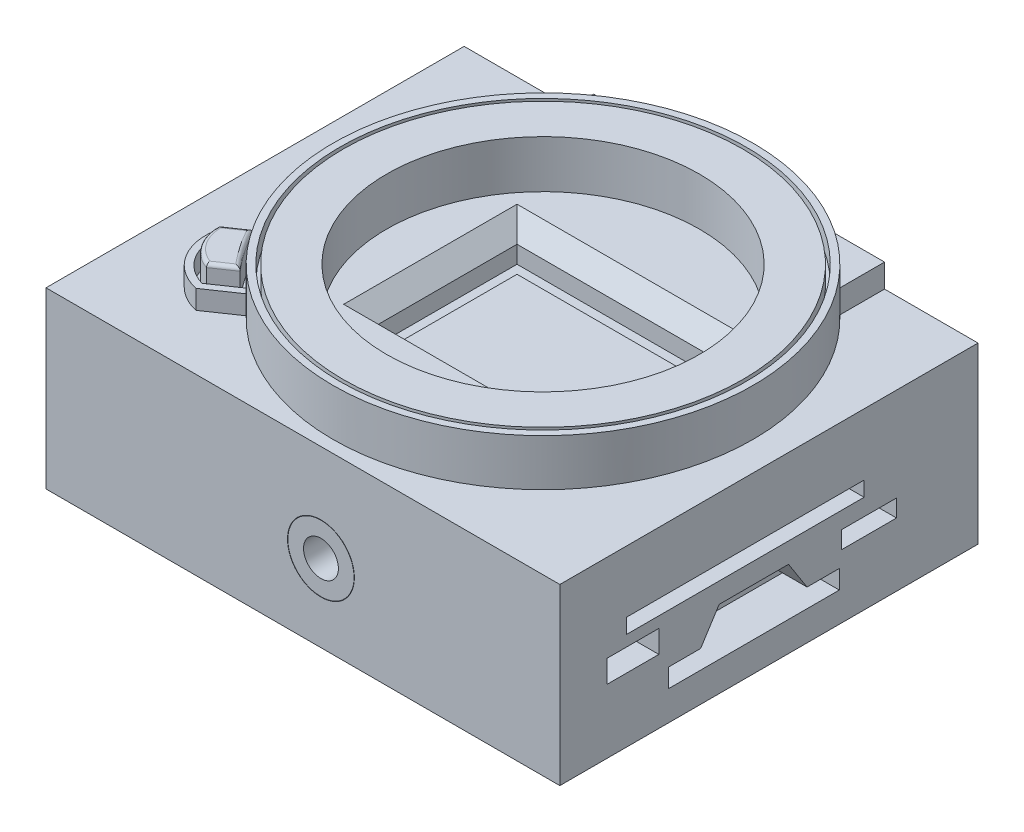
ISO-10303-21;
HEADER;
FILE_DESCRIPTION(('STEP AP214'),'2;1');
FILE_NAME('part.step','',(''),(''),'','','');
FILE_SCHEMA(('AUTOMOTIVE_DESIGN { 1 0 10303 214 1 1 1 1 }'));
ENDSEC;
DATA;
#1=APPLICATION_CONTEXT('core data for automotive mechanical design processes');
#2=APPLICATION_PROTOCOL_DEFINITION('international standard','automotive_design',2000,#1);
#3=PRODUCT_CONTEXT('',#1,'mechanical');
#4=PRODUCT('Part','Part','',(#3));
#5=PRODUCT_RELATED_PRODUCT_CATEGORY('part','',(#4));
#6=PRODUCT_DEFINITION_FORMATION('','',#4);
#7=PRODUCT_DEFINITION_CONTEXT('part definition',#1,'design');
#8=PRODUCT_DEFINITION('design','',#6,#7);
#9=PRODUCT_DEFINITION_SHAPE('','',#8);
#10=(LENGTH_UNIT() NAMED_UNIT(*) SI_UNIT(.MILLI.,.METRE.));
#11=(NAMED_UNIT(*) PLANE_ANGLE_UNIT() SI_UNIT($,.RADIAN.));
#12=(NAMED_UNIT(*) SI_UNIT($,.STERADIAN.) SOLID_ANGLE_UNIT());
#13=UNCERTAINTY_MEASURE_WITH_UNIT(LENGTH_MEASURE(1.E-05),#10,'distance_accuracy_value','');
#14=(GEOMETRIC_REPRESENTATION_CONTEXT(3) GLOBAL_UNCERTAINTY_ASSIGNED_CONTEXT((#13)) GLOBAL_UNIT_ASSIGNED_CONTEXT((#10,
#11,#12)) REPRESENTATION_CONTEXT('',''));
#15=CARTESIAN_POINT('',(0.,0.,0.));
#16=DIRECTION('',(0.,0.,1.));
#17=DIRECTION('',(1.,0.,0.));
#18=AXIS2_PLACEMENT_3D('',#15,#16,#17);
#19=CARTESIAN_POINT('',(0.,25.527,0.));
#20=DIRECTION('',(0.,0.,-1.));
#21=DIRECTION('',(-1.,0.,0.));
#22=AXIS2_PLACEMENT_3D('',#19,#20,#21);
#23=PLANE('',#22);
#24=CARTESIAN_POINT('',(40.2844,11.3284,0.));
#25=DIRECTION('',(0.,0.,1.));
#26=DIRECTION('',(1.,0.,0.));
#27=AXIS2_PLACEMENT_3D('',#24,#25,#26);
#28=CIRCLE('',#27,4.8514);
#29=CARTESIAN_POINT('',(45.1358,11.3284,0.));
#30=VERTEX_POINT('',#29);
#31=EDGE_CURVE('E642',#30,#30,#28,.T.);
#32=ORIENTED_EDGE('',*,*,#31,.T.);
#33=EDGE_LOOP('',(#32));
#34=FACE_BOUND('',#33,.T.);
#35=CARTESIAN_POINT('',(40.2844,11.3284,0.));
#36=DIRECTION('',(0.,0.,1.));
#37=DIRECTION('',(1.,0.,0.));
#38=AXIS2_PLACEMENT_3D('',#35,#36,#37);
#39=CIRCLE('',#38,2.55269999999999);
#40=CARTESIAN_POINT('',(42.8371,11.3284,0.));
#41=VERTEX_POINT('',#40);
#42=EDGE_CURVE('E628',#41,#41,#39,.T.);
#43=ORIENTED_EDGE('',*,*,#42,.F.);
#44=EDGE_LOOP('',(#43));
#45=FACE_BOUND('',#44,.T.);
#46=ADVANCED_FACE('F45',(#34,#45),#23,.F.);
#47=CARTESIAN_POINT('',(40.2844,32.385,-32.5374));
#48=DIRECTION('',(0.,-1.,0.));
#49=DIRECTION('',(0.,0.,-1.));
#50=AXIS2_PLACEMENT_3D('',#47,#48,#49);
#51=CYLINDRICAL_SURFACE('',#50,30.7594);
#52=DIRECTION('',(0.,-1.,0.));
#53=VECTOR('',#52,1.);
#54=CARTESIAN_POINT('',(13.0566518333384,30.3784,-18.2268997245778));
#55=LINE('',#54,#53);
#56=CARTESIAN_POINT('',(13.0566518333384,26.3144,-18.2268997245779));
#57=VERTEX_POINT('',#56);
#58=CARTESIAN_POINT('',(13.0566518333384,25.527,-18.2268997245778));
#59=VERTEX_POINT('',#58);
#60=EDGE_CURVE('E966',#57,#59,#55,.T.);
#61=ORIENTED_EDGE('',*,*,#60,.F.);
#62=CARTESIAN_POINT('',(40.2844,26.3144,-32.5374));
#63=DIRECTION('',(0.,-1.,0.));
#64=DIRECTION('',(0.,0.,1.));
#65=AXIS2_PLACEMENT_3D('',#62,#63,#64);
#66=CIRCLE('',#65,30.7594);
#67=CARTESIAN_POINT('',(17.0566551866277,26.3144,-12.372763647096));
#68=VERTEX_POINT('',#67);
#69=EDGE_CURVE('E921',#68,#57,#66,.T.);
#70=ORIENTED_EDGE('',*,*,#69,.F.);
#71=DIRECTION('',(0.,-1.,0.));
#72=VECTOR('',#71,1.);
#73=CARTESIAN_POINT('',(17.0566551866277,30.3784,-12.372763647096));
#74=LINE('',#73,#72);
#75=CARTESIAN_POINT('',(17.0566551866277,25.527,-12.372763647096));
#76=VERTEX_POINT('',#75);
#77=EDGE_CURVE('E957',#68,#76,#74,.T.);
#78=ORIENTED_EDGE('',*,*,#77,.T.);
#79=CARTESIAN_POINT('',(40.2844,25.527,-32.5374));
#80=DIRECTION('',(0.,-1.,0.));
#81=DIRECTION('',(0.,0.,-1.));
#82=AXIS2_PLACEMENT_3D('',#79,#80,#81);
#83=CIRCLE('',#82,30.7594);
#84=CARTESIAN_POINT('',(17.5253542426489,25.527,-11.8452148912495));
#85=VERTEX_POINT('',#84);
#86=EDGE_CURVE('E985',#85,#76,#83,.T.);
#87=ORIENTED_EDGE('',*,*,#86,.F.);
#88=DIRECTION('',(0.,1.,0.));
#89=VECTOR('',#88,1.);
#90=CARTESIAN_POINT('',(17.5253542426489,12.5428905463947,-11.8452148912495));
#91=LINE('',#90,#89);
#92=CARTESIAN_POINT('',(17.5253542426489,28.321,-11.8452148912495));
#93=VERTEX_POINT('',#92);
#94=EDGE_CURVE('E995',#85,#93,#91,.T.);
#95=ORIENTED_EDGE('',*,*,#94,.T.);
#96=CARTESIAN_POINT('',(40.2844,28.321,-32.5374));
#97=DIRECTION('',(0.,-1.,0.));
#98=DIRECTION('',(0.,0.,1.));
#99=AXIS2_PLACEMENT_3D('',#96,#97,#98);
#100=CIRCLE('',#99,30.7594);
#101=CARTESIAN_POINT('',(18.2184461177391,28.321,-11.1076457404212));
#102=VERTEX_POINT('',#101);
#103=EDGE_CURVE('E1011',#102,#93,#100,.T.);
#104=ORIENTED_EDGE('',*,*,#103,.F.);
#105=DIRECTION('',(0.,-1.,0.));
#106=VECTOR('',#105,1.);
#107=CARTESIAN_POINT('',(18.2184461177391,28.321,-11.1076457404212));
#108=LINE('',#107,#106);
#109=CARTESIAN_POINT('',(18.2184461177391,25.527,-11.1076457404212));
#110=VERTEX_POINT('',#109);
#111=EDGE_CURVE('E1026',#102,#110,#108,.T.);
#112=ORIENTED_EDGE('',*,*,#111,.T.);
#113=CARTESIAN_POINT('',(40.2844,25.527,-32.5374));
#114=DIRECTION('',(0.,1.,0.));
#115=DIRECTION('',(0.,0.,1.));
#116=AXIS2_PLACEMENT_3D('',#113,#114,#115);
#117=CIRCLE('',#116,30.7594);
#118=CARTESIAN_POINT('',(61.595,25.527,-54.7184508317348));
#119=VERTEX_POINT('',#118);
#120=EDGE_CURVE('E1344',#110,#119,#117,.T.);
#121=ORIENTED_EDGE('',*,*,#120,.T.);
#122=DIRECTION('',(0.,-1.,0.));
#123=VECTOR('',#122,1.);
#124=CARTESIAN_POINT('',(61.595,28.956,-54.7184508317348));
#125=LINE('',#124,#123);
#126=CARTESIAN_POINT('',(61.595,28.956,-54.7184508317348));
#127=VERTEX_POINT('',#126);
#128=EDGE_CURVE('E1153',#127,#119,#125,.T.);
#129=ORIENTED_EDGE('',*,*,#128,.F.);
#130=CARTESIAN_POINT('',(40.2844,28.956,-32.5374));
#131=DIRECTION('',(0.,1.,0.));
#132=DIRECTION('',(0.,0.,1.));
#133=AXIS2_PLACEMENT_3D('',#130,#131,#132);
#134=CIRCLE('',#133,30.7594);
#135=CARTESIAN_POINT('',(51.2788157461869,28.956,-61.2648));
#136=VERTEX_POINT('',#135);
#137=EDGE_CURVE('E1176',#127,#136,#134,.T.);
#138=ORIENTED_EDGE('',*,*,#137,.T.);
#139=DIRECTION('',(0.,1.,0.));
#140=VECTOR('',#139,1.);
#141=CARTESIAN_POINT('',(51.2788157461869,17.907,-61.2648));
#142=LINE('',#141,#140);
#143=CARTESIAN_POINT('',(51.2788157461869,22.7209832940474,-61.2648));
#144=VERTEX_POINT('',#143);
#145=EDGE_CURVE('E1564',#144,#136,#142,.T.);
#146=ORIENTED_EDGE('',*,*,#145,.F.);
#147=CARTESIAN_POINT('',(40.2844,22.7209832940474,-32.5374));
#148=DIRECTION('',(0.,-1.,0.));
#149=DIRECTION('',(0.,0.,-1.));
#150=AXIS2_PLACEMENT_3D('',#147,#148,#149);
#151=CIRCLE('',#150,30.7594);
#152=CARTESIAN_POINT('',(51.2054966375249,22.7209832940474,-61.2927531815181));
#153=VERTEX_POINT('',#152);
#154=EDGE_CURVE('E1120',#153,#144,#151,.T.);
#155=ORIENTED_EDGE('',*,*,#154,.F.);
#156=CARTESIAN_POINT('',(49.4436273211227,17.907,-61.9014808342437));
#157=CARTESIAN_POINT('',(49.6101061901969,18.157684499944,-61.8495429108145));
#158=CARTESIAN_POINT('',(49.766428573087,18.4154921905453,-61.7992380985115));
#159=CARTESIAN_POINT('',(50.0578053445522,18.9439201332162,-61.7032181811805));
#160=CARTESIAN_POINT('',(50.1928442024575,19.2145495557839,-61.6575064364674));
#161=CARTESIAN_POINT('',(50.4379434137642,19.7612187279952,-61.5729417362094));
#162=CARTESIAN_POINT('',(50.5484547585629,20.0370374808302,-61.533968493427));
#163=CARTESIAN_POINT('',(50.7469520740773,20.5973575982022,-61.4629388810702));
#164=CARTESIAN_POINT('',(50.8349518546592,20.881853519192,-61.4308782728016));
#165=CARTESIAN_POINT('',(50.978420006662,21.4227429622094,-61.3780623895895));
#166=CARTESIAN_POINT('',(51.036542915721,21.6783472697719,-61.3564064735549));
#167=CARTESIAN_POINT('',(51.1348993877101,22.1958375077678,-61.3195097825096));
#168=CARTESIAN_POINT('',(51.174966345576,22.4577593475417,-61.3043288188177));
#169=CARTESIAN_POINT('',(51.2054966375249,22.7209832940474,-61.2927531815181));
#170=B_SPLINE_CURVE_WITH_KNOTS('',3,(#156,#157,#158,#159,#160,#161,#162,#163,#164,#165,#166,
#167,#168,#169),.UNSPECIFIED.,.F.,.F.,(4,2,2,2,2,2,4),(0.,0.915931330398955,1.83252795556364,
2.7305376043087,3.62799503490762,4.41632709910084,5.21179132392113),.UNSPECIFIED.);
#171=CARTESIAN_POINT('',(49.4436273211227,17.907,-61.9014808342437));
#172=VERTEX_POINT('',#171);
#173=EDGE_CURVE('E1113',#172,#153,#170,.T.);
#174=ORIENTED_EDGE('',*,*,#173,.F.);
#175=CARTESIAN_POINT('',(31.1251726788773,17.907,-61.9014808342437));
#176=CARTESIAN_POINT('',(31.1074823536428,18.1566784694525,-61.8959375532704));
#177=CARTESIAN_POINT('',(31.1000634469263,18.4071485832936,-61.8936303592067));
#178=CARTESIAN_POINT('',(31.1056868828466,18.9077958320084,-61.8954026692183));
#179=CARTESIAN_POINT('',(31.1187258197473,19.1579730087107,-61.8994811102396));
#180=CARTESIAN_POINT('',(31.1651206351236,19.6556322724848,-61.9139197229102));
#181=CARTESIAN_POINT('',(31.1984266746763,19.903119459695,-61.9242644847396));
#182=CARTESIAN_POINT('',(31.2850010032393,20.3942500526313,-61.9508931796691));
#183=CARTESIAN_POINT('',(31.3382694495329,20.6378934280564,-61.9671771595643));
#184=CARTESIAN_POINT('',(31.4642873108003,21.1195645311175,-62.005189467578));
#185=CARTESIAN_POINT('',(31.5370304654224,21.3575940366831,-62.0269160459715));
#186=CARTESIAN_POINT('',(31.7014348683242,21.8266180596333,-62.0751848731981));
#187=CARTESIAN_POINT('',(31.7931031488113,22.0576099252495,-62.1017289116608));
#188=CARTESIAN_POINT('',(31.9946441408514,22.5110200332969,-62.1588719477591));
#189=CARTESIAN_POINT('',(32.1045192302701,22.7334371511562,-62.1894714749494));
#190=CARTESIAN_POINT('',(32.341674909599,23.1683130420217,-62.2538751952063));
#191=CARTESIAN_POINT('',(32.4689564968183,23.3807712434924,-62.2876795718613));
#192=CARTESIAN_POINT('',(32.7434387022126,23.7996123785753,-62.3584524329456));
#193=CARTESIAN_POINT('',(32.8910564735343,24.0057122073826,-62.395478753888));
#194=CARTESIAN_POINT('',(33.2026791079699,24.4048537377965,-62.4709198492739));
#195=CARTESIAN_POINT('',(33.3666841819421,24.5978952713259,-62.509334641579));
#196=CARTESIAN_POINT('',(33.710079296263,24.9697867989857,-62.586525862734));
#197=CARTESIAN_POINT('',(33.8894732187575,25.1486331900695,-62.6253023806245));
#198=CARTESIAN_POINT('',(34.2624955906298,25.49096063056,-62.7021743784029));
#199=CARTESIAN_POINT('',(34.4561238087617,25.6544419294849,-62.7402698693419));
#200=CARTESIAN_POINT('',(34.8625411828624,25.9697217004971,-62.8159095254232));
#201=CARTESIAN_POINT('',(35.0757344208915,26.121012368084,-62.8534015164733));
#202=CARTESIAN_POINT('',(35.5145055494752,26.4050079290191,-62.9255259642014));
#203=CARTESIAN_POINT('',(35.740078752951,26.5377197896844,-62.9601594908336));
#204=CARTESIAN_POINT('',(36.2021829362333,26.7836103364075,-63.0256049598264));
#205=CARTESIAN_POINT('',(36.4387144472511,26.8967880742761,-63.0564167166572));
#206=CARTESIAN_POINT('',(36.9210738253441,27.1026679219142,-63.1133331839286));
#207=CARTESIAN_POINT('',(37.1669014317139,27.1953706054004,-63.1394380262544));
#208=CARTESIAN_POINT('',(37.6612898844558,27.3579188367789,-63.1857349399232));
#209=CARTESIAN_POINT('',(37.909708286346,27.4281680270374,-63.2060306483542));
#210=CARTESIAN_POINT('',(38.4119701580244,27.5475634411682,-63.2407883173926));
#211=CARTESIAN_POINT('',(38.665813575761,27.5967098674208,-63.2552503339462));
#212=CARTESIAN_POINT('',(39.1769676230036,27.6734352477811,-63.2779223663));
#213=CARTESIAN_POINT('',(39.4342775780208,27.7010183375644,-63.2861335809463));
#214=CARTESIAN_POINT('',(39.9504297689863,27.7343677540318,-63.2960698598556));
#215=CARTESIAN_POINT('',(40.209271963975,27.7401346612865,-63.297795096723));
#216=CARTESIAN_POINT('',(40.7170310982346,27.7299875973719,-63.294766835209));
#217=CARTESIAN_POINT('',(40.9659654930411,27.7148572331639,-63.2902474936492));
#218=CARTESIAN_POINT('',(41.461596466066,27.664431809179,-63.275265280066));
#219=CARTESIAN_POINT('',(41.7082931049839,27.6291372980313,-63.2648025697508));
#220=CARTESIAN_POINT('',(42.1976967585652,27.5386957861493,-63.238215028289));
#221=CARTESIAN_POINT('',(42.4404039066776,27.4835494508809,-63.2220903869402));
#222=CARTESIAN_POINT('',(42.9201678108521,27.353872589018,-63.1846073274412));
#223=CARTESIAN_POINT('',(43.1572244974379,27.2793418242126,-63.1632488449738));
#224=CARTESIAN_POINT('',(43.6242298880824,27.1114576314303,-63.1158457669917));
#225=CARTESIAN_POINT('',(43.8541747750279,27.0180942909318,-63.0897987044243));
#226=CARTESIAN_POINT('',(44.3054345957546,26.8132510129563,-63.0336897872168));
#227=CARTESIAN_POINT('',(44.526746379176,26.7017645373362,-63.0036264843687));
#228=CARTESIAN_POINT('',(44.9592928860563,26.4615037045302,-62.9402592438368));
#229=CARTESIAN_POINT('',(45.1705274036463,26.332728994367,-62.9069552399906));
#230=CARTESIAN_POINT('',(45.5816639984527,26.0587644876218,-62.8379468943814));
#231=CARTESIAN_POINT('',(45.7815654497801,25.9135737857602,-62.8022424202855));
#232=CARTESIAN_POINT('',(46.1759526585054,25.6021103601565,-62.7279949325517));
#233=CARTESIAN_POINT('',(46.3699723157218,25.4352604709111,-62.6893958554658));
#234=CARTESIAN_POINT('',(46.7433595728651,25.0860208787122,-62.6116232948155));
#235=CARTESIAN_POINT('',(46.9227268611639,24.9036308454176,-62.5724497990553));
#236=CARTESIAN_POINT('',(47.2656939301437,24.5244448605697,-62.4945887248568));
#237=CARTESIAN_POINT('',(47.4292918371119,24.3276472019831,-62.4559012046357));
#238=CARTESIAN_POINT('',(47.7396198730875,23.9208990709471,-62.3800859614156));
#239=CARTESIAN_POINT('',(47.8863504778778,23.7109489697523,-62.3429581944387));
#240=CARTESIAN_POINT('',(48.1647998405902,23.2747204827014,-62.2705652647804));
#241=CARTESIAN_POINT('',(48.2961441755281,23.0481937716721,-62.2353546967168));
#242=CARTESIAN_POINT('',(48.5391569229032,22.5843971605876,-62.168727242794));
#243=CARTESIAN_POINT('',(48.6508330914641,22.3471315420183,-62.1373088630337));
#244=CARTESIAN_POINT('',(48.8536304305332,21.8634755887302,-62.0792365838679));
#245=CARTESIAN_POINT('',(48.9447567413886,21.6170875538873,-62.052581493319));
#246=CARTESIAN_POINT('',(49.1056776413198,21.1169280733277,-62.0048872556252));
#247=CARTESIAN_POINT('',(49.1754749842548,20.8631575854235,-61.9838473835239));
#248=CARTESIAN_POINT('',(49.2847846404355,20.3863983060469,-61.9506035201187));
#249=CARTESIAN_POINT('',(49.3271819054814,20.1641237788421,-61.9375713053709));
#250=CARTESIAN_POINT('',(49.3954688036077,19.7168364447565,-61.916480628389));
#251=CARTESIAN_POINT('',(49.4213604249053,19.4918239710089,-61.9084215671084));
#252=CARTESIAN_POINT('',(49.4564590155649,19.0401261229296,-61.8974822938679));
#253=CARTESIAN_POINT('',(49.4656474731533,18.8134391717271,-61.8946078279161));
#254=CARTESIAN_POINT('',(49.4672410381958,18.3599517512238,-61.8941002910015));
#255=CARTESIAN_POINT('',(49.4596424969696,18.1331512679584,-61.8964683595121));
#256=CARTESIAN_POINT('',(49.4436273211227,17.907,-61.9014808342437));
#257=B_SPLINE_CURVE_WITH_KNOTS('',3,(#175,#176,#177,#178,#179,#180,#181,#182,#183,#184,#185,
#186,#187,#188,#189,#190,#191,#192,#193,#194,#195,#196,#197,#198,#199,#200,#201,#202,#203,#204,
#205,#206,#207,#208,#209,#210,#211,#212,#213,#214,#215,#216,#217,#218,#219,#220,#221,#222,#223,
#224,#225,#226,#227,#228,#229,#230,#231,#232,#233,#234,#235,#236,#237,#238,#239,#240,#241,#242,
#243,#244,#245,#246,#247,#248,#249,#250,#251,#252,#253,#254,#255,#256),.UNSPECIFIED.,.F.,.F.,(4,
2,2,2,2,2,2,2,2,2,2,2,2,2,2,2,2,2,2,2,2,2,2,2,2,2,2,2,2,2,2,2,2,2,2,2,2,2,2,2,4),(0.,
0.750856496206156,1.50158800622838,2.25048080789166,2.99937951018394,3.7480377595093,
4.49697469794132,5.24600952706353,5.99508729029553,6.76282178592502,7.53056616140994,
8.29850478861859,9.06643094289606,9.85775755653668,10.6487866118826,11.4398540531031,
12.2308993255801,13.0067991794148,13.7826915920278,14.558435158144,15.3341580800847,
16.0815693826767,16.8289603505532,17.5763262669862,18.3237013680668,19.0714708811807,
19.8195107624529,20.5675659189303,21.3156623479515,22.0911430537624,22.8666402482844,
23.642229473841,24.4177968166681,25.2094480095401,26.0007863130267,26.7919264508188,
27.5829643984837,28.2622863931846,28.9415265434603,29.6215190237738,30.3016593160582),.UNSPECIFIED.);
#258=CARTESIAN_POINT('',(31.1251726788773,17.907,-61.9014808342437));
#259=VERTEX_POINT('',#258);
#260=EDGE_CURVE('E1202',#259,#172,#257,.T.);
#261=ORIENTED_EDGE('',*,*,#260,.F.);
#262=CARTESIAN_POINT('',(29.3633033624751,22.7209832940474,-61.2927531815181));
#263=CARTESIAN_POINT('',(29.3984420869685,22.4178772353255,-61.3060642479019));
#264=CARTESIAN_POINT('',(29.4462524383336,22.1164906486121,-61.3241825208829));
#265=CARTESIAN_POINT('',(29.566542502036,21.5193344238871,-61.3692030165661));
#266=CARTESIAN_POINT('',(29.6390228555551,21.2235649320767,-61.3961054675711));
#267=CARTESIAN_POINT('',(29.8063153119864,20.6455783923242,-61.4572556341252));
#268=CARTESIAN_POINT('',(29.9006600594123,20.3632092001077,-61.4913484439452));
#269=CARTESIAN_POINT('',(30.1115327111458,19.8079077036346,-61.5661097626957));
#270=CARTESIAN_POINT('',(30.2280518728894,19.5349717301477,-61.606775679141));
#271=CARTESIAN_POINT('',(30.4669291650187,19.0325678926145,-61.6882470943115));
#272=CARTESIAN_POINT('',(30.5868652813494,18.8018427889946,-61.7284375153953));
#273=CARTESIAN_POINT('',(30.843609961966,18.347906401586,-61.8124832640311));
#274=CARTESIAN_POINT('',(30.9805582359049,18.1247795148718,-61.8563678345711));
#275=CARTESIAN_POINT('',(31.1251726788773,17.907,-61.9014808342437));
#276=B_SPLINE_CURVE_WITH_KNOTS('',3,(#262,#263,#264,#265,#266,#267,#268,#269,#270,#271,#272,
#273,#274,#275),.UNSPECIFIED.,.F.,.F.,(4,2,2,2,2,2,4),(0.,0.9159229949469,1.83186979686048,
2.72979822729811,3.62737336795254,4.41609053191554,5.21177619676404),.UNSPECIFIED.);
#277=CARTESIAN_POINT('',(29.3633033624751,22.7209832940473,-61.2927531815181));
#278=VERTEX_POINT('',#277);
#279=EDGE_CURVE('E1074',#278,#259,#276,.T.);
#280=ORIENTED_EDGE('',*,*,#279,.F.);
#281=CARTESIAN_POINT('',(40.2844,22.7209832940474,-32.5374));
#282=DIRECTION('',(0.,-1.,0.));
#283=DIRECTION('',(0.,0.,-1.));
#284=AXIS2_PLACEMENT_3D('',#281,#282,#283);
#285=CIRCLE('',#284,30.7594);
#286=CARTESIAN_POINT('',(29.2899842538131,22.7209832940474,-61.2648));
#287=VERTEX_POINT('',#286);
#288=EDGE_CURVE('E1082',#287,#278,#285,.T.);
#289=ORIENTED_EDGE('',*,*,#288,.F.);
#290=DIRECTION('',(0.,1.,0.));
#291=VECTOR('',#290,1.);
#292=CARTESIAN_POINT('',(29.2899842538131,17.907,-61.2648));
#293=LINE('',#292,#291);
#294=CARTESIAN_POINT('',(29.2899842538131,28.956,-61.2648));
#295=VERTEX_POINT('',#294);
#296=EDGE_CURVE('E1210',#287,#295,#293,.T.);
#297=ORIENTED_EDGE('',*,*,#296,.T.);
#298=CARTESIAN_POINT('',(18.9738,28.956,-54.7184508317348));
#299=VERTEX_POINT('',#298);
#300=EDGE_CURVE('E1173',#295,#299,#134,.T.);
#301=ORIENTED_EDGE('',*,*,#300,.T.);
#302=DIRECTION('',(0.,-1.,0.));
#303=VECTOR('',#302,1.);
#304=CARTESIAN_POINT('',(18.9738,28.956,-54.7184508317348));
#305=LINE('',#304,#303);
#306=CARTESIAN_POINT('',(18.9738,25.527,-54.7184508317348));
#307=VERTEX_POINT('',#306);
#308=EDGE_CURVE('E1157',#299,#307,#305,.T.);
#309=ORIENTED_EDGE('',*,*,#308,.T.);
#310=CARTESIAN_POINT('',(12.3003006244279,25.527,-19.7690457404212));
#311=VERTEX_POINT('',#310);
#312=EDGE_CURVE('E1350',#307,#311,#117,.T.);
#313=ORIENTED_EDGE('',*,*,#312,.T.);
#314=DIRECTION('',(0.,-1.,0.));
#315=VECTOR('',#314,1.);
#316=CARTESIAN_POINT('',(12.3003006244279,28.321,-19.7690457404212));
#317=LINE('',#316,#315);
#318=CARTESIAN_POINT('',(12.3003006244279,28.321,-19.7690457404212));
#319=VERTEX_POINT('',#318);
#320=EDGE_CURVE('E1049',#319,#311,#317,.T.);
#321=ORIENTED_EDGE('',*,*,#320,.F.);
#322=CARTESIAN_POINT('',(12.7355276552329,28.321,-18.8552831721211));
#323=VERTEX_POINT('',#322);
#324=EDGE_CURVE('E1016',#323,#319,#100,.T.);
#325=ORIENTED_EDGE('',*,*,#324,.F.);
#326=DIRECTION('',(0.,1.,0.));
#327=VECTOR('',#326,1.);
#328=CARTESIAN_POINT('',(12.7355276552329,12.5428905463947,-18.8552831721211));
#329=LINE('',#328,#327);
#330=CARTESIAN_POINT('',(12.7355276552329,25.527,-18.8552831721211));
#331=VERTEX_POINT('',#330);
#332=EDGE_CURVE('E989',#331,#323,#329,.T.);
#333=ORIENTED_EDGE('',*,*,#332,.F.);
#334=EDGE_CURVE('E990',#59,#331,#83,.T.);
#335=ORIENTED_EDGE('',*,*,#334,.F.);
#336=EDGE_LOOP('',(#61,#70,#78,#87,#95,#104,#112,#121,#129,#138,#146,#155,#174,#261,#280,#289,
#297,#301,#309,#313,#321,#325,#333,#335));
#337=FACE_BOUND('',#336,.T.);
#338=CARTESIAN_POINT('',(40.2844,32.385,-32.5374));
#339=DIRECTION('',(0.,1.,0.));
#340=DIRECTION('',(0.,0.,1.));
#341=AXIS2_PLACEMENT_3D('',#338,#339,#340);
#342=CIRCLE('',#341,30.7594);
#343=CARTESIAN_POINT('',(40.2844,32.385,-1.77799999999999));
#344=VERTEX_POINT('',#343);
#345=EDGE_CURVE('E1523',#344,#344,#342,.T.);
#346=ORIENTED_EDGE('',*,*,#345,.F.);
#347=EDGE_LOOP('',(#346));
#348=FACE_BOUND('',#347,.T.);
#349=ADVANCED_FACE('F1084',(#337,#348),#51,.T.);
#350=CARTESIAN_POINT('',(0.,25.527,0.));
#351=DIRECTION('',(0.,-1.,0.));
#352=DIRECTION('',(0.,0.,-1.));
#353=AXIS2_PLACEMENT_3D('',#350,#351,#352);
#354=PLANE('',#353);
#355=DIRECTION('',(-0.825665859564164,0.,0.564159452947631));
#356=VECTOR('',#355,1.);
#357=CARTESIAN_POINT('',(13.0566518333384,25.527,-18.2268997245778));
#358=LINE('',#357,#356);
#359=CARTESIAN_POINT('',(9.54480534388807,25.527,-15.8273317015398));
#360=VERTEX_POINT('',#359);
#361=EDGE_CURVE('E942',#59,#360,#358,.T.);
#362=ORIENTED_EDGE('',*,*,#361,.F.);
#363=ORIENTED_EDGE('',*,*,#334,.T.);
#364=DIRECTION('',(-0.825665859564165,0.,0.56415945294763));
#365=VECTOR('',#364,1.);
#366=CARTESIAN_POINT('',(11.9021392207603,25.527,-18.2858470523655));
#367=LINE('',#366,#365);
#368=CARTESIAN_POINT('',(8.87162959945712,25.527,-16.2151660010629));
#369=VERTEX_POINT('',#368);
#370=EDGE_CURVE('E973',#331,#369,#367,.T.);
#371=ORIENTED_EDGE('',*,*,#370,.T.);
#372=CARTESIAN_POINT('',(15.4305958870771,25.527,-15.5553383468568));
#373=DIRECTION('',(0.,-1.,0.));
#374=DIRECTION('',(0.,0.,-1.));
#375=AXIS2_PLACEMENT_3D('',#372,#373,#374);
#376=CIRCLE('',#375,6.59207185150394);
#377=CARTESIAN_POINT('',(13.6614561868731,25.527,-9.20509772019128));
#378=VERTEX_POINT('',#377);
#379=EDGE_CURVE('E997',#369,#378,#376,.F.);
#380=ORIENTED_EDGE('',*,*,#379,.T.);
#381=DIRECTION('',(0.825665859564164,0.,-0.564159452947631));
#382=VECTOR('',#381,1.);
#383=CARTESIAN_POINT('',(16.6919658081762,25.527,-11.2757787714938));
#384=LINE('',#383,#382);
#385=EDGE_CURVE('E991',#378,#85,#384,.T.);
#386=ORIENTED_EDGE('',*,*,#385,.T.);
#387=ORIENTED_EDGE('',*,*,#86,.T.);
#388=DIRECTION('',(0.825665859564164,0.,-0.564159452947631));
#389=VECTOR('',#388,1.);
#390=CARTESIAN_POINT('',(13.5448086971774,25.527,-9.97319562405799));
#391=LINE('',#390,#389);
#392=CARTESIAN_POINT('',(13.5448086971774,25.527,-9.97319562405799));
#393=VERTEX_POINT('',#392);
#394=EDGE_CURVE('E953',#393,#76,#391,.T.);
#395=ORIENTED_EDGE('',*,*,#394,.F.);
#396=CARTESIAN_POINT('',(15.4305958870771,25.527,-15.5553383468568));
#397=DIRECTION('',(0.,1.,0.));
#398=DIRECTION('',(0.,0.,1.));
#399=AXIS2_PLACEMENT_3D('',#396,#397,#398);
#400=CIRCLE('',#399,5.89207185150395);
#401=EDGE_CURVE('E949',#360,#393,#400,.T.);
#402=ORIENTED_EDGE('',*,*,#401,.F.);
#403=EDGE_LOOP('',(#362,#363,#371,#380,#386,#387,#395,#402));
#404=FACE_BOUND('',#403,.T.);
#405=ADVANCED_FACE('F1286',(#404),#354,.F.);
#406=CARTESIAN_POINT('',(0.,25.527,0.));
#407=DIRECTION('',(0.,-1.,0.));
#408=DIRECTION('',(0.,0.,-1.));
#409=AXIS2_PLACEMENT_3D('',#406,#407,#408);
#410=PLANE('',#409);
#411=DIRECTION('',(-0.825665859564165,0.,0.56415945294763));
#412=VECTOR('',#411,1.);
#413=CARTESIAN_POINT('',(7.93949137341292,25.527,-16.7894));
#414=LINE('',#413,#412);
#415=CARTESIAN_POINT('',(7.93949137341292,25.527,-16.7894));
#416=VERTEX_POINT('',#415);
#417=EDGE_CURVE('E1010',#311,#416,#414,.T.);
#418=ORIENTED_EDGE('',*,*,#417,.F.);
#419=ORIENTED_EDGE('',*,*,#312,.F.);
#420=DIRECTION('',(0.,0.,1.));
#421=VECTOR('',#420,1.);
#422=CARTESIAN_POINT('',(18.9738,25.527,-61.2648));
#423=LINE('',#422,#421);
#424=CARTESIAN_POINT('',(18.9738,25.527,-61.2648));
#425=VERTEX_POINT('',#424);
#426=EDGE_CURVE('E1119',#425,#307,#423,.T.);
#427=ORIENTED_EDGE('',*,*,#426,.F.);
#428=DIRECTION('',(-1.,0.,0.));
#429=VECTOR('',#428,1.);
#430=CARTESIAN_POINT('',(0.,25.527,-61.2648));
#431=LINE('',#430,#429);
#432=CARTESIAN_POINT('',(0.,25.527,-61.2648));
#433=VERTEX_POINT('',#432);
#434=EDGE_CURVE('E1541',#425,#433,#431,.T.);
#435=ORIENTED_EDGE('',*,*,#434,.T.);
#436=DIRECTION('',(0.,0.,1.));
#437=VECTOR('',#436,1.);
#438=CARTESIAN_POINT('',(0.,25.527,0.));
#439=LINE('',#438,#437);
#440=CARTESIAN_POINT('',(0.,25.527,0.));
#441=VERTEX_POINT('',#440);
#442=EDGE_CURVE('E1331',#433,#441,#439,.T.);
#443=ORIENTED_EDGE('',*,*,#442,.T.);
#444=DIRECTION('',(1.,0.,0.));
#445=VECTOR('',#444,1.);
#446=CARTESIAN_POINT('',(0.,25.527,0.));
#447=LINE('',#446,#445);
#448=CARTESIAN_POINT('',(75.2856,25.527,0.));
#449=VERTEX_POINT('',#448);
#450=EDGE_CURVE('E1536',#441,#449,#447,.T.);
#451=ORIENTED_EDGE('',*,*,#450,.T.);
#452=DIRECTION('',(0.,0.,-1.));
#453=VECTOR('',#452,1.);
#454=CARTESIAN_POINT('',(75.2856,25.527,0.));
#455=LINE('',#454,#453);
#456=CARTESIAN_POINT('',(75.2856,25.527,-61.2648));
#457=VERTEX_POINT('',#456);
#458=EDGE_CURVE('E1321',#449,#457,#455,.T.);
#459=ORIENTED_EDGE('',*,*,#458,.T.);
#460=CARTESIAN_POINT('',(61.595,25.527,-61.2648));
#461=VERTEX_POINT('',#460);
#462=EDGE_CURVE('E1339',#457,#461,#431,.T.);
#463=ORIENTED_EDGE('',*,*,#462,.T.);
#464=DIRECTION('',(0.,0.,-1.));
#465=VECTOR('',#464,1.);
#466=CARTESIAN_POINT('',(61.595,25.527,-61.2648));
#467=LINE('',#466,#465);
#468=EDGE_CURVE('E1138',#119,#461,#467,.T.);
#469=ORIENTED_EDGE('',*,*,#468,.F.);
#470=ORIENTED_EDGE('',*,*,#120,.F.);
#471=DIRECTION('',(0.825665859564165,0.,-0.56415945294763));
#472=VECTOR('',#471,1.);
#473=CARTESIAN_POINT('',(18.2184461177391,25.527,-11.1076457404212));
#474=LINE('',#473,#472);
#475=CARTESIAN_POINT('',(13.8576368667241,25.527,-8.128));
#476=VERTEX_POINT('',#475);
#477=EDGE_CURVE('E1034',#476,#110,#474,.T.);
#478=ORIENTED_EDGE('',*,*,#477,.F.);
#479=CARTESIAN_POINT('',(15.4305958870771,25.527,-15.5553383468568));
#480=DIRECTION('',(0.,1.,0.));
#481=DIRECTION('',(0.,0.,1.));
#482=AXIS2_PLACEMENT_3D('',#479,#480,#481);
#483=CIRCLE('',#482,7.59207185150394);
#484=EDGE_CURVE('E1030',#416,#476,#483,.T.);
#485=ORIENTED_EDGE('',*,*,#484,.F.);
#486=EDGE_LOOP('',(#418,#419,#427,#435,#443,#451,#459,#463,#469,#470,#478,#485));
#487=FACE_BOUND('',#486,.T.);
#488=ADVANCED_FACE('F1218',(#487),#410,.F.);
#489=CARTESIAN_POINT('',(40.2844,18.5547,-63.2968));
#490=DIRECTION('',(0.,0.,1.));
#491=DIRECTION('',(1.,0.,0.));
#492=AXIS2_PLACEMENT_3D('',#489,#490,#491);
#493=CYLINDRICAL_SURFACE('',#492,9.1821);
#494=ORIENTED_EDGE('',*,*,#260,.T.);
#495=DIRECTION('',(0.,0.,1.));
#496=VECTOR('',#495,1.);
#497=CARTESIAN_POINT('',(49.4436273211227,17.907,-63.2968));
#498=LINE('',#497,#496);
#499=CARTESIAN_POINT('',(49.4436273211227,17.907,-61.2648));
#500=VERTEX_POINT('',#499);
#501=EDGE_CURVE('E1349',#500,#172,#498,.F.);
#502=ORIENTED_EDGE('',*,*,#501,.F.);
#503=CARTESIAN_POINT('',(40.2844,18.5547,-61.2648));
#504=DIRECTION('',(0.,0.,1.));
#505=DIRECTION('',(1.,0.,0.));
#506=AXIS2_PLACEMENT_3D('',#503,#504,#505);
#507=CIRCLE('',#506,9.1821);
#508=CARTESIAN_POINT('',(31.1251726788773,17.907,-61.2648));
#509=VERTEX_POINT('',#508);
#510=EDGE_CURVE('E1201',#500,#509,#507,.F.);
#511=ORIENTED_EDGE('',*,*,#510,.T.);
#512=DIRECTION('',(0.,0.,1.));
#513=VECTOR('',#512,1.);
#514=CARTESIAN_POINT('',(31.1251726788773,17.907,-63.2968));
#515=LINE('',#514,#513);
#516=EDGE_CURVE('E1345',#259,#509,#515,.T.);
#517=ORIENTED_EDGE('',*,*,#516,.F.);
#518=EDGE_LOOP('',(#494,#502,#511,#517));
#519=FACE_BOUND('',#518,.T.);
#520=CARTESIAN_POINT('',(40.2844,18.5547,-61.2648));
#521=DIRECTION('',(0.,0.,1.));
#522=DIRECTION('',(1.,0.,0.));
#523=AXIS2_PLACEMENT_3D('',#520,#521,#522);
#524=CIRCLE('',#523,9.1821);
#525=CARTESIAN_POINT('',(46.2591797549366,25.527,-61.2648));
#526=VERTEX_POINT('',#525);
#527=CARTESIAN_POINT('',(34.3096202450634,25.527,-61.2648));
#528=VERTEX_POINT('',#527);
#529=EDGE_CURVE('E1170',#526,#528,#524,.T.);
#530=ORIENTED_EDGE('',*,*,#529,.T.);
#531=DIRECTION('',(0.,0.,1.));
#532=VECTOR('',#531,1.);
#533=CARTESIAN_POINT('',(34.3096202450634,25.527,-63.2968));
#534=LINE('',#533,#532);
#535=CARTESIAN_POINT('',(34.3096202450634,25.527,-60.6298));
#536=VERTEX_POINT('',#535);
#537=EDGE_CURVE('E1167',#528,#536,#534,.T.);
#538=ORIENTED_EDGE('',*,*,#537,.T.);
#539=CARTESIAN_POINT('',(40.2844,18.5547,-60.6298));
#540=DIRECTION('',(0.,0.,-1.));
#541=DIRECTION('',(-1.,0.,0.));
#542=AXIS2_PLACEMENT_3D('',#539,#540,#541);
#543=CIRCLE('',#542,9.1821);
#544=CARTESIAN_POINT('',(46.2591797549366,25.527,-60.6298));
#545=VERTEX_POINT('',#544);
#546=EDGE_CURVE('E1197',#545,#536,#543,.T.);
#547=ORIENTED_EDGE('',*,*,#546,.F.);
#548=DIRECTION('',(0.,0.,1.));
#549=VECTOR('',#548,1.);
#550=CARTESIAN_POINT('',(46.2591797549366,25.527,-63.2968));
#551=LINE('',#550,#549);
#552=EDGE_CURVE('E1163',#545,#526,#551,.F.);
#553=ORIENTED_EDGE('',*,*,#552,.T.);
#554=EDGE_LOOP('',(#530,#538,#547,#553));
#555=FACE_BOUND('',#554,.T.);
#556=ADVANCED_FACE('F1212',(#519,#555),#493,.F.);
#557=CARTESIAN_POINT('',(40.2844,18.5547,-60.6298));
#558=DIRECTION('',(0.,0.,-1.));
#559=DIRECTION('',(-1.,0.,0.));
#560=AXIS2_PLACEMENT_3D('',#557,#558,#559);
#561=PLANE('',#560);
#562=ORIENTED_EDGE('',*,*,#546,.T.);
#563=DIRECTION('',(1.,0.,0.));
#564=VECTOR('',#563,1.);
#565=CARTESIAN_POINT('',(40.2844,25.527,-60.6298));
#566=LINE('',#565,#564);
#567=CARTESIAN_POINT('',(35.6091437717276,25.527,-60.6298));
#568=VERTEX_POINT('',#567);
#569=EDGE_CURVE('E1164',#536,#568,#566,.T.);
#570=ORIENTED_EDGE('',*,*,#569,.T.);
#571=CARTESIAN_POINT('',(40.2844,18.5547,-60.6298));
#572=DIRECTION('',(0.,0.,-1.));
#573=DIRECTION('',(-1.,0.,0.));
#574=AXIS2_PLACEMENT_3D('',#571,#572,#573);
#575=CIRCLE('',#574,8.3947);
#576=CARTESIAN_POINT('',(44.9596562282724,25.527,-60.6298));
#577=VERTEX_POINT('',#576);
#578=EDGE_CURVE('E1190',#577,#568,#575,.T.);
#579=ORIENTED_EDGE('',*,*,#578,.F.);
#580=EDGE_CURVE('E1160',#577,#545,#566,.T.);
#581=ORIENTED_EDGE('',*,*,#580,.T.);
#582=EDGE_LOOP('',(#562,#570,#579,#581));
#583=FACE_BOUND('',#582,.T.);
#584=ADVANCED_FACE('F1217',(#583),#561,.T.);
#585=CARTESIAN_POINT('',(40.2844,18.5547,-62.0776));
#586=DIRECTION('',(0.,0.,1.));
#587=DIRECTION('',(1.,0.,0.));
#588=AXIS2_PLACEMENT_3D('',#585,#586,#587);
#589=CYLINDRICAL_SURFACE('',#588,8.3947);
#590=CARTESIAN_POINT('',(40.2844,18.5547,-61.5696));
#591=DIRECTION('',(0.,0.,-1.));
#592=DIRECTION('',(-1.,0.,0.));
#593=AXIS2_PLACEMENT_3D('',#590,#591,#592);
#594=CIRCLE('',#593,8.3947);
#595=CARTESIAN_POINT('',(31.8897,18.5547,-61.5696));
#596=VERTEX_POINT('',#595);
#597=EDGE_CURVE('E1357',#596,#596,#594,.F.);
#598=ORIENTED_EDGE('',*,*,#597,.T.);
#599=EDGE_LOOP('',(#598));
#600=FACE_BOUND('',#599,.T.);
#601=DIRECTION('',(0.,0.,1.));
#602=VECTOR('',#601,1.);
#603=CARTESIAN_POINT('',(35.6091437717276,25.527,-62.0776));
#604=LINE('',#603,#602);
#605=CARTESIAN_POINT('',(35.6091437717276,25.527,-61.2648));
#606=VERTEX_POINT('',#605);
#607=EDGE_CURVE('E1369',#606,#568,#604,.T.);
#608=ORIENTED_EDGE('',*,*,#607,.F.);
#609=CARTESIAN_POINT('',(40.2844,18.5547,-61.2648));
#610=DIRECTION('',(0.,0.,1.));
#611=DIRECTION('',(1.,0.,0.));
#612=AXIS2_PLACEMENT_3D('',#609,#610,#611);
#613=CIRCLE('',#612,8.3947);
#614=CARTESIAN_POINT('',(44.9596562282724,25.527,-61.2648));
#615=VERTEX_POINT('',#614);
#616=EDGE_CURVE('E1365',#615,#606,#613,.T.);
#617=ORIENTED_EDGE('',*,*,#616,.F.);
#618=DIRECTION('',(0.,0.,1.));
#619=VECTOR('',#618,1.);
#620=CARTESIAN_POINT('',(44.9596562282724,25.527,-62.0776));
#621=LINE('',#620,#619);
#622=EDGE_CURVE('E1361',#577,#615,#621,.F.);
#623=ORIENTED_EDGE('',*,*,#622,.F.);
#624=ORIENTED_EDGE('',*,*,#578,.T.);
#625=EDGE_LOOP('',(#608,#617,#623,#624));
#626=FACE_BOUND('',#625,.T.);
#627=ADVANCED_FACE('F1654',(#600,#626),#589,.T.);
#628=CARTESIAN_POINT('',(0.,25.527,-61.2648));
#629=DIRECTION('',(0.,0.,1.));
#630=DIRECTION('',(1.,0.,0.));
#631=AXIS2_PLACEMENT_3D('',#628,#629,#630);
#632=PLANE('',#631);
#633=CARTESIAN_POINT('',(24.6634,22.733,-61.2648));
#634=DIRECTION('',(0.,0.,-1.));
#635=DIRECTION('',(-1.,0.,0.));
#636=AXIS2_PLACEMENT_3D('',#633,#634,#635);
#637=CIRCLE('',#636,3.175);
#638=CARTESIAN_POINT('',(21.4884,22.733,-61.2648));
#639=VERTEX_POINT('',#638);
#640=EDGE_CURVE('E877',#639,#639,#637,.T.);
#641=ORIENTED_EDGE('',*,*,#640,.F.);
#642=EDGE_LOOP('',(#641));
#643=FACE_BOUND('',#642,.T.);
#644=CARTESIAN_POINT('',(24.6634,10.668,-61.2648));
#645=DIRECTION('',(0.,0.,-1.));
#646=DIRECTION('',(-1.,0.,0.));
#647=AXIS2_PLACEMENT_3D('',#644,#645,#646);
#648=CIRCLE('',#647,3.175);
#649=CARTESIAN_POINT('',(21.4884,10.668,-61.2648));
#650=VERTEX_POINT('',#649);
#651=EDGE_CURVE('E895',#650,#650,#648,.T.);
#652=ORIENTED_EDGE('',*,*,#651,.F.);
#653=EDGE_LOOP('',(#652));
#654=FACE_BOUND('',#653,.T.);
#655=CARTESIAN_POINT('',(55.8546,10.668,-61.2648));
#656=DIRECTION('',(0.,0.,-1.));
#657=DIRECTION('',(-1.,0.,0.));
#658=AXIS2_PLACEMENT_3D('',#655,#656,#657);
#659=CIRCLE('',#658,3.175);
#660=CARTESIAN_POINT('',(52.6796,10.668,-61.2648));
#661=VERTEX_POINT('',#660);
#662=EDGE_CURVE('E911',#661,#661,#659,.T.);
#663=ORIENTED_EDGE('',*,*,#662,.F.);
#664=EDGE_LOOP('',(#663));
#665=FACE_BOUND('',#664,.T.);
#666=DIRECTION('',(1.,0.,0.));
#667=VECTOR('',#666,1.);
#668=CARTESIAN_POINT('',(56.130815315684,22.7209832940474,-61.2648));
#669=LINE('',#668,#667);
#670=CARTESIAN_POINT('',(51.2054966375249,22.7209832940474,-61.2648));
#671=VERTEX_POINT('',#670);
#672=EDGE_CURVE('E1057',#671,#144,#669,.T.);
#673=ORIENTED_EDGE('',*,*,#672,.T.);
#674=ORIENTED_EDGE('',*,*,#145,.T.);
#675=DIRECTION('',(-1.,0.,0.));
#676=VECTOR('',#675,1.);
#677=CARTESIAN_POINT('',(18.9738,28.956,-61.2648));
#678=LINE('',#677,#676);
#679=CARTESIAN_POINT('',(61.595,28.956,-61.2648));
#680=VERTEX_POINT('',#679);
#681=EDGE_CURVE('E1130',#680,#136,#678,.T.);
#682=ORIENTED_EDGE('',*,*,#681,.F.);
#683=DIRECTION('',(0.,-1.,0.));
#684=VECTOR('',#683,1.);
#685=CARTESIAN_POINT('',(61.595,28.956,-61.2648));
#686=LINE('',#685,#684);
#687=EDGE_CURVE('E1149',#680,#461,#686,.T.);
#688=ORIENTED_EDGE('',*,*,#687,.T.);
#689=ORIENTED_EDGE('',*,*,#462,.F.);
#690=DIRECTION('',(0.,-1.,0.));
#691=VECTOR('',#690,1.);
#692=CARTESIAN_POINT('',(75.2856,25.527,-61.2648));
#693=LINE('',#692,#691);
#694=CARTESIAN_POINT('',(75.2856,0.,-61.2648));
#695=VERTEX_POINT('',#694);
#696=EDGE_CURVE('E1323',#457,#695,#693,.T.);
#697=ORIENTED_EDGE('',*,*,#696,.T.);
#698=DIRECTION('',(-1.,0.,0.));
#699=VECTOR('',#698,1.);
#700=CARTESIAN_POINT('',(0.,0.,-61.2648));
#701=LINE('',#700,#699);
#702=CARTESIAN_POINT('',(0.,0.,-61.2648));
#703=VERTEX_POINT('',#702);
#704=EDGE_CURVE('E1326',#695,#703,#701,.T.);
#705=ORIENTED_EDGE('',*,*,#704,.T.);
#706=DIRECTION('',(0.,-1.,0.));
#707=VECTOR('',#706,1.);
#708=CARTESIAN_POINT('',(0.,25.527,-61.2648));
#709=LINE('',#708,#707);
#710=EDGE_CURVE('E1335',#433,#703,#709,.T.);
#711=ORIENTED_EDGE('',*,*,#710,.F.);
#712=ORIENTED_EDGE('',*,*,#434,.F.);
#713=DIRECTION('',(0.,-1.,0.));
#714=VECTOR('',#713,1.);
#715=CARTESIAN_POINT('',(18.9738,28.956,-61.2648));
#716=LINE('',#715,#714);
#717=CARTESIAN_POINT('',(18.9738,28.956,-61.2648));
#718=VERTEX_POINT('',#717);
#719=EDGE_CURVE('E1134',#718,#425,#716,.T.);
#720=ORIENTED_EDGE('',*,*,#719,.F.);
#721=EDGE_CURVE('E1129',#295,#718,#678,.T.);
#722=ORIENTED_EDGE('',*,*,#721,.F.);
#723=ORIENTED_EDGE('',*,*,#296,.F.);
#724=DIRECTION('',(1.,0.,0.));
#725=VECTOR('',#724,1.);
#726=CARTESIAN_POINT('',(29.3633033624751,22.7209832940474,-61.2648));
#727=LINE('',#726,#725);
#728=CARTESIAN_POINT('',(29.3633033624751,22.7209832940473,-61.2648));
#729=VERTEX_POINT('',#728);
#730=EDGE_CURVE('E1061',#287,#729,#727,.T.);
#731=ORIENTED_EDGE('',*,*,#730,.T.);
#732=CARTESIAN_POINT('',(40.2844,23.9885896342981,-61.2648));
#733=DIRECTION('',(0.,0.,1.));
#734=DIRECTION('',(-1.,0.,0.));
#735=AXIS2_PLACEMENT_3D('',#732,#733,#734);
#736=CIRCLE('',#735,10.9944157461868);
#737=EDGE_CURVE('E1064',#729,#509,#736,.T.);
#738=ORIENTED_EDGE('',*,*,#737,.T.);
#739=ORIENTED_EDGE('',*,*,#510,.F.);
#740=CARTESIAN_POINT('',(40.2844,23.9885896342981,-61.2648));
#741=DIRECTION('',(0.,0.,1.));
#742=DIRECTION('',(-1.,0.,0.));
#743=AXIS2_PLACEMENT_3D('',#740,#741,#742);
#744=CIRCLE('',#743,10.9944157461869);
#745=EDGE_CURVE('E1053',#500,#671,#744,.T.);
#746=ORIENTED_EDGE('',*,*,#745,.T.);
#747=EDGE_LOOP('',(#673,#674,#682,#688,#689,#697,#705,#711,#712,#720,#722,#723,#731,#738,#739,#746));
#748=FACE_BOUND('',#747,.T.);
#749=ADVANCED_FACE('F1299',(#643,#654,#665,#748),#632,.F.);
#750=CARTESIAN_POINT('',(0.,25.527,0.));
#751=DIRECTION('',(1.,0.,0.));
#752=DIRECTION('',(0.,0.,-1.));
#753=AXIS2_PLACEMENT_3D('',#750,#751,#752);
#754=PLANE('',#753);
#755=DIRECTION('',(0.,0.,1.));
#756=VECTOR('',#755,1.);
#757=CARTESIAN_POINT('',(0.,0.,0.));
#758=LINE('',#757,#756);
#759=CARTESIAN_POINT('',(0.,0.,0.));
#760=VERTEX_POINT('',#759);
#761=EDGE_CURVE('E1316',#703,#760,#758,.T.);
#762=ORIENTED_EDGE('',*,*,#761,.T.);
#763=DIRECTION('',(0.,-1.,0.));
#764=VECTOR('',#763,1.);
#765=CARTESIAN_POINT('',(0.,25.527,0.));
#766=LINE('',#765,#764);
#767=EDGE_CURVE('E1310',#441,#760,#766,.T.);
#768=ORIENTED_EDGE('',*,*,#767,.F.);
#769=ORIENTED_EDGE('',*,*,#442,.F.);
#770=ORIENTED_EDGE('',*,*,#710,.T.);
#771=EDGE_LOOP('',(#762,#768,#769,#770));
#772=FACE_BOUND('',#771,.T.);
#773=ADVANCED_FACE('F1292',(#772),#754,.F.);
#774=CARTESIAN_POINT('',(40.2844,11.3284,0.));
#775=DIRECTION('',(0.,0.,1.));
#776=DIRECTION('',(1.,0.,0.));
#777=AXIS2_PLACEMENT_3D('',#774,#775,#776);
#778=CIRCLE('',#777,4.90220000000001);
#779=CARTESIAN_POINT('',(45.1866,11.3284,0.));
#780=VERTEX_POINT('',#779);
#781=EDGE_CURVE('E636',#780,#780,#778,.T.);
#782=ORIENTED_EDGE('',*,*,#781,.F.);
#783=EDGE_LOOP('',(#782));
#784=FACE_BOUND('',#783,.T.);
#785=DIRECTION('',(1.,0.,0.));
#786=VECTOR('',#785,1.);
#787=CARTESIAN_POINT('',(0.,0.,0.));
#788=LINE('',#787,#786);
#789=CARTESIAN_POINT('',(75.2856,0.,0.));
#790=VERTEX_POINT('',#789);
#791=EDGE_CURVE('E1305',#760,#790,#788,.T.);
#792=ORIENTED_EDGE('',*,*,#791,.T.);
#793=DIRECTION('',(0.,-1.,0.));
#794=VECTOR('',#793,1.);
#795=CARTESIAN_POINT('',(75.2856,25.527,0.));
#796=LINE('',#795,#794);
#797=EDGE_CURVE('E1307',#449,#790,#796,.T.);
#798=ORIENTED_EDGE('',*,*,#797,.F.);
#799=ORIENTED_EDGE('',*,*,#450,.F.);
#800=ORIENTED_EDGE('',*,*,#767,.T.);
#801=EDGE_LOOP('',(#792,#798,#799,#800));
#802=FACE_BOUND('',#801,.T.);
#803=ADVANCED_FACE('F1282',(#784,#802),#23,.F.);
#804=CARTESIAN_POINT('',(75.2856,25.527,0.));
#805=DIRECTION('',(-1.,0.,0.));
#806=DIRECTION('',(0.,0.,1.));
#807=AXIS2_PLACEMENT_3D('',#804,#805,#806);
#808=PLANE('',#807);
#809=DIRECTION('',(0.,0.,-1.));
#810=VECTOR('',#809,1.);
#811=CARTESIAN_POINT('',(75.2856,9.398,-6.8834));
#812=LINE('',#811,#810);
#813=CARTESIAN_POINT('',(75.2856,9.398,-6.8834));
#814=VERTEX_POINT('',#813);
#815=CARTESIAN_POINT('',(75.2856,9.398,-14.5034));
#816=VERTEX_POINT('',#815);
#817=EDGE_CURVE('E673',#814,#816,#812,.T.);
#818=ORIENTED_EDGE('',*,*,#817,.F.);
#819=DIRECTION('',(0.,-1.,0.));
#820=VECTOR('',#819,1.);
#821=CARTESIAN_POINT('',(75.2856,12.7,-6.8834));
#822=LINE('',#821,#820);
#823=CARTESIAN_POINT('',(75.2856,12.7,-6.8834));
#824=VERTEX_POINT('',#823);
#825=EDGE_CURVE('E646',#824,#814,#822,.T.);
#826=ORIENTED_EDGE('',*,*,#825,.F.);
#827=DIRECTION('',(0.,0.,1.));
#828=VECTOR('',#827,1.);
#829=CARTESIAN_POINT('',(75.2856,12.7,-6.8834));
#830=LINE('',#829,#828);
#831=CARTESIAN_POINT('',(75.2856,12.7,-14.5034));
#832=VERTEX_POINT('',#831);
#833=EDGE_CURVE('E658',#832,#824,#830,.T.);
#834=ORIENTED_EDGE('',*,*,#833,.F.);
#835=DIRECTION('',(0.,1.,0.));
#836=VECTOR('',#835,1.);
#837=CARTESIAN_POINT('',(75.2856,12.7,-14.5034));
#838=LINE('',#837,#836);
#839=EDGE_CURVE('E677',#816,#832,#838,.T.);
#840=ORIENTED_EDGE('',*,*,#839,.F.);
#841=EDGE_LOOP('',(#818,#826,#834,#840));
#842=FACE_BOUND('',#841,.T.);
#843=DIRECTION('',(0.,0.,-1.));
#844=VECTOR('',#843,1.);
#845=CARTESIAN_POINT('',(75.2856,9.2964,-41.275));
#846=LINE('',#845,#844);
#847=CARTESIAN_POINT('',(75.2856,9.2964,-41.275));
#848=VERTEX_POINT('',#847);
#849=CARTESIAN_POINT('',(75.2856,9.2964,-49.3268));
#850=VERTEX_POINT('',#849);
#851=EDGE_CURVE('E717',#848,#850,#846,.T.);
#852=ORIENTED_EDGE('',*,*,#851,.F.);
#853=DIRECTION('',(0.,-1.,0.));
#854=VECTOR('',#853,1.);
#855=CARTESIAN_POINT('',(75.2856,11.8364,-41.275));
#856=LINE('',#855,#854);
#857=CARTESIAN_POINT('',(75.2856,11.8364,-41.275));
#858=VERTEX_POINT('',#857);
#859=EDGE_CURVE('E687',#858,#848,#856,.T.);
#860=ORIENTED_EDGE('',*,*,#859,.F.);
#861=DIRECTION('',(0.,0.,1.));
#862=VECTOR('',#861,1.);
#863=CARTESIAN_POINT('',(75.2856,11.8364,-41.275));
#864=LINE('',#863,#862);
#865=CARTESIAN_POINT('',(75.2856,11.8364,-49.3268));
#866=VERTEX_POINT('',#865);
#867=EDGE_CURVE('E702',#866,#858,#864,.T.);
#868=ORIENTED_EDGE('',*,*,#867,.F.);
#869=DIRECTION('',(0.,1.,0.));
#870=VECTOR('',#869,1.);
#871=CARTESIAN_POINT('',(75.2856,11.8364,-49.3268));
#872=LINE('',#871,#870);
#873=EDGE_CURVE('E721',#850,#866,#872,.T.);
#874=ORIENTED_EDGE('',*,*,#873,.F.);
#875=EDGE_LOOP('',(#852,#860,#868,#874));
#876=FACE_BOUND('',#875,.T.);
#877=DIRECTION('',(0.,0.,-1.));
#878=VECTOR('',#877,1.);
#879=CARTESIAN_POINT('',(75.2856,14.3002,-9.77899999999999));
#880=LINE('',#879,#878);
#881=CARTESIAN_POINT('',(75.2856,14.3002,-9.77899999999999));
#882=VERTEX_POINT('',#881);
#883=CARTESIAN_POINT('',(75.2856,14.3002,-44.577));
#884=VERTEX_POINT('',#883);
#885=EDGE_CURVE('E761',#882,#884,#880,.T.);
#886=ORIENTED_EDGE('',*,*,#885,.F.);
#887=DIRECTION('',(0.,-1.,0.));
#888=VECTOR('',#887,1.);
#889=CARTESIAN_POINT('',(75.2856,16.4846,-9.77899999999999));
#890=LINE('',#889,#888);
#891=CARTESIAN_POINT('',(75.2856,16.4846,-9.77899999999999));
#892=VERTEX_POINT('',#891);
#893=EDGE_CURVE('E731',#892,#882,#890,.T.);
#894=ORIENTED_EDGE('',*,*,#893,.F.);
#895=DIRECTION('',(0.,0.,1.));
#896=VECTOR('',#895,1.);
#897=CARTESIAN_POINT('',(75.2856,16.4846,-9.77899999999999));
#898=LINE('',#897,#896);
#899=CARTESIAN_POINT('',(75.2856,16.4846,-44.577));
#900=VERTEX_POINT('',#899);
#901=EDGE_CURVE('E746',#900,#892,#898,.T.);
#902=ORIENTED_EDGE('',*,*,#901,.F.);
#903=DIRECTION('',(0.,1.,0.));
#904=VECTOR('',#903,1.);
#905=CARTESIAN_POINT('',(75.2856,16.4846,-44.577));
#906=LINE('',#905,#904);
#907=EDGE_CURVE('E765',#884,#900,#906,.T.);
#908=ORIENTED_EDGE('',*,*,#907,.F.);
#909=EDGE_LOOP('',(#886,#894,#902,#908));
#910=FACE_BOUND('',#909,.T.);
#911=DIRECTION('',(0.,0.,-1.));
#912=VECTOR('',#911,1.);
#913=CARTESIAN_POINT('',(75.2856,4.3434,-15.9004));
#914=LINE('',#913,#912);
#915=CARTESIAN_POINT('',(75.2856,4.3434,-15.9004));
#916=VERTEX_POINT('',#915);
#917=CARTESIAN_POINT('',(75.2856,4.3434,-40.9448));
#918=VERTEX_POINT('',#917);
#919=EDGE_CURVE('E821',#916,#918,#914,.T.);
#920=ORIENTED_EDGE('',*,*,#919,.F.);
#921=DIRECTION('',(0.,-1.,0.));
#922=VECTOR('',#921,1.);
#923=CARTESIAN_POINT('',(75.2856,7.0866,-15.9004));
#924=LINE('',#923,#922);
#925=CARTESIAN_POINT('',(75.2856,7.0866,-15.9004));
#926=VERTEX_POINT('',#925);
#927=EDGE_CURVE('E775',#926,#916,#924,.T.);
#928=ORIENTED_EDGE('',*,*,#927,.F.);
#929=DIRECTION('',(0.,0.,1.));
#930=VECTOR('',#929,1.);
#931=CARTESIAN_POINT('',(75.2856,7.0866,-20.6248));
#932=LINE('',#931,#930);
#933=CARTESIAN_POINT('',(75.2856,7.0866,-20.6248));
#934=VERTEX_POINT('',#933);
#935=EDGE_CURVE('E790',#934,#926,#932,.T.);
#936=ORIENTED_EDGE('',*,*,#935,.F.);
#937=DIRECTION('',(0.,-0.841996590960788,0.539482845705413));
#938=VECTOR('',#937,1.);
#939=CARTESIAN_POINT('',(75.2856,11.3284,-23.3426));
#940=LINE('',#939,#938);
#941=CARTESIAN_POINT('',(75.2856,11.3284,-23.3426));
#942=VERTEX_POINT('',#941);
#943=EDGE_CURVE('E841',#942,#934,#940,.T.);
#944=ORIENTED_EDGE('',*,*,#943,.F.);
#945=DIRECTION('',(0.,0.,1.));
#946=VECTOR('',#945,1.);
#947=CARTESIAN_POINT('',(75.2856,11.3284,-33.5026));
#948=LINE('',#947,#946);
#949=CARTESIAN_POINT('',(75.2856,11.3284,-33.5026));
#950=VERTEX_POINT('',#949);
#951=EDGE_CURVE('E837',#950,#942,#948,.T.);
#952=ORIENTED_EDGE('',*,*,#951,.F.);
#953=DIRECTION('',(0.,0.841996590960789,0.539482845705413));
#954=VECTOR('',#953,1.);
#955=CARTESIAN_POINT('',(75.2856,7.0866,-36.2204));
#956=LINE('',#955,#954);
#957=CARTESIAN_POINT('',(75.2856,7.0866,-36.2204));
#958=VERTEX_POINT('',#957);
#959=EDGE_CURVE('E833',#958,#950,#956,.T.);
#960=ORIENTED_EDGE('',*,*,#959,.F.);
#961=DIRECTION('',(0.,0.,1.));
#962=VECTOR('',#961,1.);
#963=CARTESIAN_POINT('',(75.2856,7.0866,-40.9448));
#964=LINE('',#963,#962);
#965=CARTESIAN_POINT('',(75.2856,7.0866,-40.9448));
#966=VERTEX_POINT('',#965);
#967=EDGE_CURVE('E829',#966,#958,#964,.T.);
#968=ORIENTED_EDGE('',*,*,#967,.F.);
#969=DIRECTION('',(0.,1.,0.));
#970=VECTOR('',#969,1.);
#971=CARTESIAN_POINT('',(75.2856,4.3434,-40.9448));
#972=LINE('',#971,#970);
#973=EDGE_CURVE('E825',#918,#966,#972,.T.);
#974=ORIENTED_EDGE('',*,*,#973,.F.);
#975=EDGE_LOOP('',(#920,#928,#936,#944,#952,#960,#968,#974));
#976=FACE_BOUND('',#975,.T.);
#977=DIRECTION('',(0.,0.,-1.));
#978=VECTOR('',#977,1.);
#979=CARTESIAN_POINT('',(75.2856,0.,0.));
#980=LINE('',#979,#978);
#981=EDGE_CURVE('E1315',#790,#695,#980,.T.);
#982=ORIENTED_EDGE('',*,*,#981,.T.);
#983=ORIENTED_EDGE('',*,*,#696,.F.);
#984=ORIENTED_EDGE('',*,*,#458,.F.);
#985=ORIENTED_EDGE('',*,*,#797,.T.);
#986=EDGE_LOOP('',(#982,#983,#984,#985));
#987=FACE_BOUND('',#986,.T.);
#988=ADVANCED_FACE('F1274',(#842,#876,#910,#976,#987),#808,.F.);
#989=CARTESIAN_POINT('',(0.,0.,0.));
#990=DIRECTION('',(0.,-1.,0.));
#991=DIRECTION('',(0.,0.,-1.));
#992=AXIS2_PLACEMENT_3D('',#989,#990,#991);
#993=PLANE('',#992);
#994=ORIENTED_EDGE('',*,*,#761,.F.);
#995=ORIENTED_EDGE('',*,*,#704,.F.);
#996=ORIENTED_EDGE('',*,*,#981,.F.);
#997=ORIENTED_EDGE('',*,*,#791,.F.);
#998=EDGE_LOOP('',(#994,#995,#996,#997));
#999=FACE_BOUND('',#998,.T.);
#1000=ADVANCED_FACE('F1269',(#999),#993,.T.);
#1001=CARTESIAN_POINT('',(40.2844,32.385,-32.5374));
#1002=DIRECTION('',(0.,1.,0.));
#1003=DIRECTION('',(0.,0.,1.));
#1004=AXIS2_PLACEMENT_3D('',#1001,#1002,#1003);
#1005=PLANE('',#1004);
#1006=CARTESIAN_POINT('',(40.2844,32.385,-32.5374));
#1007=DIRECTION('',(0.,1.,0.));
#1008=DIRECTION('',(0.,0.,1.));
#1009=AXIS2_PLACEMENT_3D('',#1006,#1007,#1008);
#1010=CIRCLE('',#1009,29.7594);
#1011=CARTESIAN_POINT('',(40.2844,32.385,-2.77799999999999));
#1012=VERTEX_POINT('',#1011);
#1013=EDGE_CURVE('E1524',#1012,#1012,#1010,.T.);
#1014=ORIENTED_EDGE('',*,*,#1013,.F.);
#1015=EDGE_LOOP('',(#1014));
#1016=FACE_BOUND('',#1015,.T.);
#1017=ORIENTED_EDGE('',*,*,#345,.T.);
#1018=EDGE_LOOP('',(#1017));
#1019=FACE_BOUND('',#1018,.T.);
#1020=ADVANCED_FACE('F1266',(#1016,#1019),#1005,.T.);
#1021=CARTESIAN_POINT('',(40.2844,29.845,-32.5374));
#1022=DIRECTION('',(0.,1.,0.));
#1023=DIRECTION('',(0.,0.,1.));
#1024=AXIS2_PLACEMENT_3D('',#1021,#1022,#1023);
#1025=CYLINDRICAL_SURFACE('',#1024,29.7594);
#1026=CARTESIAN_POINT('',(40.2844,29.845,-32.5374));
#1027=DIRECTION('',(0.,1.,0.));
#1028=DIRECTION('',(0.,0.,1.));
#1029=AXIS2_PLACEMENT_3D('',#1026,#1027,#1028);
#1030=CIRCLE('',#1029,29.7594);
#1031=CARTESIAN_POINT('',(40.2844,29.845,-2.77799999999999));
#1032=VERTEX_POINT('',#1031);
#1033=EDGE_CURVE('E1519',#1032,#1032,#1030,.T.);
#1034=ORIENTED_EDGE('',*,*,#1033,.F.);
#1035=EDGE_LOOP('',(#1034));
#1036=FACE_BOUND('',#1035,.T.);
#1037=ORIENTED_EDGE('',*,*,#1013,.T.);
#1038=EDGE_LOOP('',(#1037));
#1039=FACE_BOUND('',#1038,.T.);
#1040=ADVANCED_FACE('F1263',(#1036,#1039),#1025,.F.);
#1041=CARTESIAN_POINT('',(40.2844,29.845,-32.5374));
#1042=DIRECTION('',(0.,1.,0.));
#1043=DIRECTION('',(0.,0.,1.));
#1044=AXIS2_PLACEMENT_3D('',#1041,#1042,#1043);
#1045=PLANE('',#1044);
#1046=CARTESIAN_POINT('',(40.2844,29.845,-32.5374));
#1047=DIRECTION('',(0.,1.,0.));
#1048=DIRECTION('',(0.,0.,1.));
#1049=AXIS2_PLACEMENT_3D('',#1046,#1047,#1048);
#1050=CIRCLE('',#1049,29.2594);
#1051=CARTESIAN_POINT('',(40.2844,29.845,-3.27799999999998));
#1052=VERTEX_POINT('',#1051);
#1053=EDGE_CURVE('E1505',#1052,#1052,#1050,.T.);
#1054=ORIENTED_EDGE('',*,*,#1053,.F.);
#1055=EDGE_LOOP('',(#1054));
#1056=FACE_BOUND('',#1055,.T.);
#1057=ORIENTED_EDGE('',*,*,#1033,.T.);
#1058=EDGE_LOOP('',(#1057));
#1059=FACE_BOUND('',#1058,.T.);
#1060=ADVANCED_FACE('F1259',(#1056,#1059),#1045,.T.);
#1061=CARTESIAN_POINT('',(40.2844,115.143080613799,-32.5374));
#1062=DIRECTION('',(0.,-1.,0.));
#1063=DIRECTION('',(0.,0.,-1.));
#1064=AXIS2_PLACEMENT_3D('',#1061,#1062,#1063);
#1065=CYLINDRICAL_SURFACE('',#1064,29.2594);
#1066=ORIENTED_EDGE('',*,*,#1053,.T.);
#1067=EDGE_LOOP('',(#1066));
#1068=FACE_BOUND('',#1067,.T.);
#1069=CARTESIAN_POINT('',(40.2844,32.385,-32.5374));
#1070=DIRECTION('',(0.,1.,0.));
#1071=DIRECTION('',(0.,0.,1.));
#1072=AXIS2_PLACEMENT_3D('',#1069,#1070,#1071);
#1073=CIRCLE('',#1072,29.2594);
#1074=CARTESIAN_POINT('',(40.2844,32.385,-3.27799999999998));
#1075=VERTEX_POINT('',#1074);
#1076=EDGE_CURVE('E1511',#1075,#1075,#1073,.T.);
#1077=ORIENTED_EDGE('',*,*,#1076,.F.);
#1078=EDGE_LOOP('',(#1077));
#1079=FACE_BOUND('',#1078,.T.);
#1080=ADVANCED_FACE('F1255',(#1068,#1079),#1065,.T.);
#1081=CARTESIAN_POINT('',(40.2844,115.143080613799,-32.5374));
#1082=DIRECTION('',(0.,-1.,0.));
#1083=DIRECTION('',(0.,0.,-1.));
#1084=AXIS2_PLACEMENT_3D('',#1081,#1082,#1083);
#1085=CYLINDRICAL_SURFACE('',#1084,22.9094);
#1086=CARTESIAN_POINT('',(40.2844,25.4,-32.5374));
#1087=DIRECTION('',(0.,1.,0.));
#1088=DIRECTION('',(0.,0.,1.));
#1089=AXIS2_PLACEMENT_3D('',#1086,#1087,#1088);
#1090=CIRCLE('',#1089,22.9094);
#1091=CARTESIAN_POINT('',(40.2844,25.4,-9.62799999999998));
#1092=VERTEX_POINT('',#1091);
#1093=EDGE_CURVE('E1399',#1092,#1092,#1090,.T.);
#1094=ORIENTED_EDGE('',*,*,#1093,.F.);
#1095=EDGE_LOOP('',(#1094));
#1096=FACE_BOUND('',#1095,.T.);
#1097=CARTESIAN_POINT('',(40.2844,32.385,-32.5374));
#1098=DIRECTION('',(0.,1.,0.));
#1099=DIRECTION('',(0.,0.,1.));
#1100=AXIS2_PLACEMENT_3D('',#1097,#1098,#1099);
#1101=CIRCLE('',#1100,22.9094);
#1102=CARTESIAN_POINT('',(40.2844,32.385,-9.62799999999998));
#1103=VERTEX_POINT('',#1102);
#1104=EDGE_CURVE('E1504',#1103,#1103,#1101,.T.);
#1105=ORIENTED_EDGE('',*,*,#1104,.T.);
#1106=EDGE_LOOP('',(#1105));
#1107=FACE_BOUND('',#1106,.T.);
#1108=ADVANCED_FACE('F1251',(#1096,#1107),#1085,.F.);
#1109=CARTESIAN_POINT('',(40.2844,32.385,-32.5374));
#1110=DIRECTION('',(0.,1.,0.));
#1111=DIRECTION('',(0.,0.,1.));
#1112=AXIS2_PLACEMENT_3D('',#1109,#1110,#1111);
#1113=PLANE('',#1112);
#1114=ORIENTED_EDGE('',*,*,#1104,.F.);
#1115=EDGE_LOOP('',(#1114));
#1116=FACE_BOUND('',#1115,.T.);
#1117=ORIENTED_EDGE('',*,*,#1076,.T.);
#1118=EDGE_LOOP('',(#1117));
#1119=FACE_BOUND('',#1118,.T.);
#1120=ADVANCED_FACE('F1247',(#1116,#1119),#1113,.T.);
#1121=CARTESIAN_POINT('',(40.2844,18.5547,-62.0776));
#1122=DIRECTION('',(0.,0.,-1.));
#1123=DIRECTION('',(-1.,0.,0.));
#1124=AXIS2_PLACEMENT_3D('',#1121,#1122,#1123);
#1125=PLANE('',#1124);
#1126=CARTESIAN_POINT('',(40.2844,18.5547,-62.0776));
#1127=DIRECTION('',(0.,0.,-1.));
#1128=DIRECTION('',(-1.,0.,0.));
#1129=AXIS2_PLACEMENT_3D('',#1126,#1127,#1128);
#1130=CIRCLE('',#1129,3.93699999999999);
#1131=CARTESIAN_POINT('',(36.3474,18.5547,-62.0776));
#1132=VERTEX_POINT('',#1131);
#1133=EDGE_CURVE('E1181',#1132,#1132,#1130,.T.);
#1134=ORIENTED_EDGE('',*,*,#1133,.F.);
#1135=EDGE_LOOP('',(#1134));
#1136=FACE_BOUND('',#1135,.T.);
#1137=CARTESIAN_POINT('',(40.2844,18.5547,-62.0776));
#1138=DIRECTION('',(0.,0.,-1.));
#1139=DIRECTION('',(-1.,0.,0.));
#1140=AXIS2_PLACEMENT_3D('',#1137,#1138,#1139);
#1141=CIRCLE('',#1140,7.8867);
#1142=CARTESIAN_POINT('',(32.3977,18.5547,-62.0776));
#1143=VERTEX_POINT('',#1142);
#1144=EDGE_CURVE('E1353',#1143,#1143,#1141,.T.);
#1145=ORIENTED_EDGE('',*,*,#1144,.T.);
#1146=EDGE_LOOP('',(#1145));
#1147=FACE_BOUND('',#1146,.T.);
#1148=ADVANCED_FACE('F1250',(#1136,#1147),#1125,.T.);
#1149=CARTESIAN_POINT('',(40.2844,18.5547,-61.5696));
#1150=DIRECTION('',(0.,0.,-1.));
#1151=DIRECTION('',(-1.,0.,0.));
#1152=AXIS2_PLACEMENT_3D('',#1149,#1150,#1151);
#1153=TOROIDAL_SURFACE('',#1152,7.8867,0.508);
#1154=ORIENTED_EDGE('',*,*,#597,.F.);
#1155=EDGE_LOOP('',(#1154));
#1156=FACE_BOUND('',#1155,.T.);
#1157=ORIENTED_EDGE('',*,*,#1144,.F.);
#1158=EDGE_LOOP('',(#1157));
#1159=FACE_BOUND('',#1158,.T.);
#1160=ADVANCED_FACE('F1650',(#1156,#1159),#1153,.T.);
#1161=CARTESIAN_POINT('',(40.2844,18.5547,-60.8076));
#1162=DIRECTION('',(0.,0.,-1.));
#1163=DIRECTION('',(-1.,0.,0.));
#1164=AXIS2_PLACEMENT_3D('',#1161,#1162,#1163);
#1165=CYLINDRICAL_SURFACE('',#1164,3.93699999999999);
#1166=CARTESIAN_POINT('',(40.2844,18.5547,-60.8076));
#1167=DIRECTION('',(0.,0.,-1.));
#1168=DIRECTION('',(-1.,0.,0.));
#1169=AXIS2_PLACEMENT_3D('',#1166,#1167,#1168);
#1170=CIRCLE('',#1169,3.93699999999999);
#1171=CARTESIAN_POINT('',(36.3474,18.5547,-60.8076));
#1172=VERTEX_POINT('',#1171);
#1173=EDGE_CURVE('E1186',#1172,#1172,#1170,.T.);
#1174=ORIENTED_EDGE('',*,*,#1173,.F.);
#1175=EDGE_LOOP('',(#1174));
#1176=FACE_BOUND('',#1175,.T.);
#1177=ORIENTED_EDGE('',*,*,#1133,.T.);
#1178=EDGE_LOOP('',(#1177));
#1179=FACE_BOUND('',#1178,.T.);
#1180=ADVANCED_FACE('F1646',(#1176,#1179),#1165,.F.);
#1181=CARTESIAN_POINT('',(40.2844,18.5547,-60.8076));
#1182=DIRECTION('',(0.,0.,-1.));
#1183=DIRECTION('',(-1.,0.,0.));
#1184=AXIS2_PLACEMENT_3D('',#1181,#1182,#1183);
#1185=PLANE('',#1184);
#1186=CARTESIAN_POINT('',(40.2844,18.5547,-60.8076));
#1187=DIRECTION('',(0.,0.,-1.));
#1188=DIRECTION('',(-1.,0.,0.));
#1189=AXIS2_PLACEMENT_3D('',#1186,#1187,#1188);
#1190=CIRCLE('',#1189,3.429);
#1191=CARTESIAN_POINT('',(36.8554,18.5547,-60.8076));
#1192=VERTEX_POINT('',#1191);
#1193=EDGE_CURVE('E1177',#1192,#1192,#1190,.T.);
#1194=ORIENTED_EDGE('',*,*,#1193,.F.);
#1195=EDGE_LOOP('',(#1194));
#1196=FACE_BOUND('',#1195,.T.);
#1197=ORIENTED_EDGE('',*,*,#1173,.T.);
#1198=EDGE_LOOP('',(#1197));
#1199=FACE_BOUND('',#1198,.T.);
#1200=ADVANCED_FACE('F1642',(#1196,#1199),#1185,.T.);
#1201=CARTESIAN_POINT('',(40.2844,18.5547,-60.8076));
#1202=DIRECTION('',(0.,0.,-1.));
#1203=DIRECTION('',(-1.,0.,0.));
#1204=AXIS2_PLACEMENT_3D('',#1201,#1202,#1203);
#1205=CYLINDRICAL_SURFACE('',#1204,3.429);
#1206=ORIENTED_EDGE('',*,*,#1193,.T.);
#1207=EDGE_LOOP('',(#1206));
#1208=FACE_BOUND('',#1207,.T.);
#1209=CARTESIAN_POINT('',(40.2844,18.5547,-62.0776));
#1210=DIRECTION('',(0.,0.,-1.));
#1211=DIRECTION('',(-1.,0.,0.));
#1212=AXIS2_PLACEMENT_3D('',#1209,#1210,#1211);
#1213=CIRCLE('',#1212,3.429);
#1214=CARTESIAN_POINT('',(36.8554,18.5547,-62.0776));
#1215=VERTEX_POINT('',#1214);
#1216=EDGE_CURVE('E1182',#1215,#1215,#1213,.T.);
#1217=ORIENTED_EDGE('',*,*,#1216,.F.);
#1218=EDGE_LOOP('',(#1217));
#1219=FACE_BOUND('',#1218,.T.);
#1220=ADVANCED_FACE('F1638',(#1208,#1219),#1205,.T.);
#1221=ORIENTED_EDGE('',*,*,#1216,.T.);
#1222=EDGE_LOOP('',(#1221));
#1223=FACE_BOUND('',#1222,.T.);
#1224=ADVANCED_FACE('F1641',(#1223),#1125,.T.);
#1225=CARTESIAN_POINT('',(0.,25.527,0.));
#1226=DIRECTION('',(0.,1.,0.));
#1227=DIRECTION('',(0.,0.,1.));
#1228=AXIS2_PLACEMENT_3D('',#1225,#1226,#1227);
#1229=PLANE('',#1228);
#1230=ORIENTED_EDGE('',*,*,#537,.F.);
#1231=DIRECTION('',(-1.,0.,0.));
#1232=VECTOR('',#1231,1.);
#1233=CARTESIAN_POINT('',(18.9738,25.527,-61.2648));
#1234=LINE('',#1233,#1232);
#1235=EDGE_CURVE('E1142',#606,#528,#1234,.T.);
#1236=ORIENTED_EDGE('',*,*,#1235,.F.);
#1237=ORIENTED_EDGE('',*,*,#607,.T.);
#1238=ORIENTED_EDGE('',*,*,#569,.F.);
#1239=EDGE_LOOP('',(#1230,#1236,#1237,#1238));
#1240=FACE_BOUND('',#1239,.T.);
#1241=ADVANCED_FACE('F1675',(#1240),#1229,.F.);
#1242=ORIENTED_EDGE('',*,*,#552,.F.);
#1243=ORIENTED_EDGE('',*,*,#580,.F.);
#1244=ORIENTED_EDGE('',*,*,#622,.T.);
#1245=EDGE_CURVE('E1126',#526,#615,#1234,.T.);
#1246=ORIENTED_EDGE('',*,*,#1245,.F.);
#1247=EDGE_LOOP('',(#1242,#1243,#1244,#1246));
#1248=FACE_BOUND('',#1247,.T.);
#1249=ADVANCED_FACE('F1633',(#1248),#1229,.F.);
#1250=CARTESIAN_POINT('',(18.9738,28.956,-61.2648));
#1251=DIRECTION('',(0.,0.,1.));
#1252=DIRECTION('',(1.,0.,0.));
#1253=AXIS2_PLACEMENT_3D('',#1250,#1251,#1252);
#1254=PLANE('',#1253);
#1255=ORIENTED_EDGE('',*,*,#529,.F.);
#1256=ORIENTED_EDGE('',*,*,#1245,.T.);
#1257=ORIENTED_EDGE('',*,*,#616,.T.);
#1258=ORIENTED_EDGE('',*,*,#1235,.T.);
#1259=EDGE_LOOP('',(#1255,#1256,#1257,#1258));
#1260=FACE_BOUND('',#1259,.T.);
#1261=ADVANCED_FACE('F1628',(#1260),#1254,.F.);
#1262=CARTESIAN_POINT('',(18.9738,28.956,-61.2648));
#1263=DIRECTION('',(1.,0.,0.));
#1264=DIRECTION('',(0.,0.,-1.));
#1265=AXIS2_PLACEMENT_3D('',#1262,#1263,#1264);
#1266=PLANE('',#1265);
#1267=ORIENTED_EDGE('',*,*,#426,.T.);
#1268=ORIENTED_EDGE('',*,*,#308,.F.);
#1269=DIRECTION('',(0.,0.,1.));
#1270=VECTOR('',#1269,1.);
#1271=CARTESIAN_POINT('',(18.9738,28.956,-61.2648));
#1272=LINE('',#1271,#1270);
#1273=EDGE_CURVE('E1121',#718,#299,#1272,.T.);
#1274=ORIENTED_EDGE('',*,*,#1273,.F.);
#1275=ORIENTED_EDGE('',*,*,#719,.T.);
#1276=EDGE_LOOP('',(#1267,#1268,#1274,#1275));
#1277=FACE_BOUND('',#1276,.T.);
#1278=ADVANCED_FACE('F1619',(#1277),#1266,.F.);
#1279=CARTESIAN_POINT('',(0.,28.956,0.));
#1280=DIRECTION('',(0.,1.,0.));
#1281=DIRECTION('',(0.,0.,1.));
#1282=AXIS2_PLACEMENT_3D('',#1279,#1280,#1281);
#1283=PLANE('',#1282);
#1284=ORIENTED_EDGE('',*,*,#300,.F.);
#1285=ORIENTED_EDGE('',*,*,#721,.T.);
#1286=ORIENTED_EDGE('',*,*,#1273,.T.);
#1287=EDGE_LOOP('',(#1284,#1285,#1286));
#1288=FACE_BOUND('',#1287,.T.);
#1289=ADVANCED_FACE('F1110',(#1288),#1283,.T.);
#1290=ORIENTED_EDGE('',*,*,#137,.F.);
#1291=DIRECTION('',(0.,0.,-1.));
#1292=VECTOR('',#1291,1.);
#1293=CARTESIAN_POINT('',(61.595,28.956,-61.2648));
#1294=LINE('',#1293,#1292);
#1295=EDGE_CURVE('E1125',#127,#680,#1294,.T.);
#1296=ORIENTED_EDGE('',*,*,#1295,.T.);
#1297=ORIENTED_EDGE('',*,*,#681,.T.);
#1298=EDGE_LOOP('',(#1290,#1296,#1297));
#1299=FACE_BOUND('',#1298,.T.);
#1300=ADVANCED_FACE('F1561',(#1299),#1283,.T.);
#1301=CARTESIAN_POINT('',(61.595,28.956,-61.2648));
#1302=DIRECTION('',(-1.,0.,0.));
#1303=DIRECTION('',(0.,0.,1.));
#1304=AXIS2_PLACEMENT_3D('',#1301,#1302,#1303);
#1305=PLANE('',#1304);
#1306=ORIENTED_EDGE('',*,*,#468,.T.);
#1307=ORIENTED_EDGE('',*,*,#687,.F.);
#1308=ORIENTED_EDGE('',*,*,#1295,.F.);
#1309=ORIENTED_EDGE('',*,*,#128,.T.);
#1310=EDGE_LOOP('',(#1306,#1307,#1308,#1309));
#1311=FACE_BOUND('',#1310,.T.);
#1312=ADVANCED_FACE('F1094',(#1311),#1305,.F.);
#1313=CARTESIAN_POINT('',(40.2844,23.9885896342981,-63.2968));
#1314=DIRECTION('',(0.,0.,1.));
#1315=DIRECTION('',(1.,0.,0.));
#1316=AXIS2_PLACEMENT_3D('',#1313,#1314,#1315);
#1317=CYLINDRICAL_SURFACE('',#1316,10.9944157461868);
#1318=ORIENTED_EDGE('',*,*,#279,.T.);
#1319=ORIENTED_EDGE('',*,*,#516,.T.);
#1320=ORIENTED_EDGE('',*,*,#737,.F.);
#1321=DIRECTION('',(0.,0.,1.));
#1322=VECTOR('',#1321,1.);
#1323=CARTESIAN_POINT('',(29.3633033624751,22.7209832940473,-63.2968));
#1324=LINE('',#1323,#1322);
#1325=EDGE_CURVE('E1067',#278,#729,#1324,.T.);
#1326=ORIENTED_EDGE('',*,*,#1325,.F.);
#1327=EDGE_LOOP('',(#1318,#1319,#1320,#1326));
#1328=FACE_BOUND('',#1327,.T.);
#1329=ADVANCED_FACE('F1088',(#1328),#1317,.T.);
#1330=CARTESIAN_POINT('',(29.3633033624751,22.7209832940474,-63.2968));
#1331=DIRECTION('',(0.,-1.,0.));
#1332=DIRECTION('',(0.,0.,-1.));
#1333=AXIS2_PLACEMENT_3D('',#1330,#1331,#1332);
#1334=PLANE('',#1333);
#1335=ORIENTED_EDGE('',*,*,#288,.T.);
#1336=ORIENTED_EDGE('',*,*,#1325,.T.);
#1337=ORIENTED_EDGE('',*,*,#730,.F.);
#1338=EDGE_LOOP('',(#1335,#1336,#1337));
#1339=FACE_BOUND('',#1338,.T.);
#1340=ADVANCED_FACE('F1093',(#1339),#1334,.T.);
#1341=CARTESIAN_POINT('',(40.2844,23.9885896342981,-63.2968));
#1342=DIRECTION('',(0.,0.,1.));
#1343=DIRECTION('',(1.,0.,0.));
#1344=AXIS2_PLACEMENT_3D('',#1341,#1342,#1343);
#1345=CYLINDRICAL_SURFACE('',#1344,10.9944157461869);
#1346=ORIENTED_EDGE('',*,*,#173,.T.);
#1347=DIRECTION('',(0.,0.,1.));
#1348=VECTOR('',#1347,1.);
#1349=CARTESIAN_POINT('',(51.2054966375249,22.7209832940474,-63.2968));
#1350=LINE('',#1349,#1348);
#1351=EDGE_CURVE('E1071',#153,#671,#1350,.T.);
#1352=ORIENTED_EDGE('',*,*,#1351,.T.);
#1353=ORIENTED_EDGE('',*,*,#745,.F.);
#1354=ORIENTED_EDGE('',*,*,#501,.T.);
#1355=EDGE_LOOP('',(#1346,#1352,#1353,#1354));
#1356=FACE_BOUND('',#1355,.T.);
#1357=ADVANCED_FACE('F1100',(#1356),#1345,.T.);
#1358=CARTESIAN_POINT('',(56.130815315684,22.7209832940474,-63.2968));
#1359=DIRECTION('',(0.,-1.,0.));
#1360=DIRECTION('',(0.,0.,-1.));
#1361=AXIS2_PLACEMENT_3D('',#1358,#1359,#1360);
#1362=PLANE('',#1361);
#1363=ORIENTED_EDGE('',*,*,#154,.T.);
#1364=ORIENTED_EDGE('',*,*,#672,.F.);
#1365=ORIENTED_EDGE('',*,*,#1351,.F.);
#1366=EDGE_LOOP('',(#1363,#1364,#1365));
#1367=FACE_BOUND('',#1366,.T.);
#1368=ADVANCED_FACE('F1102',(#1367),#1362,.T.);
#1369=CARTESIAN_POINT('',(7.93949137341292,28.321,-16.7894));
#1370=DIRECTION('',(0.56415945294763,0.,0.825665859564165));
#1371=DIRECTION('',(0.825665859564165,0.,-0.56415945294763));
#1372=AXIS2_PLACEMENT_3D('',#1369,#1370,#1371);
#1373=PLANE('',#1372);
#1374=ORIENTED_EDGE('',*,*,#417,.T.);
#1375=DIRECTION('',(0.,-1.,0.));
#1376=VECTOR('',#1375,1.);
#1377=CARTESIAN_POINT('',(7.93949137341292,28.321,-16.7894));
#1378=LINE('',#1377,#1376);
#1379=CARTESIAN_POINT('',(7.93949137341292,28.321,-16.7894));
#1380=VERTEX_POINT('',#1379);
#1381=EDGE_CURVE('E1045',#1380,#416,#1378,.T.);
#1382=ORIENTED_EDGE('',*,*,#1381,.F.);
#1383=DIRECTION('',(-0.825665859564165,0.,0.56415945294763));
#1384=VECTOR('',#1383,1.);
#1385=CARTESIAN_POINT('',(7.93949137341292,28.321,-16.7894));
#1386=LINE('',#1385,#1384);
#1387=EDGE_CURVE('E1015',#319,#1380,#1386,.T.);
#1388=ORIENTED_EDGE('',*,*,#1387,.F.);
#1389=ORIENTED_EDGE('',*,*,#320,.T.);
#1390=EDGE_LOOP('',(#1374,#1382,#1388,#1389));
#1391=FACE_BOUND('',#1390,.T.);
#1392=ADVANCED_FACE('F1096',(#1391),#1373,.F.);
#1393=CARTESIAN_POINT('',(15.4305958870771,28.321,-15.5553383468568));
#1394=DIRECTION('',(0.,-1.,0.));
#1395=DIRECTION('',(0.,0.,-1.));
#1396=AXIS2_PLACEMENT_3D('',#1393,#1394,#1395);
#1397=CYLINDRICAL_SURFACE('',#1396,7.59207185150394);
#1398=ORIENTED_EDGE('',*,*,#484,.T.);
#1399=DIRECTION('',(0.,-1.,0.));
#1400=VECTOR('',#1399,1.);
#1401=CARTESIAN_POINT('',(13.8576368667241,28.321,-8.128));
#1402=LINE('',#1401,#1400);
#1403=CARTESIAN_POINT('',(13.8576368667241,28.321,-8.128));
#1404=VERTEX_POINT('',#1403);
#1405=EDGE_CURVE('E1041',#1404,#476,#1402,.T.);
#1406=ORIENTED_EDGE('',*,*,#1405,.F.);
#1407=CARTESIAN_POINT('',(15.4305958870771,28.321,-15.5553383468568));
#1408=DIRECTION('',(0.,1.,0.));
#1409=DIRECTION('',(0.,0.,1.));
#1410=AXIS2_PLACEMENT_3D('',#1407,#1408,#1409);
#1411=CIRCLE('',#1410,7.59207185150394);
#1412=EDGE_CURVE('E1019',#1380,#1404,#1411,.T.);
#1413=ORIENTED_EDGE('',*,*,#1412,.F.);
#1414=ORIENTED_EDGE('',*,*,#1381,.T.);
#1415=EDGE_LOOP('',(#1398,#1406,#1413,#1414));
#1416=FACE_BOUND('',#1415,.T.);
#1417=ADVANCED_FACE('F1612',(#1416),#1397,.T.);
#1418=CARTESIAN_POINT('',(18.2184461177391,28.321,-11.1076457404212));
#1419=DIRECTION('',(-0.56415945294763,0.,-0.825665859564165));
#1420=DIRECTION('',(-0.825665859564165,0.,0.56415945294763));
#1421=AXIS2_PLACEMENT_3D('',#1418,#1419,#1420);
#1422=PLANE('',#1421);
#1423=ORIENTED_EDGE('',*,*,#477,.T.);
#1424=ORIENTED_EDGE('',*,*,#111,.F.);
#1425=DIRECTION('',(0.825665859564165,0.,-0.56415945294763));
#1426=VECTOR('',#1425,1.);
#1427=CARTESIAN_POINT('',(18.2184461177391,28.321,-11.1076457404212));
#1428=LINE('',#1427,#1426);
#1429=EDGE_CURVE('E1022',#1404,#102,#1428,.T.);
#1430=ORIENTED_EDGE('',*,*,#1429,.F.);
#1431=ORIENTED_EDGE('',*,*,#1405,.T.);
#1432=EDGE_LOOP('',(#1423,#1424,#1430,#1431));
#1433=FACE_BOUND('',#1432,.T.);
#1434=ADVANCED_FACE('F1610',(#1433),#1422,.F.);
#1435=CARTESIAN_POINT('',(40.2844,28.321,-32.5374));
#1436=DIRECTION('',(0.,1.,0.));
#1437=DIRECTION('',(0.,0.,1.));
#1438=AXIS2_PLACEMENT_3D('',#1435,#1436,#1437);
#1439=PLANE('',#1438);
#1440=DIRECTION('',(-0.825665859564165,0.,0.56415945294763));
#1441=VECTOR('',#1440,1.);
#1442=CARTESIAN_POINT('',(11.9021392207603,28.321,-18.2858470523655));
#1443=LINE('',#1442,#1441);
#1444=CARTESIAN_POINT('',(8.87162959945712,28.321,-16.2151660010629));
#1445=VERTEX_POINT('',#1444);
#1446=EDGE_CURVE('E969',#323,#1445,#1443,.T.);
#1447=ORIENTED_EDGE('',*,*,#1446,.F.);
#1448=ORIENTED_EDGE('',*,*,#324,.T.);
#1449=ORIENTED_EDGE('',*,*,#1387,.T.);
#1450=ORIENTED_EDGE('',*,*,#1412,.T.);
#1451=ORIENTED_EDGE('',*,*,#1429,.T.);
#1452=ORIENTED_EDGE('',*,*,#103,.T.);
#1453=DIRECTION('',(0.825665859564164,0.,-0.56415945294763));
#1454=VECTOR('',#1453,1.);
#1455=CARTESIAN_POINT('',(16.6919658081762,28.321,-11.2757787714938));
#1456=LINE('',#1455,#1454);
#1457=CARTESIAN_POINT('',(13.6614561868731,28.321,-9.20509772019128));
#1458=VERTEX_POINT('',#1457);
#1459=EDGE_CURVE('E970',#1458,#93,#1456,.T.);
#1460=ORIENTED_EDGE('',*,*,#1459,.F.);
#1461=CARTESIAN_POINT('',(15.4305958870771,28.321,-15.5553383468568));
#1462=DIRECTION('',(0.,1.,0.));
#1463=DIRECTION('',(0.,0.,1.));
#1464=AXIS2_PLACEMENT_3D('',#1461,#1462,#1463);
#1465=CIRCLE('',#1464,6.59207185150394);
#1466=EDGE_CURVE('E974',#1445,#1458,#1465,.T.);
#1467=ORIENTED_EDGE('',*,*,#1466,.F.);
#1468=EDGE_LOOP('',(#1447,#1448,#1449,#1450,#1451,#1452,#1460,#1467));
#1469=FACE_BOUND('',#1468,.T.);
#1470=ADVANCED_FACE('F1594',(#1469),#1439,.T.);
#1471=CARTESIAN_POINT('',(11.9021392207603,12.5428905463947,-18.2858470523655));
#1472=DIRECTION('',(-0.56415945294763,0.,-0.825665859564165));
#1473=DIRECTION('',(-0.825665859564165,0.,0.56415945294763));
#1474=AXIS2_PLACEMENT_3D('',#1471,#1472,#1473);
#1475=PLANE('',#1474);
#1476=ORIENTED_EDGE('',*,*,#332,.T.);
#1477=ORIENTED_EDGE('',*,*,#1446,.T.);
#1478=DIRECTION('',(0.,1.,0.));
#1479=VECTOR('',#1478,1.);
#1480=CARTESIAN_POINT('',(8.87162959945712,12.5428905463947,-16.2151660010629));
#1481=LINE('',#1480,#1479);
#1482=EDGE_CURVE('E984',#369,#1445,#1481,.T.);
#1483=ORIENTED_EDGE('',*,*,#1482,.F.);
#1484=ORIENTED_EDGE('',*,*,#370,.F.);
#1485=EDGE_LOOP('',(#1476,#1477,#1483,#1484));
#1486=FACE_BOUND('',#1485,.T.);
#1487=ADVANCED_FACE('F1588',(#1486),#1475,.F.);
#1488=CARTESIAN_POINT('',(15.4305958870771,12.5428905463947,-15.5553383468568));
#1489=DIRECTION('',(0.,1.,0.));
#1490=DIRECTION('',(0.,0.,1.));
#1491=AXIS2_PLACEMENT_3D('',#1488,#1489,#1490);
#1492=CYLINDRICAL_SURFACE('',#1491,6.59207185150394);
#1493=ORIENTED_EDGE('',*,*,#1482,.T.);
#1494=ORIENTED_EDGE('',*,*,#1466,.T.);
#1495=DIRECTION('',(0.,1.,0.));
#1496=VECTOR('',#1495,1.);
#1497=CARTESIAN_POINT('',(13.6614561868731,12.5428905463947,-9.20509772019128));
#1498=LINE('',#1497,#1496);
#1499=EDGE_CURVE('E996',#378,#1458,#1498,.T.);
#1500=ORIENTED_EDGE('',*,*,#1499,.F.);
#1501=ORIENTED_EDGE('',*,*,#379,.F.);
#1502=EDGE_LOOP('',(#1493,#1494,#1500,#1501));
#1503=FACE_BOUND('',#1502,.T.);
#1504=ADVANCED_FACE('F1600',(#1503),#1492,.F.);
#1505=CARTESIAN_POINT('',(16.6919658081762,12.5428905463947,-11.2757787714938));
#1506=DIRECTION('',(0.56415945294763,0.,0.825665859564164));
#1507=DIRECTION('',(0.825665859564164,0.,-0.564159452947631));
#1508=AXIS2_PLACEMENT_3D('',#1505,#1506,#1507);
#1509=PLANE('',#1508);
#1510=ORIENTED_EDGE('',*,*,#1499,.T.);
#1511=ORIENTED_EDGE('',*,*,#1459,.T.);
#1512=ORIENTED_EDGE('',*,*,#94,.F.);
#1513=ORIENTED_EDGE('',*,*,#385,.F.);
#1514=EDGE_LOOP('',(#1510,#1511,#1512,#1513));
#1515=FACE_BOUND('',#1514,.T.);
#1516=ADVANCED_FACE('F1604',(#1515),#1509,.F.);
#1517=CARTESIAN_POINT('',(13.0566518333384,30.3784,-18.2268997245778));
#1518=DIRECTION('',(0.564159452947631,0.,0.825665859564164));
#1519=DIRECTION('',(0.825665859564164,0.,-0.564159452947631));
#1520=AXIS2_PLACEMENT_3D('',#1517,#1518,#1519);
#1521=PLANE('',#1520);
#1522=DIRECTION('',(0.,-1.,0.));
#1523=VECTOR('',#1522,1.);
#1524=CARTESIAN_POINT('',(9.54480534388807,30.3784,-15.8273317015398));
#1525=LINE('',#1524,#1523);
#1526=CARTESIAN_POINT('',(9.54480534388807,29.8704,-15.8273317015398));
#1527=VERTEX_POINT('',#1526);
#1528=EDGE_CURVE('E963',#1527,#360,#1525,.T.);
#1529=ORIENTED_EDGE('',*,*,#1528,.F.);
#1530=DIRECTION('',(-0.825665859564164,0.,0.564159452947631));
#1531=VECTOR('',#1530,1.);
#1532=CARTESIAN_POINT('',(12.4748955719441,29.8704,-17.8293983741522));
#1533=LINE('',#1532,#1531);
#1534=CARTESIAN_POINT('',(12.4748955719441,29.8704,-17.8293983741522));
#1535=VERTEX_POINT('',#1534);
#1536=EDGE_CURVE('E1393',#1527,#1535,#1533,.F.);
#1537=ORIENTED_EDGE('',*,*,#1536,.T.);
#1538=DIRECTION('',(0.,1.,0.));
#1539=VECTOR('',#1538,1.);
#1540=CARTESIAN_POINT('',(12.4748955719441,26.3144,-17.8293983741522));
#1541=LINE('',#1540,#1539);
#1542=CARTESIAN_POINT('',(12.4748955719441,26.3144,-17.8293983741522));
#1543=VERTEX_POINT('',#1542);
#1544=EDGE_CURVE('E937',#1543,#1535,#1541,.T.);
#1545=ORIENTED_EDGE('',*,*,#1544,.F.);
#1546=DIRECTION('',(-0.825665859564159,0.,0.564159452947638));
#1547=VECTOR('',#1546,1.);
#1548=CARTESIAN_POINT('',(13.0566518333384,26.3144,-18.2268997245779));
#1549=LINE('',#1548,#1547);
#1550=EDGE_CURVE('E924',#57,#1543,#1549,.T.);
#1551=ORIENTED_EDGE('',*,*,#1550,.F.);
#1552=ORIENTED_EDGE('',*,*,#60,.T.);
#1553=ORIENTED_EDGE('',*,*,#361,.T.);
#1554=EDGE_LOOP('',(#1529,#1537,#1545,#1551,#1552,#1553));
#1555=FACE_BOUND('',#1554,.T.);
#1556=ADVANCED_FACE('F2067',(#1555),#1521,.F.);
#1557=CARTESIAN_POINT('',(15.4305958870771,30.3784,-15.5553383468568));
#1558=DIRECTION('',(0.,-1.,0.));
#1559=DIRECTION('',(0.,0.,-1.));
#1560=AXIS2_PLACEMENT_3D('',#1557,#1558,#1559);
#1561=CYLINDRICAL_SURFACE('',#1560,5.89207185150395);
#1562=DIRECTION('',(0.,-1.,0.));
#1563=VECTOR('',#1562,1.);
#1564=CARTESIAN_POINT('',(13.5448086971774,30.3784,-9.97319562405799));
#1565=LINE('',#1564,#1563);
#1566=CARTESIAN_POINT('',(13.5448086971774,29.8704,-9.97319562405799));
#1567=VERTEX_POINT('',#1566);
#1568=EDGE_CURVE('E960',#1567,#393,#1565,.T.);
#1569=ORIENTED_EDGE('',*,*,#1568,.F.);
#1570=CARTESIAN_POINT('',(15.4305958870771,29.8704,-15.5553383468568));
#1571=DIRECTION('',(0.,1.,0.));
#1572=DIRECTION('',(0.,0.,1.));
#1573=AXIS2_PLACEMENT_3D('',#1570,#1571,#1572);
#1574=CIRCLE('',#1573,5.89207185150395);
#1575=EDGE_CURVE('E1390',#1567,#1527,#1574,.F.);
#1576=ORIENTED_EDGE('',*,*,#1575,.T.);
#1577=ORIENTED_EDGE('',*,*,#1528,.T.);
#1578=ORIENTED_EDGE('',*,*,#401,.T.);
#1579=EDGE_LOOP('',(#1569,#1576,#1577,#1578));
#1580=FACE_BOUND('',#1579,.T.);
#1581=ADVANCED_FACE('F2106',(#1580),#1561,.T.);
#1582=CARTESIAN_POINT('',(13.5448086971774,30.3784,-9.97319562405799));
#1583=DIRECTION('',(-0.564159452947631,0.,-0.825665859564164));
#1584=DIRECTION('',(-0.825665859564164,0.,0.564159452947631));
#1585=AXIS2_PLACEMENT_3D('',#1582,#1583,#1584);
#1586=PLANE('',#1585);
#1587=DIRECTION('',(0.,1.,0.));
#1588=VECTOR('',#1587,1.);
#1589=CARTESIAN_POINT('',(16.4748989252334,26.3144,-11.9752622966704));
#1590=LINE('',#1589,#1588);
#1591=CARTESIAN_POINT('',(16.4748989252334,26.3144,-11.9752622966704));
#1592=VERTEX_POINT('',#1591);
#1593=CARTESIAN_POINT('',(16.4748989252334,29.8704,-11.9752622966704));
#1594=VERTEX_POINT('',#1593);
#1595=EDGE_CURVE('E938',#1592,#1594,#1590,.T.);
#1596=ORIENTED_EDGE('',*,*,#1595,.T.);
#1597=DIRECTION('',(0.825665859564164,0.,-0.564159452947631));
#1598=VECTOR('',#1597,1.);
#1599=CARTESIAN_POINT('',(13.5448086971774,29.8704,-9.97319562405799));
#1600=LINE('',#1599,#1598);
#1601=EDGE_CURVE('E1386',#1594,#1567,#1600,.F.);
#1602=ORIENTED_EDGE('',*,*,#1601,.T.);
#1603=ORIENTED_EDGE('',*,*,#1568,.T.);
#1604=ORIENTED_EDGE('',*,*,#394,.T.);
#1605=ORIENTED_EDGE('',*,*,#77,.F.);
#1606=DIRECTION('',(0.825665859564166,0.,-0.564159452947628));
#1607=VECTOR('',#1606,1.);
#1608=CARTESIAN_POINT('',(16.4748989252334,26.3144,-11.9752622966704));
#1609=LINE('',#1608,#1607);
#1610=EDGE_CURVE('E933',#1592,#68,#1609,.T.);
#1611=ORIENTED_EDGE('',*,*,#1610,.F.);
#1612=EDGE_LOOP('',(#1596,#1602,#1603,#1604,#1605,#1611));
#1613=FACE_BOUND('',#1612,.T.);
#1614=ADVANCED_FACE('F2119',(#1613),#1586,.F.);
#1615=CARTESIAN_POINT('',(40.2844,30.3784,-32.5374));
#1616=DIRECTION('',(0.,1.,0.));
#1617=DIRECTION('',(0.,0.,1.));
#1618=AXIS2_PLACEMENT_3D('',#1615,#1616,#1617);
#1619=PLANE('',#1618);
#1620=CARTESIAN_POINT('',(15.4305958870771,30.3784,-15.5553383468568));
#1621=DIRECTION('',(0.,1.,0.));
#1622=DIRECTION('',(0.,0.,1.));
#1623=AXIS2_PLACEMENT_3D('',#1620,#1621,#1622);
#1624=CIRCLE('',#1623,5.38407185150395);
#1625=CARTESIAN_POINT('',(10.0465240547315,30.3784,-15.5548841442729));
#1626=VERTEX_POINT('',#1625);
#1627=CARTESIAN_POINT('',(13.4733414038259,30.3784,-10.5396245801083));
#1628=VERTEX_POINT('',#1627);
#1629=EDGE_CURVE('E1379',#1626,#1628,#1624,.T.);
#1630=ORIENTED_EDGE('',*,*,#1629,.T.);
#1631=DIRECTION('',(0.825665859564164,0.,-0.564159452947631));
#1632=VECTOR('',#1631,1.);
#1633=CARTESIAN_POINT('',(16.188305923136,30.3784,-12.394700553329));
#1634=LINE('',#1633,#1632);
#1635=CARTESIAN_POINT('',(15.7228080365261,30.3784,-12.0766360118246));
#1636=VERTEX_POINT('',#1635);
#1637=EDGE_CURVE('E1382',#1628,#1636,#1634,.T.);
#1638=ORIENTED_EDGE('',*,*,#1637,.T.);
#1639=CARTESIAN_POINT('',(40.2844,30.3784,-32.5374));
#1640=DIRECTION('',(0.,1.,0.));
#1641=DIRECTION('',(0.,0.,1.));
#1642=AXIS2_PLACEMENT_3D('',#1639,#1640,#1641);
#1643=CIRCLE('',#1642,31.9674);
#1644=CARTESIAN_POINT('',(12.2959906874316,30.3784,-17.0918955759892));
#1645=VERTEX_POINT('',#1644);
#1646=EDGE_CURVE('E1373',#1636,#1645,#1643,.F.);
#1647=ORIENTED_EDGE('',*,*,#1646,.T.);
#1648=DIRECTION('',(-0.825665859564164,0.,0.564159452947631));
#1649=VECTOR('',#1648,1.);
#1650=CARTESIAN_POINT('',(9.83139834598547,30.3784,-15.4078934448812));
#1651=LINE('',#1650,#1649);
#1652=EDGE_CURVE('E1376',#1645,#1626,#1651,.T.);
#1653=ORIENTED_EDGE('',*,*,#1652,.T.);
#1654=EDGE_LOOP('',(#1630,#1638,#1647,#1653));
#1655=FACE_BOUND('',#1654,.T.);
#1656=ADVANCED_FACE('F2130',(#1655),#1619,.T.);
#1657=CARTESIAN_POINT('',(40.2844,26.3144,-32.5374));
#1658=DIRECTION('',(0.,1.,0.));
#1659=DIRECTION('',(0.,0.,1.));
#1660=AXIS2_PLACEMENT_3D('',#1657,#1658,#1659);
#1661=CYLINDRICAL_SURFACE('',#1660,31.4594);
#1662=ORIENTED_EDGE('',*,*,#1544,.T.);
#1663=CARTESIAN_POINT('',(40.2844,29.8704,-32.5374));
#1664=DIRECTION('',(0.,1.,0.));
#1665=DIRECTION('',(0.,0.,1.));
#1666=AXIS2_PLACEMENT_3D('',#1663,#1664,#1665);
#1667=CIRCLE('',#1666,31.4594);
#1668=EDGE_CURVE('E1396',#1535,#1594,#1667,.T.);
#1669=ORIENTED_EDGE('',*,*,#1668,.T.);
#1670=ORIENTED_EDGE('',*,*,#1595,.F.);
#1671=CARTESIAN_POINT('',(40.2844,26.3144,-32.5374));
#1672=DIRECTION('',(0.,1.,0.));
#1673=DIRECTION('',(0.,0.,1.));
#1674=AXIS2_PLACEMENT_3D('',#1671,#1672,#1673);
#1675=CIRCLE('',#1674,31.4594);
#1676=EDGE_CURVE('E929',#1543,#1592,#1675,.T.);
#1677=ORIENTED_EDGE('',*,*,#1676,.F.);
#1678=EDGE_LOOP('',(#1662,#1669,#1670,#1677));
#1679=FACE_BOUND('',#1678,.T.);
#1680=ADVANCED_FACE('F2094',(#1679),#1661,.F.);
#1681=CARTESIAN_POINT('',(40.2844,26.3144,-32.5374));
#1682=DIRECTION('',(0.,1.,0.));
#1683=DIRECTION('',(0.,0.,1.));
#1684=AXIS2_PLACEMENT_3D('',#1681,#1682,#1683);
#1685=PLANE('',#1684);
#1686=ORIENTED_EDGE('',*,*,#69,.T.);
#1687=ORIENTED_EDGE('',*,*,#1550,.T.);
#1688=ORIENTED_EDGE('',*,*,#1676,.T.);
#1689=ORIENTED_EDGE('',*,*,#1610,.T.);
#1690=EDGE_LOOP('',(#1686,#1687,#1688,#1689));
#1691=FACE_BOUND('',#1690,.T.);
#1692=ADVANCED_FACE('F1439',(#1691),#1685,.T.);
#1693=CARTESIAN_POINT('',(38.5709913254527,29.8704,-35.0450297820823));
#1694=DIRECTION('',(0.825665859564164,0.,-0.564159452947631));
#1695=DIRECTION('',(-0.564159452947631,0.,-0.825665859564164));
#1696=AXIS2_PLACEMENT_3D('',#1693,#1694,#1695);
#1697=CYLINDRICAL_SURFACE('',#1696,0.508);
#1698=CARTESIAN_POINT('',(12.4748955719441,29.8704,-17.8293983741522));
#1699=CARTESIAN_POINT('',(12.4749100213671,29.8924839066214,-17.8294556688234));
#1700=CARTESIAN_POINT('',(12.4743774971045,29.9145001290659,-17.8273035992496));
#1701=CARTESIAN_POINT('',(12.4723468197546,29.9575275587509,-17.8190904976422));
#1702=CARTESIAN_POINT('',(12.4708583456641,29.9785465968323,-17.8130686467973));
#1703=CARTESIAN_POINT('',(12.4670460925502,30.0191070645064,-17.797634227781));
#1704=CARTESIAN_POINT('',(12.464725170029,30.0386532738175,-17.7882332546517));
#1705=CARTESIAN_POINT('',(12.4594027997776,30.0760842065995,-17.7666537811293));
#1706=CARTESIAN_POINT('',(12.4563995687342,30.0939643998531,-17.7544680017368));
#1707=CARTESIAN_POINT('',(12.4483407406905,30.1357906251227,-17.7217311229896));
#1708=CARTESIAN_POINT('',(12.4429800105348,30.1586933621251,-17.699924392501));
#1709=CARTESIAN_POINT('',(12.4314861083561,30.2006576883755,-17.653075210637));
#1710=CARTESIAN_POINT('',(12.4253513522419,30.2197111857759,-17.628026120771));
#1711=CARTESIAN_POINT('',(12.4096274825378,30.2621719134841,-17.5636831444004));
#1712=CARTESIAN_POINT('',(12.399746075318,30.2835585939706,-17.5231313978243));
#1713=CARTESIAN_POINT('',(12.379386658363,30.3195398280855,-17.4392906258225));
#1714=CARTESIAN_POINT('',(12.3689078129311,30.3341245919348,-17.3959977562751));
#1715=CARTESIAN_POINT('',(12.3482120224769,30.3564834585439,-17.3101894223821));
#1716=CARTESIAN_POINT('',(12.3380097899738,30.3645722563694,-17.2677505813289));
#1717=CARTESIAN_POINT('',(12.3175368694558,30.3754316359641,-17.1822960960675));
#1718=CARTESIAN_POINT('',(12.3072663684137,30.3782132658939,-17.1392818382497));
#1719=CARTESIAN_POINT('',(12.2966878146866,30.3783969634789,-17.0948257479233));
#1720=CARTESIAN_POINT('',(12.2963392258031,30.3783999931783,-17.0933606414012));
#1721=CARTESIAN_POINT('',(12.2959906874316,30.3784,-17.0918955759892));
#1722=B_SPLINE_CURVE_WITH_KNOTS('',3,(#1698,#1699,#1700,#1701,#1702,#1703,#1704,#1705,#1706,
#1707,#1708,#1709,#1710,#1711,#1712,#1713,#1714,#1715,#1716,#1717,#1718,#1719,#1720,#1721),
.UNSPECIFIED.,.F.,.F.,(4,2,2,2,2,2,2,2,2,2,2,4),(0.,0.0660333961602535,0.131408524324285,
0.196561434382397,0.261886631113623,0.357574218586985,0.453460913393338,0.593393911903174,
0.733527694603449,0.866375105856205,0.998945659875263,1.00346366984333),.UNSPECIFIED.);
#1723=EDGE_CURVE('E1424',#1535,#1645,#1722,.T.);
#1724=ORIENTED_EDGE('',*,*,#1723,.F.);
#1725=ORIENTED_EDGE('',*,*,#1536,.F.);
#1726=CARTESIAN_POINT('',(9.54480534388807,29.8704,-15.8273317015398));
#1727=CARTESIAN_POINT('',(9.54477494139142,29.8968015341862,-15.8273499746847));
#1728=CARTESIAN_POINT('',(9.5468117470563,29.9231792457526,-15.8262126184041));
#1729=CARTESIAN_POINT('',(9.55477772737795,29.97506183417,-15.8217715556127));
#1730=CARTESIAN_POINT('',(9.56069329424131,30.0005694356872,-15.8184754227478));
#1731=CARTESIAN_POINT('',(9.57617372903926,30.050068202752,-15.809862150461));
#1732=CARTESIAN_POINT('',(9.58573669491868,30.074060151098,-15.804546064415));
#1733=CARTESIAN_POINT('',(9.60812456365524,30.119974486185,-15.7921256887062));
#1734=CARTESIAN_POINT('',(9.62095133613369,30.1418956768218,-15.7850203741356));
#1735=CARTESIAN_POINT('',(9.64999309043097,30.184050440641,-15.7689726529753));
#1736=CARTESIAN_POINT('',(9.66632419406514,30.2041797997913,-15.7599675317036));
#1737=CARTESIAN_POINT('',(9.70149634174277,30.2413658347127,-15.7406318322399));
#1738=CARTESIAN_POINT('',(9.72033810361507,30.2584216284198,-15.730300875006));
#1739=CARTESIAN_POINT('',(9.76198815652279,30.2907814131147,-15.7075415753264));
#1740=CARTESIAN_POINT('',(9.78500457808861,30.3057422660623,-15.6950068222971));
#1741=CARTESIAN_POINT('',(9.83280879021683,30.3315430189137,-15.669079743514));
#1742=CARTESIAN_POINT('',(9.85759790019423,30.3423798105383,-15.6556867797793));
#1743=CARTESIAN_POINT('',(9.90870225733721,30.359984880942,-15.6281978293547));
#1744=CARTESIAN_POINT('',(9.93503437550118,30.3666921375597,-15.6140944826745));
#1745=CARTESIAN_POINT('',(9.98828853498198,30.3757694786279,-15.5857055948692));
#1746=CARTESIAN_POINT('',(10.0152092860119,30.3781482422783,-15.571420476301));
#1747=CARTESIAN_POINT('',(10.0435994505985,30.3783936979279,-15.55642798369));
#1748=CARTESIAN_POINT('',(10.0450617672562,30.378400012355,-15.5556559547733));
#1749=CARTESIAN_POINT('',(10.0465240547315,30.3784,-15.5548841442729));
#1750=B_SPLINE_CURVE_WITH_KNOTS('',3,(#1726,#1727,#1728,#1729,#1730,#1731,#1732,#1733,#1734,
#1735,#1736,#1737,#1738,#1739,#1740,#1741,#1742,#1743,#1744,#1745,#1746,#1747,#1748,#1749),
.UNSPECIFIED.,.F.,.F.,(4,2,2,2,2,2,2,2,2,2,2,4),(0.,0.0790645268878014,0.157853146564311,
0.236600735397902,0.315393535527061,0.397375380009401,0.479380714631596,0.569545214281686,
0.659777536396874,0.7513130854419,0.84266489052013,0.847625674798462),.UNSPECIFIED.);
#1751=EDGE_CURVE('E925',#1626,#1527,#1750,.F.);
#1752=ORIENTED_EDGE('',*,*,#1751,.F.);
#1753=ORIENTED_EDGE('',*,*,#1652,.F.);
#1754=EDGE_LOOP('',(#1724,#1725,#1752,#1753));
#1755=FACE_BOUND('',#1754,.T.);
#1756=ADVANCED_FACE('F1435',(#1755),#1697,.T.);
#1757=CARTESIAN_POINT('',(15.4305958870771,29.8704,-15.5553383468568));
#1758=DIRECTION('',(0.,1.,0.));
#1759=DIRECTION('',(0.,0.,1.));
#1760=AXIS2_PLACEMENT_3D('',#1757,#1758,#1759);
#1761=TOROIDAL_SURFACE('',#1760,5.38407185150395,0.508);
#1762=ORIENTED_EDGE('',*,*,#1751,.T.);
#1763=ORIENTED_EDGE('',*,*,#1575,.F.);
#1764=CARTESIAN_POINT('',(13.5448086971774,29.8704,-9.97319562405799));
#1765=CARTESIAN_POINT('',(13.5448146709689,29.8968015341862,-9.97316065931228));
#1766=CARTESIAN_POINT('',(13.5444953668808,29.9231792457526,-9.97547154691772));
#1767=CARTESIAN_POINT('',(13.543253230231,29.97506183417,-9.98450686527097));
#1768=CARTESIAN_POINT('',(13.5423325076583,30.0005694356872,-9.9912158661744));
#1769=CARTESIAN_POINT('',(13.539934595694,30.050068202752,-10.008768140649));
#1770=CARTESIAN_POINT('',(13.538457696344,30.074060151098,-10.0196092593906));
#1771=CARTESIAN_POINT('',(13.5350235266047,30.119974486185,-10.0449802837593));
#1772=CARTESIAN_POINT('',(13.5330659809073,30.1418956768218,-10.0595123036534));
#1773=CARTESIAN_POINT('',(13.5286708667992,30.184050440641,-10.0924005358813));
#1774=CARTESIAN_POINT('',(13.5262170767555,30.2041797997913,-10.1108877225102));
#1775=CARTESIAN_POINT('',(13.5209869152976,30.2413658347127,-10.1506821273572));
#1776=CARTESIAN_POINT('',(13.5182104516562,30.2584216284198,-10.1719901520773));
#1777=CARTESIAN_POINT('',(13.5121451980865,30.2907814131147,-10.2190637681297));
#1778=CARTESIAN_POINT('',(13.5088329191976,30.3057422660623,-10.2450619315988));
#1779=CARTESIAN_POINT('',(13.5020532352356,30.3315430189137,-10.2990201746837));
#1780=CARTESIAN_POINT('',(13.4985857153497,30.3423798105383,-10.3269817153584));
#1781=CARTESIAN_POINT('',(13.491550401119,30.359984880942,-10.3845820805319));
#1782=CARTESIAN_POINT('',(13.4879818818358,30.3666921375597,-10.414239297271));
#1783=CARTESIAN_POINT('',(13.4808895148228,30.3757694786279,-10.4741695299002));
#1784=CARTESIAN_POINT('',(13.4773655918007,30.3781482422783,-10.5044411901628));
#1785=CARTESIAN_POINT('',(13.4737167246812,30.3783936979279,-10.5363388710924));
#1786=CARTESIAN_POINT('',(13.4735289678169,30.378400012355,-10.5379817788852));
#1787=CARTESIAN_POINT('',(13.473341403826,30.3784,-10.5396245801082));
#1788=B_SPLINE_CURVE_WITH_KNOTS('',3,(#1764,#1765,#1766,#1767,#1768,#1769,#1770,#1771,#1772,
#1773,#1774,#1775,#1776,#1777,#1778,#1779,#1780,#1781,#1782,#1783,#1784,#1785,#1786,#1787),
.UNSPECIFIED.,.F.,.F.,(4,2,2,2,2,2,2,2,2,2,2,4),(0.,0.0790645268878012,0.15785314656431,
0.236600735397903,0.315393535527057,0.397375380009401,0.4793807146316,0.569545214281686,
0.65977753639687,0.751313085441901,0.842664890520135,0.847625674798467),.UNSPECIFIED.);
#1789=EDGE_CURVE('E1407',#1628,#1567,#1788,.F.);
#1790=ORIENTED_EDGE('',*,*,#1789,.F.);
#1791=ORIENTED_EDGE('',*,*,#1629,.F.);
#1792=EDGE_LOOP('',(#1762,#1763,#1790,#1791));
#1793=FACE_BOUND('',#1792,.T.);
#1794=ADVANCED_FACE('F1419',(#1793),#1761,.T.);
#1795=CARTESIAN_POINT('',(40.2844,29.8704,-32.5374));
#1796=DIRECTION('',(0.,1.,0.));
#1797=DIRECTION('',(0.,0.,1.));
#1798=AXIS2_PLACEMENT_3D('',#1795,#1796,#1797);
#1799=TOROIDAL_SURFACE('',#1798,31.9674,0.508);
#1800=ORIENTED_EDGE('',*,*,#1723,.T.);
#1801=ORIENTED_EDGE('',*,*,#1646,.F.);
#1802=CARTESIAN_POINT('',(16.4748989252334,29.8704,-11.9752622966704));
#1803=CARTESIAN_POINT('',(16.4749575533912,29.8924839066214,-11.9752549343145));
#1804=CARTESIAN_POINT('',(16.4727591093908,29.9145001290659,-11.9755409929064));
#1805=CARTESIAN_POINT('',(16.4643696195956,29.9575275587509,-11.976634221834));
#1806=CARTESIAN_POINT('',(16.4582185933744,29.9785465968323,-11.9774361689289));
#1807=CARTESIAN_POINT('',(16.442454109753,30.0191070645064,-11.9794942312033));
#1808=CARTESIAN_POINT('',(16.4328524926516,30.0386532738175,-11.980748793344));
#1809=CARTESIAN_POINT('',(16.4108143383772,30.0760842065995,-11.9836334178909));
#1810=CARTESIAN_POINT('',(16.3983703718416,30.0939643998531,-11.9852644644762));
#1811=CARTESIAN_POINT('',(16.3649432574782,30.1357906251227,-11.9896549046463));
#1812=CARTESIAN_POINT('',(16.3426794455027,30.1586933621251,-11.9925863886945));
#1813=CARTESIAN_POINT('',(16.2948566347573,30.2006576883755,-11.9989057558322));
#1814=CARTESIAN_POINT('',(16.2692908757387,30.2197111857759,-12.002294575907));
#1815=CARTESIAN_POINT('',(16.2036332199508,30.2621719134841,-12.0110313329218));
#1816=CARTESIAN_POINT('',(16.1622632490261,30.2835585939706,-12.0165641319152));
#1817=CARTESIAN_POINT('',(16.0767563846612,30.3195398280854,-12.0280687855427));
#1818=CARTESIAN_POINT('',(16.0326156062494,30.3341245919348,-12.0340412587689));
#1819=CARTESIAN_POINT('',(15.9451534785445,30.3564834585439,-12.0459476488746));
#1820=CARTESIAN_POINT('',(15.9019088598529,30.3645722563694,-12.0518674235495));
#1821=CARTESIAN_POINT('',(15.8148573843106,30.3754316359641,-12.0638528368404));
#1822=CARTESIAN_POINT('',(15.7710518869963,30.3782132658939,-12.0699181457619));
#1823=CARTESIAN_POINT('',(15.7257911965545,30.3783969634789,-12.07622049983));
#1824=CARTESIAN_POINT('',(15.7242995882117,30.3783999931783,-12.0764282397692));
#1825=CARTESIAN_POINT('',(15.7228080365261,30.3784,-12.0766360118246));
#1826=B_SPLINE_CURVE_WITH_KNOTS('',3,(#1802,#1803,#1804,#1805,#1806,#1807,#1808,#1809,#1810,
#1811,#1812,#1813,#1814,#1815,#1816,#1817,#1818,#1819,#1820,#1821,#1822,#1823,#1824,#1825),
.UNSPECIFIED.,.F.,.F.,(4,2,2,2,2,2,2,2,2,2,2,4),(0.,0.0660333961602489,0.131408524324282,
0.196561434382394,0.261886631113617,0.357574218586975,0.453460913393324,0.593393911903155,
0.733527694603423,0.866375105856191,0.99894565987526,1.00346366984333),.UNSPECIFIED.);
#1827=EDGE_CURVE('E887',#1594,#1636,#1826,.T.);
#1828=ORIENTED_EDGE('',*,*,#1827,.F.);
#1829=ORIENTED_EDGE('',*,*,#1668,.F.);
#1830=EDGE_LOOP('',(#1800,#1801,#1828,#1829));
#1831=FACE_BOUND('',#1830,.T.);
#1832=ADVANCED_FACE('F1416',(#1831),#1799,.T.);
#1833=CARTESIAN_POINT('',(41.9978086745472,29.8704,-30.0297702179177));
#1834=DIRECTION('',(-0.825665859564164,0.,0.564159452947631));
#1835=DIRECTION('',(0.564159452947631,0.,0.825665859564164));
#1836=AXIS2_PLACEMENT_3D('',#1833,#1834,#1835);
#1837=CYLINDRICAL_SURFACE('',#1836,0.508);
#1838=ORIENTED_EDGE('',*,*,#1789,.T.);
#1839=ORIENTED_EDGE('',*,*,#1601,.F.);
#1840=ORIENTED_EDGE('',*,*,#1827,.T.);
#1841=ORIENTED_EDGE('',*,*,#1637,.F.);
#1842=EDGE_LOOP('',(#1838,#1839,#1840,#1841));
#1843=FACE_BOUND('',#1842,.T.);
#1844=ADVANCED_FACE('F1413',(#1843),#1837,.T.);
#1845=CARTESIAN_POINT('',(55.8546,10.668,-57.2008));
#1846=DIRECTION('',(0.,0.,-1.));
#1847=DIRECTION('',(-1.,0.,0.));
#1848=AXIS2_PLACEMENT_3D('',#1845,#1846,#1847);
#1849=CYLINDRICAL_SURFACE('',#1848,3.175);
#1850=CARTESIAN_POINT('',(55.8546,10.668,-57.2008));
#1851=DIRECTION('',(0.,0.,-1.));
#1852=DIRECTION('',(-1.,0.,0.));
#1853=AXIS2_PLACEMENT_3D('',#1850,#1851,#1852);
#1854=CIRCLE('',#1853,3.175);
#1855=CARTESIAN_POINT('',(52.6796,10.668,-57.2008));
#1856=VERTEX_POINT('',#1855);
#1857=EDGE_CURVE('E900',#1856,#1856,#1854,.T.);
#1858=ORIENTED_EDGE('',*,*,#1857,.F.);
#1859=EDGE_LOOP('',(#1858));
#1860=FACE_BOUND('',#1859,.T.);
#1861=ORIENTED_EDGE('',*,*,#662,.T.);
#1862=EDGE_LOOP('',(#1861));
#1863=FACE_BOUND('',#1862,.T.);
#1864=ADVANCED_FACE('F2176',(#1860,#1863),#1849,.F.);
#1865=CARTESIAN_POINT('',(55.8546,10.668,-57.2008));
#1866=DIRECTION('',(0.,0.,-1.));
#1867=DIRECTION('',(-1.,0.,0.));
#1868=AXIS2_PLACEMENT_3D('',#1865,#1866,#1867);
#1869=PLANE('',#1868);
#1870=CARTESIAN_POINT('',(55.8546,10.668,-57.2008));
#1871=DIRECTION('',(0.,0.,-1.));
#1872=DIRECTION('',(-1.,0.,0.));
#1873=AXIS2_PLACEMENT_3D('',#1870,#1871,#1872);
#1874=CIRCLE('',#1873,3.1242);
#1875=CARTESIAN_POINT('',(52.7304,10.668,-57.2008));
#1876=VERTEX_POINT('',#1875);
#1877=EDGE_CURVE('E907',#1876,#1876,#1874,.T.);
#1878=ORIENTED_EDGE('',*,*,#1877,.F.);
#1879=EDGE_LOOP('',(#1878));
#1880=FACE_BOUND('',#1879,.T.);
#1881=ORIENTED_EDGE('',*,*,#1857,.T.);
#1882=EDGE_LOOP('',(#1881));
#1883=FACE_BOUND('',#1882,.T.);
#1884=ADVANCED_FACE('F2186',(#1880,#1883),#1869,.T.);
#1885=CARTESIAN_POINT('',(55.8546,10.668,-57.2008));
#1886=DIRECTION('',(0.,0.,-1.));
#1887=DIRECTION('',(-1.,0.,0.));
#1888=AXIS2_PLACEMENT_3D('',#1885,#1886,#1887);
#1889=CYLINDRICAL_SURFACE('',#1888,3.1242);
#1890=ORIENTED_EDGE('',*,*,#1877,.T.);
#1891=EDGE_LOOP('',(#1890));
#1892=FACE_BOUND('',#1891,.T.);
#1893=CARTESIAN_POINT('',(55.8546,10.668,-61.2648));
#1894=DIRECTION('',(0.,0.,-1.));
#1895=DIRECTION('',(-1.,0.,0.));
#1896=AXIS2_PLACEMENT_3D('',#1893,#1894,#1895);
#1897=CIRCLE('',#1896,3.1242);
#1898=CARTESIAN_POINT('',(52.7304,10.668,-61.2648));
#1899=VERTEX_POINT('',#1898);
#1900=EDGE_CURVE('E851',#1899,#1899,#1897,.T.);
#1901=ORIENTED_EDGE('',*,*,#1900,.F.);
#1902=EDGE_LOOP('',(#1901));
#1903=FACE_BOUND('',#1902,.T.);
#1904=ADVANCED_FACE('F2194',(#1892,#1903),#1889,.T.);
#1905=CARTESIAN_POINT('',(24.6634,10.668,-57.2008));
#1906=DIRECTION('',(0.,0.,-1.));
#1907=DIRECTION('',(-1.,0.,0.));
#1908=AXIS2_PLACEMENT_3D('',#1905,#1906,#1907);
#1909=CYLINDRICAL_SURFACE('',#1908,3.175);
#1910=CARTESIAN_POINT('',(24.6634,10.668,-57.2008));
#1911=DIRECTION('',(0.,0.,-1.));
#1912=DIRECTION('',(-1.,0.,0.));
#1913=AXIS2_PLACEMENT_3D('',#1910,#1911,#1912);
#1914=CIRCLE('',#1913,3.175);
#1915=CARTESIAN_POINT('',(21.4884,10.668,-57.2008));
#1916=VERTEX_POINT('',#1915);
#1917=EDGE_CURVE('E882',#1916,#1916,#1914,.T.);
#1918=ORIENTED_EDGE('',*,*,#1917,.F.);
#1919=EDGE_LOOP('',(#1918));
#1920=FACE_BOUND('',#1919,.T.);
#1921=ORIENTED_EDGE('',*,*,#651,.T.);
#1922=EDGE_LOOP('',(#1921));
#1923=FACE_BOUND('',#1922,.T.);
#1924=ADVANCED_FACE('F2202',(#1920,#1923),#1909,.F.);
#1925=CARTESIAN_POINT('',(24.6634,10.668,-57.2008));
#1926=DIRECTION('',(0.,0.,-1.));
#1927=DIRECTION('',(-1.,0.,0.));
#1928=AXIS2_PLACEMENT_3D('',#1925,#1926,#1927);
#1929=PLANE('',#1928);
#1930=CARTESIAN_POINT('',(24.6634,10.668,-57.2008));
#1931=DIRECTION('',(0.,0.,-1.));
#1932=DIRECTION('',(-1.,0.,0.));
#1933=AXIS2_PLACEMENT_3D('',#1930,#1931,#1932);
#1934=CIRCLE('',#1933,3.1242);
#1935=CARTESIAN_POINT('',(21.5392,10.668,-57.2008));
#1936=VERTEX_POINT('',#1935);
#1937=EDGE_CURVE('E891',#1936,#1936,#1934,.T.);
#1938=ORIENTED_EDGE('',*,*,#1937,.F.);
#1939=EDGE_LOOP('',(#1938));
#1940=FACE_BOUND('',#1939,.T.);
#1941=ORIENTED_EDGE('',*,*,#1917,.T.);
#1942=EDGE_LOOP('',(#1941));
#1943=FACE_BOUND('',#1942,.T.);
#1944=ADVANCED_FACE('F2210',(#1940,#1943),#1929,.T.);
#1945=CARTESIAN_POINT('',(24.6634,10.668,-57.2008));
#1946=DIRECTION('',(0.,0.,-1.));
#1947=DIRECTION('',(-1.,0.,0.));
#1948=AXIS2_PLACEMENT_3D('',#1945,#1946,#1947);
#1949=CYLINDRICAL_SURFACE('',#1948,3.1242);
#1950=ORIENTED_EDGE('',*,*,#1937,.T.);
#1951=EDGE_LOOP('',(#1950));
#1952=FACE_BOUND('',#1951,.T.);
#1953=CARTESIAN_POINT('',(24.6634,10.668,-61.2648));
#1954=DIRECTION('',(0.,0.,-1.));
#1955=DIRECTION('',(-1.,0.,0.));
#1956=AXIS2_PLACEMENT_3D('',#1953,#1954,#1955);
#1957=CIRCLE('',#1956,3.1242);
#1958=CARTESIAN_POINT('',(21.5392,10.668,-61.2648));
#1959=VERTEX_POINT('',#1958);
#1960=EDGE_CURVE('E896',#1959,#1959,#1957,.T.);
#1961=ORIENTED_EDGE('',*,*,#1960,.F.);
#1962=EDGE_LOOP('',(#1961));
#1963=FACE_BOUND('',#1962,.T.);
#1964=ADVANCED_FACE('F2217',(#1952,#1963),#1949,.T.);
#1965=CARTESIAN_POINT('',(24.6634,22.733,-57.2008));
#1966=DIRECTION('',(0.,0.,-1.));
#1967=DIRECTION('',(-1.,0.,0.));
#1968=AXIS2_PLACEMENT_3D('',#1965,#1966,#1967);
#1969=CYLINDRICAL_SURFACE('',#1968,3.175);
#1970=CARTESIAN_POINT('',(24.6634,22.733,-57.2008));
#1971=DIRECTION('',(0.,0.,-1.));
#1972=DIRECTION('',(-1.,0.,0.));
#1973=AXIS2_PLACEMENT_3D('',#1970,#1971,#1972);
#1974=CIRCLE('',#1973,3.175);
#1975=CARTESIAN_POINT('',(21.4884,22.733,-57.2008));
#1976=VERTEX_POINT('',#1975);
#1977=EDGE_CURVE('E883',#1976,#1976,#1974,.T.);
#1978=ORIENTED_EDGE('',*,*,#1977,.F.);
#1979=EDGE_LOOP('',(#1978));
#1980=FACE_BOUND('',#1979,.T.);
#1981=ORIENTED_EDGE('',*,*,#640,.T.);
#1982=EDGE_LOOP('',(#1981));
#1983=FACE_BOUND('',#1982,.T.);
#1984=ADVANCED_FACE('F2225',(#1980,#1983),#1969,.F.);
#1985=CARTESIAN_POINT('',(24.6634,22.733,-57.2008));
#1986=DIRECTION('',(0.,0.,-1.));
#1987=DIRECTION('',(-1.,0.,0.));
#1988=AXIS2_PLACEMENT_3D('',#1985,#1986,#1987);
#1989=PLANE('',#1988);
#1990=CARTESIAN_POINT('',(24.6634,22.733,-57.2008));
#1991=DIRECTION('',(0.,0.,-1.));
#1992=DIRECTION('',(-1.,0.,0.));
#1993=AXIS2_PLACEMENT_3D('',#1990,#1991,#1992);
#1994=CIRCLE('',#1993,3.1242);
#1995=CARTESIAN_POINT('',(21.5392,22.733,-57.2008));
#1996=VERTEX_POINT('',#1995);
#1997=EDGE_CURVE('E873',#1996,#1996,#1994,.T.);
#1998=ORIENTED_EDGE('',*,*,#1997,.F.);
#1999=EDGE_LOOP('',(#1998));
#2000=FACE_BOUND('',#1999,.T.);
#2001=ORIENTED_EDGE('',*,*,#1977,.T.);
#2002=EDGE_LOOP('',(#2001));
#2003=FACE_BOUND('',#2002,.T.);
#2004=ADVANCED_FACE('F2232',(#2000,#2003),#1989,.T.);
#2005=CARTESIAN_POINT('',(24.6634,22.733,-57.2008));
#2006=DIRECTION('',(0.,0.,-1.));
#2007=DIRECTION('',(-1.,0.,0.));
#2008=AXIS2_PLACEMENT_3D('',#2005,#2006,#2007);
#2009=CYLINDRICAL_SURFACE('',#2008,3.1242);
#2010=ORIENTED_EDGE('',*,*,#1997,.T.);
#2011=EDGE_LOOP('',(#2010));
#2012=FACE_BOUND('',#2011,.T.);
#2013=CARTESIAN_POINT('',(24.6634,22.733,-61.2648));
#2014=DIRECTION('',(0.,0.,-1.));
#2015=DIRECTION('',(-1.,0.,0.));
#2016=AXIS2_PLACEMENT_3D('',#2013,#2014,#2015);
#2017=CIRCLE('',#2016,3.1242);
#2018=CARTESIAN_POINT('',(21.5392,22.733,-61.2648));
#2019=VERTEX_POINT('',#2018);
#2020=EDGE_CURVE('E878',#2019,#2019,#2017,.T.);
#2021=ORIENTED_EDGE('',*,*,#2020,.F.);
#2022=EDGE_LOOP('',(#2021));
#2023=FACE_BOUND('',#2022,.T.);
#2024=ADVANCED_FACE('F2240',(#2012,#2023),#2009,.T.);
#2025=ORIENTED_EDGE('',*,*,#1900,.T.);
#2026=EDGE_LOOP('',(#2025));
#2027=FACE_BOUND('',#2026,.T.);
#2028=ADVANCED_FACE('F1664',(#2027),#632,.F.);
#2029=ORIENTED_EDGE('',*,*,#1960,.T.);
#2030=EDGE_LOOP('',(#2029));
#2031=FACE_BOUND('',#2030,.T.);
#2032=ADVANCED_FACE('F2256',(#2031),#632,.F.);
#2033=ORIENTED_EDGE('',*,*,#2020,.T.);
#2034=EDGE_LOOP('',(#2033));
#2035=FACE_BOUND('',#2034,.T.);
#2036=ADVANCED_FACE('F1663',(#2035),#632,.F.);
#2037=CARTESIAN_POINT('',(68.9356,7.0866,-15.9004));
#2038=DIRECTION('',(0.,0.,1.));
#2039=DIRECTION('',(0.,-1.,0.));
#2040=AXIS2_PLACEMENT_3D('',#2037,#2038,#2039);
#2041=PLANE('',#2040);
#2042=ORIENTED_EDGE('',*,*,#927,.T.);
#2043=DIRECTION('',(1.,0.,0.));
#2044=VECTOR('',#2043,1.);
#2045=CARTESIAN_POINT('',(68.9356,4.3434,-15.9004));
#2046=LINE('',#2045,#2044);
#2047=CARTESIAN_POINT('',(68.9356,4.3434,-15.9004));
#2048=VERTEX_POINT('',#2047);
#2049=EDGE_CURVE('E818',#2048,#916,#2046,.T.);
#2050=ORIENTED_EDGE('',*,*,#2049,.F.);
#2051=DIRECTION('',(0.,-1.,0.));
#2052=VECTOR('',#2051,1.);
#2053=CARTESIAN_POINT('',(68.9356,7.0866,-15.9004));
#2054=LINE('',#2053,#2052);
#2055=CARTESIAN_POINT('',(68.9356,7.0866,-15.9004));
#2056=VERTEX_POINT('',#2055);
#2057=EDGE_CURVE('E785',#2056,#2048,#2054,.T.);
#2058=ORIENTED_EDGE('',*,*,#2057,.F.);
#2059=DIRECTION('',(1.,0.,0.));
#2060=VECTOR('',#2059,1.);
#2061=CARTESIAN_POINT('',(68.9356,7.0866,-15.9004));
#2062=LINE('',#2061,#2060);
#2063=EDGE_CURVE('E848',#2056,#926,#2062,.T.);
#2064=ORIENTED_EDGE('',*,*,#2063,.T.);
#2065=EDGE_LOOP('',(#2042,#2050,#2058,#2064));
#2066=FACE_BOUND('',#2065,.T.);
#2067=ADVANCED_FACE('F2267',(#2066),#2041,.F.);
#2068=CARTESIAN_POINT('',(68.9356,7.0866,-20.6248));
#2069=DIRECTION('',(0.,1.,0.));
#2070=DIRECTION('',(0.,0.,1.));
#2071=AXIS2_PLACEMENT_3D('',#2068,#2069,#2070);
#2072=PLANE('',#2071);
#2073=ORIENTED_EDGE('',*,*,#935,.T.);
#2074=ORIENTED_EDGE('',*,*,#2063,.F.);
#2075=DIRECTION('',(0.,0.,1.));
#2076=VECTOR('',#2075,1.);
#2077=CARTESIAN_POINT('',(68.9356,7.0866,-20.6248));
#2078=LINE('',#2077,#2076);
#2079=CARTESIAN_POINT('',(68.9356,7.0866,-20.6248));
#2080=VERTEX_POINT('',#2079);
#2081=EDGE_CURVE('E814',#2080,#2056,#2078,.T.);
#2082=ORIENTED_EDGE('',*,*,#2081,.F.);
#2083=DIRECTION('',(1.,0.,0.));
#2084=VECTOR('',#2083,1.);
#2085=CARTESIAN_POINT('',(68.9356,7.0866,-20.6248));
#2086=LINE('',#2085,#2084);
#2087=EDGE_CURVE('E852',#2080,#934,#2086,.T.);
#2088=ORIENTED_EDGE('',*,*,#2087,.T.);
#2089=EDGE_LOOP('',(#2073,#2074,#2082,#2088));
#2090=FACE_BOUND('',#2089,.T.);
#2091=ADVANCED_FACE('F2274',(#2090),#2072,.F.);
#2092=CARTESIAN_POINT('',(68.9356,11.3284,-23.3426));
#2093=DIRECTION('',(0.,0.539482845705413,0.841996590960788));
#2094=DIRECTION('',(0.,-0.841996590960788,0.539482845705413));
#2095=AXIS2_PLACEMENT_3D('',#2092,#2093,#2094);
#2096=PLANE('',#2095);
#2097=ORIENTED_EDGE('',*,*,#943,.T.);
#2098=ORIENTED_EDGE('',*,*,#2087,.F.);
#2099=DIRECTION('',(0.,-0.841996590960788,0.539482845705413));
#2100=VECTOR('',#2099,1.);
#2101=CARTESIAN_POINT('',(68.9356,11.3284,-23.3426));
#2102=LINE('',#2101,#2100);
#2103=CARTESIAN_POINT('',(68.9356,11.3284,-23.3426));
#2104=VERTEX_POINT('',#2103);
#2105=EDGE_CURVE('E810',#2104,#2080,#2102,.T.);
#2106=ORIENTED_EDGE('',*,*,#2105,.F.);
#2107=DIRECTION('',(1.,0.,0.));
#2108=VECTOR('',#2107,1.);
#2109=CARTESIAN_POINT('',(68.9356,11.3284,-23.3426));
#2110=LINE('',#2109,#2108);
#2111=EDGE_CURVE('E855',#2104,#942,#2110,.T.);
#2112=ORIENTED_EDGE('',*,*,#2111,.T.);
#2113=EDGE_LOOP('',(#2097,#2098,#2106,#2112));
#2114=FACE_BOUND('',#2113,.T.);
#2115=ADVANCED_FACE('F2282',(#2114),#2096,.F.);
#2116=CARTESIAN_POINT('',(68.9356,11.3284,-33.5026));
#2117=DIRECTION('',(0.,1.,0.));
#2118=DIRECTION('',(0.,0.,1.));
#2119=AXIS2_PLACEMENT_3D('',#2116,#2117,#2118);
#2120=PLANE('',#2119);
#2121=ORIENTED_EDGE('',*,*,#951,.T.);
#2122=ORIENTED_EDGE('',*,*,#2111,.F.);
#2123=DIRECTION('',(0.,0.,1.));
#2124=VECTOR('',#2123,1.);
#2125=CARTESIAN_POINT('',(68.9356,11.3284,-33.5026));
#2126=LINE('',#2125,#2124);
#2127=CARTESIAN_POINT('',(68.9356,11.3284,-33.5026));
#2128=VERTEX_POINT('',#2127);
#2129=EDGE_CURVE('E806',#2128,#2104,#2126,.T.);
#2130=ORIENTED_EDGE('',*,*,#2129,.F.);
#2131=DIRECTION('',(1.,0.,0.));
#2132=VECTOR('',#2131,1.);
#2133=CARTESIAN_POINT('',(68.9356,11.3284,-33.5026));
#2134=LINE('',#2133,#2132);
#2135=EDGE_CURVE('E858',#2128,#950,#2134,.T.);
#2136=ORIENTED_EDGE('',*,*,#2135,.T.);
#2137=EDGE_LOOP('',(#2121,#2122,#2130,#2136));
#2138=FACE_BOUND('',#2137,.T.);
#2139=ADVANCED_FACE('F2290',(#2138),#2120,.F.);
#2140=CARTESIAN_POINT('',(68.9356,7.0866,-36.2204));
#2141=DIRECTION('',(0.,0.539482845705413,-0.841996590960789));
#2142=DIRECTION('',(0.,0.841996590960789,0.539482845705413));
#2143=AXIS2_PLACEMENT_3D('',#2140,#2141,#2142);
#2144=PLANE('',#2143);
#2145=ORIENTED_EDGE('',*,*,#959,.T.);
#2146=ORIENTED_EDGE('',*,*,#2135,.F.);
#2147=DIRECTION('',(0.,0.841996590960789,0.539482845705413));
#2148=VECTOR('',#2147,1.);
#2149=CARTESIAN_POINT('',(68.9356,7.0866,-36.2204));
#2150=LINE('',#2149,#2148);
#2151=CARTESIAN_POINT('',(68.9356,7.0866,-36.2204));
#2152=VERTEX_POINT('',#2151);
#2153=EDGE_CURVE('E802',#2152,#2128,#2150,.T.);
#2154=ORIENTED_EDGE('',*,*,#2153,.F.);
#2155=DIRECTION('',(1.,0.,0.));
#2156=VECTOR('',#2155,1.);
#2157=CARTESIAN_POINT('',(68.9356,7.0866,-36.2204));
#2158=LINE('',#2157,#2156);
#2159=EDGE_CURVE('E861',#2152,#958,#2158,.T.);
#2160=ORIENTED_EDGE('',*,*,#2159,.T.);
#2161=EDGE_LOOP('',(#2145,#2146,#2154,#2160));
#2162=FACE_BOUND('',#2161,.T.);
#2163=ADVANCED_FACE('F2299',(#2162),#2144,.F.);
#2164=CARTESIAN_POINT('',(68.9356,7.0866,-40.9448));
#2165=DIRECTION('',(0.,1.,0.));
#2166=DIRECTION('',(0.,0.,1.));
#2167=AXIS2_PLACEMENT_3D('',#2164,#2165,#2166);
#2168=PLANE('',#2167);
#2169=ORIENTED_EDGE('',*,*,#967,.T.);
#2170=ORIENTED_EDGE('',*,*,#2159,.F.);
#2171=DIRECTION('',(0.,0.,1.));
#2172=VECTOR('',#2171,1.);
#2173=CARTESIAN_POINT('',(68.9356,7.0866,-40.9448));
#2174=LINE('',#2173,#2172);
#2175=CARTESIAN_POINT('',(68.9356,7.0866,-40.9448));
#2176=VERTEX_POINT('',#2175);
#2177=EDGE_CURVE('E798',#2176,#2152,#2174,.T.);
#2178=ORIENTED_EDGE('',*,*,#2177,.F.);
#2179=DIRECTION('',(1.,0.,0.));
#2180=VECTOR('',#2179,1.);
#2181=CARTESIAN_POINT('',(68.9356,7.0866,-40.9448));
#2182=LINE('',#2181,#2180);
#2183=EDGE_CURVE('E864',#2176,#966,#2182,.T.);
#2184=ORIENTED_EDGE('',*,*,#2183,.T.);
#2185=EDGE_LOOP('',(#2169,#2170,#2178,#2184));
#2186=FACE_BOUND('',#2185,.T.);
#2187=ADVANCED_FACE('F2307',(#2186),#2168,.F.);
#2188=CARTESIAN_POINT('',(68.9356,4.3434,-40.9448));
#2189=DIRECTION('',(0.,0.,-1.));
#2190=DIRECTION('',(0.,1.,0.));
#2191=AXIS2_PLACEMENT_3D('',#2188,#2189,#2190);
#2192=PLANE('',#2191);
#2193=ORIENTED_EDGE('',*,*,#973,.T.);
#2194=ORIENTED_EDGE('',*,*,#2183,.F.);
#2195=DIRECTION('',(0.,1.,0.));
#2196=VECTOR('',#2195,1.);
#2197=CARTESIAN_POINT('',(68.9356,4.3434,-40.9448));
#2198=LINE('',#2197,#2196);
#2199=CARTESIAN_POINT('',(68.9356,4.3434,-40.9448));
#2200=VERTEX_POINT('',#2199);
#2201=EDGE_CURVE('E794',#2200,#2176,#2198,.T.);
#2202=ORIENTED_EDGE('',*,*,#2201,.F.);
#2203=DIRECTION('',(1.,0.,0.));
#2204=VECTOR('',#2203,1.);
#2205=CARTESIAN_POINT('',(68.9356,4.3434,-40.9448));
#2206=LINE('',#2205,#2204);
#2207=EDGE_CURVE('E867',#2200,#918,#2206,.T.);
#2208=ORIENTED_EDGE('',*,*,#2207,.T.);
#2209=EDGE_LOOP('',(#2193,#2194,#2202,#2208));
#2210=FACE_BOUND('',#2209,.T.);
#2211=ADVANCED_FACE('F2315',(#2210),#2192,.F.);
#2212=CARTESIAN_POINT('',(68.9356,4.3434,-15.9004));
#2213=DIRECTION('',(0.,-1.,0.));
#2214=DIRECTION('',(0.,0.,-1.));
#2215=AXIS2_PLACEMENT_3D('',#2212,#2213,#2214);
#2216=PLANE('',#2215);
#2217=ORIENTED_EDGE('',*,*,#919,.T.);
#2218=ORIENTED_EDGE('',*,*,#2207,.F.);
#2219=DIRECTION('',(0.,0.,-1.));
#2220=VECTOR('',#2219,1.);
#2221=CARTESIAN_POINT('',(68.9356,4.3434,-15.9004));
#2222=LINE('',#2221,#2220);
#2223=EDGE_CURVE('E789',#2048,#2200,#2222,.T.);
#2224=ORIENTED_EDGE('',*,*,#2223,.F.);
#2225=ORIENTED_EDGE('',*,*,#2049,.T.);
#2226=EDGE_LOOP('',(#2217,#2218,#2224,#2225));
#2227=FACE_BOUND('',#2226,.T.);
#2228=ADVANCED_FACE('F2323',(#2227),#2216,.F.);
#2229=CARTESIAN_POINT('',(68.9356,0.,0.));
#2230=DIRECTION('',(1.,0.,0.));
#2231=DIRECTION('',(0.,0.,-1.));
#2232=AXIS2_PLACEMENT_3D('',#2229,#2230,#2231);
#2233=PLANE('',#2232);
#2234=ORIENTED_EDGE('',*,*,#2057,.T.);
#2235=ORIENTED_EDGE('',*,*,#2223,.T.);
#2236=ORIENTED_EDGE('',*,*,#2201,.T.);
#2237=ORIENTED_EDGE('',*,*,#2177,.T.);
#2238=ORIENTED_EDGE('',*,*,#2153,.T.);
#2239=ORIENTED_EDGE('',*,*,#2129,.T.);
#2240=ORIENTED_EDGE('',*,*,#2105,.T.);
#2241=ORIENTED_EDGE('',*,*,#2081,.T.);
#2242=EDGE_LOOP('',(#2234,#2235,#2236,#2237,#2238,#2239,#2240,#2241));
#2243=FACE_BOUND('',#2242,.T.);
#2244=ADVANCED_FACE('F2331',(#2243),#2233,.T.);
#2245=CARTESIAN_POINT('',(68.9356,16.4846,-9.77899999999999));
#2246=DIRECTION('',(0.,0.,1.));
#2247=DIRECTION('',(1.,0.,0.));
#2248=AXIS2_PLACEMENT_3D('',#2245,#2246,#2247);
#2249=PLANE('',#2248);
#2250=ORIENTED_EDGE('',*,*,#893,.T.);
#2251=DIRECTION('',(1.,0.,0.));
#2252=VECTOR('',#2251,1.);
#2253=CARTESIAN_POINT('',(68.9356,14.3002,-9.77899999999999));
#2254=LINE('',#2253,#2252);
#2255=CARTESIAN_POINT('',(68.9356,14.3002,-9.77899999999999));
#2256=VERTEX_POINT('',#2255);
#2257=EDGE_CURVE('E758',#2256,#882,#2254,.T.);
#2258=ORIENTED_EDGE('',*,*,#2257,.F.);
#2259=DIRECTION('',(0.,-1.,0.));
#2260=VECTOR('',#2259,1.);
#2261=CARTESIAN_POINT('',(68.9356,16.4846,-9.77899999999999));
#2262=LINE('',#2261,#2260);
#2263=CARTESIAN_POINT('',(68.9356,16.4846,-9.77899999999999));
#2264=VERTEX_POINT('',#2263);
#2265=EDGE_CURVE('E741',#2264,#2256,#2262,.T.);
#2266=ORIENTED_EDGE('',*,*,#2265,.F.);
#2267=DIRECTION('',(1.,0.,0.));
#2268=VECTOR('',#2267,1.);
#2269=CARTESIAN_POINT('',(68.9356,16.4846,-9.77899999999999));
#2270=LINE('',#2269,#2268);
#2271=EDGE_CURVE('E772',#2264,#892,#2270,.T.);
#2272=ORIENTED_EDGE('',*,*,#2271,.T.);
#2273=EDGE_LOOP('',(#2250,#2258,#2266,#2272));
#2274=FACE_BOUND('',#2273,.T.);
#2275=ADVANCED_FACE('F2338',(#2274),#2249,.F.);
#2276=CARTESIAN_POINT('',(68.9356,16.4846,-9.77899999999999));
#2277=DIRECTION('',(0.,1.,0.));
#2278=DIRECTION('',(0.,0.,1.));
#2279=AXIS2_PLACEMENT_3D('',#2276,#2277,#2278);
#2280=PLANE('',#2279);
#2281=ORIENTED_EDGE('',*,*,#901,.T.);
#2282=ORIENTED_EDGE('',*,*,#2271,.F.);
#2283=DIRECTION('',(0.,0.,1.));
#2284=VECTOR('',#2283,1.);
#2285=CARTESIAN_POINT('',(68.9356,16.4846,-9.77899999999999));
#2286=LINE('',#2285,#2284);
#2287=CARTESIAN_POINT('',(68.9356,16.4846,-44.577));
#2288=VERTEX_POINT('',#2287);
#2289=EDGE_CURVE('E754',#2288,#2264,#2286,.T.);
#2290=ORIENTED_EDGE('',*,*,#2289,.F.);
#2291=DIRECTION('',(1.,0.,0.));
#2292=VECTOR('',#2291,1.);
#2293=CARTESIAN_POINT('',(68.9356,16.4846,-44.577));
#2294=LINE('',#2293,#2292);
#2295=EDGE_CURVE('E776',#2288,#900,#2294,.T.);
#2296=ORIENTED_EDGE('',*,*,#2295,.T.);
#2297=EDGE_LOOP('',(#2281,#2282,#2290,#2296));
#2298=FACE_BOUND('',#2297,.T.);
#2299=ADVANCED_FACE('F2346',(#2298),#2280,.F.);
#2300=CARTESIAN_POINT('',(68.9356,16.4846,-44.577));
#2301=DIRECTION('',(0.,0.,-1.));
#2302=DIRECTION('',(-1.,0.,0.));
#2303=AXIS2_PLACEMENT_3D('',#2300,#2301,#2302);
#2304=PLANE('',#2303);
#2305=ORIENTED_EDGE('',*,*,#907,.T.);
#2306=ORIENTED_EDGE('',*,*,#2295,.F.);
#2307=DIRECTION('',(0.,1.,0.));
#2308=VECTOR('',#2307,1.);
#2309=CARTESIAN_POINT('',(68.9356,16.4846,-44.577));
#2310=LINE('',#2309,#2308);
#2311=CARTESIAN_POINT('',(68.9356,14.3002,-44.577));
#2312=VERTEX_POINT('',#2311);
#2313=EDGE_CURVE('E750',#2312,#2288,#2310,.T.);
#2314=ORIENTED_EDGE('',*,*,#2313,.F.);
#2315=DIRECTION('',(1.,0.,0.));
#2316=VECTOR('',#2315,1.);
#2317=CARTESIAN_POINT('',(68.9356,14.3002,-44.577));
#2318=LINE('',#2317,#2316);
#2319=EDGE_CURVE('E779',#2312,#884,#2318,.T.);
#2320=ORIENTED_EDGE('',*,*,#2319,.T.);
#2321=EDGE_LOOP('',(#2305,#2306,#2314,#2320));
#2322=FACE_BOUND('',#2321,.T.);
#2323=ADVANCED_FACE('F2354',(#2322),#2304,.F.);
#2324=CARTESIAN_POINT('',(68.9356,14.3002,-9.77899999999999));
#2325=DIRECTION('',(0.,-1.,0.));
#2326=DIRECTION('',(0.,0.,-1.));
#2327=AXIS2_PLACEMENT_3D('',#2324,#2325,#2326);
#2328=PLANE('',#2327);
#2329=ORIENTED_EDGE('',*,*,#885,.T.);
#2330=ORIENTED_EDGE('',*,*,#2319,.F.);
#2331=DIRECTION('',(0.,0.,-1.));
#2332=VECTOR('',#2331,1.);
#2333=CARTESIAN_POINT('',(68.9356,14.3002,-9.77899999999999));
#2334=LINE('',#2333,#2332);
#2335=EDGE_CURVE('E745',#2256,#2312,#2334,.T.);
#2336=ORIENTED_EDGE('',*,*,#2335,.F.);
#2337=ORIENTED_EDGE('',*,*,#2257,.T.);
#2338=EDGE_LOOP('',(#2329,#2330,#2336,#2337));
#2339=FACE_BOUND('',#2338,.T.);
#2340=ADVANCED_FACE('F2360',(#2339),#2328,.F.);
#2341=CARTESIAN_POINT('',(68.9356,0.,0.));
#2342=DIRECTION('',(1.,0.,0.));
#2343=DIRECTION('',(0.,0.,-1.));
#2344=AXIS2_PLACEMENT_3D('',#2341,#2342,#2343);
#2345=PLANE('',#2344);
#2346=ORIENTED_EDGE('',*,*,#2265,.T.);
#2347=ORIENTED_EDGE('',*,*,#2335,.T.);
#2348=ORIENTED_EDGE('',*,*,#2313,.T.);
#2349=ORIENTED_EDGE('',*,*,#2289,.T.);
#2350=EDGE_LOOP('',(#2346,#2347,#2348,#2349));
#2351=FACE_BOUND('',#2350,.T.);
#2352=ADVANCED_FACE('F2367',(#2351),#2345,.T.);
#2353=CARTESIAN_POINT('',(68.9356,11.8364,-41.275));
#2354=DIRECTION('',(0.,0.,1.));
#2355=DIRECTION('',(1.,0.,0.));
#2356=AXIS2_PLACEMENT_3D('',#2353,#2354,#2355);
#2357=PLANE('',#2356);
#2358=ORIENTED_EDGE('',*,*,#859,.T.);
#2359=DIRECTION('',(1.,0.,0.));
#2360=VECTOR('',#2359,1.);
#2361=CARTESIAN_POINT('',(68.9356,9.2964,-41.275));
#2362=LINE('',#2361,#2360);
#2363=CARTESIAN_POINT('',(68.9356,9.2964,-41.275));
#2364=VERTEX_POINT('',#2363);
#2365=EDGE_CURVE('E714',#2364,#848,#2362,.T.);
#2366=ORIENTED_EDGE('',*,*,#2365,.F.);
#2367=DIRECTION('',(0.,-1.,0.));
#2368=VECTOR('',#2367,1.);
#2369=CARTESIAN_POINT('',(68.9356,11.8364,-41.275));
#2370=LINE('',#2369,#2368);
#2371=CARTESIAN_POINT('',(68.9356,11.8364,-41.275));
#2372=VERTEX_POINT('',#2371);
#2373=EDGE_CURVE('E697',#2372,#2364,#2370,.T.);
#2374=ORIENTED_EDGE('',*,*,#2373,.F.);
#2375=DIRECTION('',(1.,0.,0.));
#2376=VECTOR('',#2375,1.);
#2377=CARTESIAN_POINT('',(68.9356,11.8364,-41.275));
#2378=LINE('',#2377,#2376);
#2379=EDGE_CURVE('E728',#2372,#858,#2378,.T.);
#2380=ORIENTED_EDGE('',*,*,#2379,.T.);
#2381=EDGE_LOOP('',(#2358,#2366,#2374,#2380));
#2382=FACE_BOUND('',#2381,.T.);
#2383=ADVANCED_FACE('F2374',(#2382),#2357,.F.);
#2384=CARTESIAN_POINT('',(68.9356,11.8364,-41.275));
#2385=DIRECTION('',(0.,1.,0.));
#2386=DIRECTION('',(0.,0.,1.));
#2387=AXIS2_PLACEMENT_3D('',#2384,#2385,#2386);
#2388=PLANE('',#2387);
#2389=ORIENTED_EDGE('',*,*,#867,.T.);
#2390=ORIENTED_EDGE('',*,*,#2379,.F.);
#2391=DIRECTION('',(0.,0.,1.));
#2392=VECTOR('',#2391,1.);
#2393=CARTESIAN_POINT('',(68.9356,11.8364,-41.275));
#2394=LINE('',#2393,#2392);
#2395=CARTESIAN_POINT('',(68.9356,11.8364,-49.3268));
#2396=VERTEX_POINT('',#2395);
#2397=EDGE_CURVE('E710',#2396,#2372,#2394,.T.);
#2398=ORIENTED_EDGE('',*,*,#2397,.F.);
#2399=DIRECTION('',(1.,0.,0.));
#2400=VECTOR('',#2399,1.);
#2401=CARTESIAN_POINT('',(68.9356,11.8364,-49.3268));
#2402=LINE('',#2401,#2400);
#2403=EDGE_CURVE('E732',#2396,#866,#2402,.T.);
#2404=ORIENTED_EDGE('',*,*,#2403,.T.);
#2405=EDGE_LOOP('',(#2389,#2390,#2398,#2404));
#2406=FACE_BOUND('',#2405,.T.);
#2407=ADVANCED_FACE('F2381',(#2406),#2388,.F.);
#2408=CARTESIAN_POINT('',(68.9356,11.8364,-49.3268));
#2409=DIRECTION('',(0.,0.,-1.));
#2410=DIRECTION('',(-1.,0.,0.));
#2411=AXIS2_PLACEMENT_3D('',#2408,#2409,#2410);
#2412=PLANE('',#2411);
#2413=ORIENTED_EDGE('',*,*,#873,.T.);
#2414=ORIENTED_EDGE('',*,*,#2403,.F.);
#2415=DIRECTION('',(0.,1.,0.));
#2416=VECTOR('',#2415,1.);
#2417=CARTESIAN_POINT('',(68.9356,11.8364,-49.3268));
#2418=LINE('',#2417,#2416);
#2419=CARTESIAN_POINT('',(68.9356,9.2964,-49.3268));
#2420=VERTEX_POINT('',#2419);
#2421=EDGE_CURVE('E706',#2420,#2396,#2418,.T.);
#2422=ORIENTED_EDGE('',*,*,#2421,.F.);
#2423=DIRECTION('',(1.,0.,0.));
#2424=VECTOR('',#2423,1.);
#2425=CARTESIAN_POINT('',(68.9356,9.2964,-49.3268));
#2426=LINE('',#2425,#2424);
#2427=EDGE_CURVE('E735',#2420,#850,#2426,.T.);
#2428=ORIENTED_EDGE('',*,*,#2427,.T.);
#2429=EDGE_LOOP('',(#2413,#2414,#2422,#2428));
#2430=FACE_BOUND('',#2429,.T.);
#2431=ADVANCED_FACE('F2389',(#2430),#2412,.F.);
#2432=CARTESIAN_POINT('',(68.9356,9.2964,-41.275));
#2433=DIRECTION('',(0.,-1.,0.));
#2434=DIRECTION('',(0.,0.,-1.));
#2435=AXIS2_PLACEMENT_3D('',#2432,#2433,#2434);
#2436=PLANE('',#2435);
#2437=ORIENTED_EDGE('',*,*,#851,.T.);
#2438=ORIENTED_EDGE('',*,*,#2427,.F.);
#2439=DIRECTION('',(0.,0.,-1.));
#2440=VECTOR('',#2439,1.);
#2441=CARTESIAN_POINT('',(68.9356,9.2964,-41.275));
#2442=LINE('',#2441,#2440);
#2443=EDGE_CURVE('E701',#2364,#2420,#2442,.T.);
#2444=ORIENTED_EDGE('',*,*,#2443,.F.);
#2445=ORIENTED_EDGE('',*,*,#2365,.T.);
#2446=EDGE_LOOP('',(#2437,#2438,#2444,#2445));
#2447=FACE_BOUND('',#2446,.T.);
#2448=ADVANCED_FACE('F2395',(#2447),#2436,.F.);
#2449=CARTESIAN_POINT('',(68.9356,0.,0.));
#2450=DIRECTION('',(1.,0.,0.));
#2451=DIRECTION('',(0.,0.,-1.));
#2452=AXIS2_PLACEMENT_3D('',#2449,#2450,#2451);
#2453=PLANE('',#2452);
#2454=ORIENTED_EDGE('',*,*,#2373,.T.);
#2455=ORIENTED_EDGE('',*,*,#2443,.T.);
#2456=ORIENTED_EDGE('',*,*,#2421,.T.);
#2457=ORIENTED_EDGE('',*,*,#2397,.T.);
#2458=EDGE_LOOP('',(#2454,#2455,#2456,#2457));
#2459=FACE_BOUND('',#2458,.T.);
#2460=ADVANCED_FACE('F2402',(#2459),#2453,.T.);
#2461=CARTESIAN_POINT('',(68.9356,12.7,-6.8834));
#2462=DIRECTION('',(0.,0.,1.));
#2463=DIRECTION('',(0.,-1.,0.));
#2464=AXIS2_PLACEMENT_3D('',#2461,#2462,#2463);
#2465=PLANE('',#2464);
#2466=ORIENTED_EDGE('',*,*,#825,.T.);
#2467=DIRECTION('',(1.,0.,0.));
#2468=VECTOR('',#2467,1.);
#2469=CARTESIAN_POINT('',(68.9356,9.398,-6.8834));
#2470=LINE('',#2469,#2468);
#2471=CARTESIAN_POINT('',(68.9356,9.398,-6.8834));
#2472=VERTEX_POINT('',#2471);
#2473=EDGE_CURVE('E670',#2472,#814,#2470,.T.);
#2474=ORIENTED_EDGE('',*,*,#2473,.F.);
#2475=DIRECTION('',(0.,-1.,0.));
#2476=VECTOR('',#2475,1.);
#2477=CARTESIAN_POINT('',(68.9356,12.7,-6.8834));
#2478=LINE('',#2477,#2476);
#2479=CARTESIAN_POINT('',(68.9356,12.7,-6.8834));
#2480=VERTEX_POINT('',#2479);
#2481=EDGE_CURVE('E653',#2480,#2472,#2478,.T.);
#2482=ORIENTED_EDGE('',*,*,#2481,.F.);
#2483=DIRECTION('',(1.,0.,0.));
#2484=VECTOR('',#2483,1.);
#2485=CARTESIAN_POINT('',(68.9356,12.7,-6.8834));
#2486=LINE('',#2485,#2484);
#2487=EDGE_CURVE('E684',#2480,#824,#2486,.T.);
#2488=ORIENTED_EDGE('',*,*,#2487,.T.);
#2489=EDGE_LOOP('',(#2466,#2474,#2482,#2488));
#2490=FACE_BOUND('',#2489,.T.);
#2491=ADVANCED_FACE('F2410',(#2490),#2465,.F.);
#2492=CARTESIAN_POINT('',(68.9356,12.7,-6.8834));
#2493=DIRECTION('',(0.,1.,0.));
#2494=DIRECTION('',(0.,0.,1.));
#2495=AXIS2_PLACEMENT_3D('',#2492,#2493,#2494);
#2496=PLANE('',#2495);
#2497=ORIENTED_EDGE('',*,*,#833,.T.);
#2498=ORIENTED_EDGE('',*,*,#2487,.F.);
#2499=DIRECTION('',(0.,0.,1.));
#2500=VECTOR('',#2499,1.);
#2501=CARTESIAN_POINT('',(68.9356,12.7,-6.8834));
#2502=LINE('',#2501,#2500);
#2503=CARTESIAN_POINT('',(68.9356,12.7,-14.5034));
#2504=VERTEX_POINT('',#2503);
#2505=EDGE_CURVE('E666',#2504,#2480,#2502,.T.);
#2506=ORIENTED_EDGE('',*,*,#2505,.F.);
#2507=DIRECTION('',(1.,0.,0.));
#2508=VECTOR('',#2507,1.);
#2509=CARTESIAN_POINT('',(68.9356,12.7,-14.5034));
#2510=LINE('',#2509,#2508);
#2511=EDGE_CURVE('E688',#2504,#832,#2510,.T.);
#2512=ORIENTED_EDGE('',*,*,#2511,.T.);
#2513=EDGE_LOOP('',(#2497,#2498,#2506,#2512));
#2514=FACE_BOUND('',#2513,.T.);
#2515=ADVANCED_FACE('F2419',(#2514),#2496,.F.);
#2516=CARTESIAN_POINT('',(68.9356,12.7,-14.5034));
#2517=DIRECTION('',(0.,0.,-1.));
#2518=DIRECTION('',(-1.,0.,0.));
#2519=AXIS2_PLACEMENT_3D('',#2516,#2517,#2518);
#2520=PLANE('',#2519);
#2521=ORIENTED_EDGE('',*,*,#839,.T.);
#2522=ORIENTED_EDGE('',*,*,#2511,.F.);
#2523=DIRECTION('',(0.,1.,0.));
#2524=VECTOR('',#2523,1.);
#2525=CARTESIAN_POINT('',(68.9356,12.7,-14.5034));
#2526=LINE('',#2525,#2524);
#2527=CARTESIAN_POINT('',(68.9356,9.398,-14.5034));
#2528=VERTEX_POINT('',#2527);
#2529=EDGE_CURVE('E662',#2528,#2504,#2526,.T.);
#2530=ORIENTED_EDGE('',*,*,#2529,.F.);
#2531=DIRECTION('',(1.,0.,0.));
#2532=VECTOR('',#2531,1.);
#2533=CARTESIAN_POINT('',(68.9356,9.398,-14.5034));
#2534=LINE('',#2533,#2532);
#2535=EDGE_CURVE('E691',#2528,#816,#2534,.T.);
#2536=ORIENTED_EDGE('',*,*,#2535,.T.);
#2537=EDGE_LOOP('',(#2521,#2522,#2530,#2536));
#2538=FACE_BOUND('',#2537,.T.);
#2539=ADVANCED_FACE('F2427',(#2538),#2520,.F.);
#2540=CARTESIAN_POINT('',(68.9356,9.398,-6.8834));
#2541=DIRECTION('',(0.,-1.,0.));
#2542=DIRECTION('',(0.,0.,-1.));
#2543=AXIS2_PLACEMENT_3D('',#2540,#2541,#2542);
#2544=PLANE('',#2543);
#2545=ORIENTED_EDGE('',*,*,#817,.T.);
#2546=ORIENTED_EDGE('',*,*,#2535,.F.);
#2547=DIRECTION('',(0.,0.,-1.));
#2548=VECTOR('',#2547,1.);
#2549=CARTESIAN_POINT('',(68.9356,9.398,-6.8834));
#2550=LINE('',#2549,#2548);
#2551=EDGE_CURVE('E657',#2472,#2528,#2550,.T.);
#2552=ORIENTED_EDGE('',*,*,#2551,.F.);
#2553=ORIENTED_EDGE('',*,*,#2473,.T.);
#2554=EDGE_LOOP('',(#2545,#2546,#2552,#2553));
#2555=FACE_BOUND('',#2554,.T.);
#2556=ADVANCED_FACE('F2435',(#2555),#2544,.F.);
#2557=CARTESIAN_POINT('',(68.9356,0.,0.));
#2558=DIRECTION('',(1.,0.,0.));
#2559=DIRECTION('',(0.,0.,-1.));
#2560=AXIS2_PLACEMENT_3D('',#2557,#2558,#2559);
#2561=PLANE('',#2560);
#2562=ORIENTED_EDGE('',*,*,#2481,.T.);
#2563=ORIENTED_EDGE('',*,*,#2551,.T.);
#2564=ORIENTED_EDGE('',*,*,#2529,.T.);
#2565=ORIENTED_EDGE('',*,*,#2505,.T.);
#2566=EDGE_LOOP('',(#2562,#2563,#2564,#2565));
#2567=FACE_BOUND('',#2566,.T.);
#2568=ADVANCED_FACE('F1805',(#2567),#2561,.T.);
#2569=CARTESIAN_POINT('',(40.2844,11.3284,-6.35));
#2570=DIRECTION('',(0.,0.,1.));
#2571=DIRECTION('',(1.,0.,0.));
#2572=AXIS2_PLACEMENT_3D('',#2569,#2570,#2571);
#2573=CYLINDRICAL_SURFACE('',#2572,4.90220000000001);
#2574=CARTESIAN_POINT('',(40.2844,11.3284,-6.35));
#2575=DIRECTION('',(0.,0.,1.));
#2576=DIRECTION('',(1.,0.,0.));
#2577=AXIS2_PLACEMENT_3D('',#2574,#2575,#2576);
#2578=CIRCLE('',#2577,4.90220000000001);
#2579=CARTESIAN_POINT('',(45.1866,11.3284,-6.35));
#2580=VERTEX_POINT('',#2579);
#2581=EDGE_CURVE('E637',#2580,#2580,#2578,.T.);
#2582=ORIENTED_EDGE('',*,*,#2581,.F.);
#2583=EDGE_LOOP('',(#2582));
#2584=FACE_BOUND('',#2583,.T.);
#2585=ORIENTED_EDGE('',*,*,#781,.T.);
#2586=EDGE_LOOP('',(#2585));
#2587=FACE_BOUND('',#2586,.T.);
#2588=ADVANCED_FACE('F1810',(#2584,#2587),#2573,.F.);
#2589=CARTESIAN_POINT('',(40.2844,11.3284,-6.35));
#2590=DIRECTION('',(0.,0.,1.));
#2591=DIRECTION('',(1.,0.,0.));
#2592=AXIS2_PLACEMENT_3D('',#2589,#2590,#2591);
#2593=CYLINDRICAL_SURFACE('',#2592,4.8514);
#2594=CARTESIAN_POINT('',(40.2844,11.3284,-6.35));
#2595=DIRECTION('',(0.,0.,1.));
#2596=DIRECTION('',(1.,0.,0.));
#2597=AXIS2_PLACEMENT_3D('',#2594,#2595,#2596);
#2598=CIRCLE('',#2597,4.8514);
#2599=CARTESIAN_POINT('',(45.1358,11.3284,-6.35));
#2600=VERTEX_POINT('',#2599);
#2601=EDGE_CURVE('E641',#2600,#2600,#2598,.T.);
#2602=ORIENTED_EDGE('',*,*,#2601,.T.);
#2603=EDGE_LOOP('',(#2602));
#2604=FACE_BOUND('',#2603,.T.);
#2605=ORIENTED_EDGE('',*,*,#31,.F.);
#2606=EDGE_LOOP('',(#2605));
#2607=FACE_BOUND('',#2606,.T.);
#2608=ADVANCED_FACE('F1815',(#2604,#2607),#2593,.T.);
#2609=CARTESIAN_POINT('',(0.,0.,-6.35));
#2610=DIRECTION('',(0.,0.,1.));
#2611=DIRECTION('',(1.,0.,0.));
#2612=AXIS2_PLACEMENT_3D('',#2609,#2610,#2611);
#2613=PLANE('',#2612);
#2614=ORIENTED_EDGE('',*,*,#2581,.T.);
#2615=EDGE_LOOP('',(#2614));
#2616=FACE_BOUND('',#2615,.T.);
#2617=ORIENTED_EDGE('',*,*,#2601,.F.);
#2618=EDGE_LOOP('',(#2617));
#2619=FACE_BOUND('',#2618,.T.);
#2620=ADVANCED_FACE('F1825',(#2616,#2619),#2613,.T.);
#2621=CARTESIAN_POINT('',(40.2844,11.3284,-6.35));
#2622=DIRECTION('',(0.,0.,1.));
#2623=DIRECTION('',(1.,0.,0.));
#2624=AXIS2_PLACEMENT_3D('',#2621,#2622,#2623);
#2625=CONICAL_SURFACE('',#2624,2.5527,1.02974425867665);
#2626=CARTESIAN_POINT('',(40.2844,11.3284,-7.88381690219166));
#2627=VERTEX_POINT('',#2626);
#2628=VERTEX_LOOP('',#2627);
#2629=FACE_BOUND('',#2628,.T.);
#2630=CARTESIAN_POINT('',(40.2844,11.3284,-6.35));
#2631=DIRECTION('',(0.,0.,1.));
#2632=DIRECTION('',(1.,0.,0.));
#2633=AXIS2_PLACEMENT_3D('',#2630,#2631,#2632);
#2634=CIRCLE('',#2633,2.5527);
#2635=CARTESIAN_POINT('',(42.8371,11.3284,-6.35));
#2636=VERTEX_POINT('',#2635);
#2637=EDGE_CURVE('E632',#2636,#2636,#2634,.T.);
#2638=ORIENTED_EDGE('',*,*,#2637,.T.);
#2639=EDGE_LOOP('',(#2638));
#2640=FACE_BOUND('',#2639,.T.);
#2641=ADVANCED_FACE('F1835',(#2629,#2640),#2625,.F.);
#2642=CARTESIAN_POINT('',(40.2844,11.3284,0.));
#2643=DIRECTION('',(0.,0.,1.));
#2644=DIRECTION('',(1.,0.,0.));
#2645=AXIS2_PLACEMENT_3D('',#2642,#2643,#2644);
#2646=CYLINDRICAL_SURFACE('',#2645,2.55269999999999);
#2647=ORIENTED_EDGE('',*,*,#2637,.F.);
#2648=EDGE_LOOP('',(#2647));
#2649=FACE_BOUND('',#2648,.T.);
#2650=ORIENTED_EDGE('',*,*,#42,.T.);
#2651=EDGE_LOOP('',(#2650));
#2652=FACE_BOUND('',#2651,.T.);
#2653=ADVANCED_FACE('F1852',(#2649,#2652),#2646,.F.);
#2654=CARTESIAN_POINT('',(40.2844,25.4,-32.5374));
#2655=DIRECTION('',(0.,1.,0.));
#2656=DIRECTION('',(0.,0.,1.));
#2657=AXIS2_PLACEMENT_3D('',#2654,#2655,#2656);
#2658=PLANE('',#2657);
#2659=DIRECTION('',(0.,0.,1.));
#2660=VECTOR('',#2659,1.);
#2661=CARTESIAN_POINT('',(56.7944,25.4,-32.5374));
#2662=LINE('',#2661,#2660);
#2663=CARTESIAN_POINT('',(56.7944,25.4,-45.2374));
#2664=VERTEX_POINT('',#2663);
#2665=CARTESIAN_POINT('',(56.7944,25.4,-19.8374));
#2666=VERTEX_POINT('',#2665);
#2667=EDGE_CURVE('E1467',#2664,#2666,#2662,.T.);
#2668=ORIENTED_EDGE('',*,*,#2667,.T.);
#2669=DIRECTION('',(-1.,0.,0.));
#2670=VECTOR('',#2669,1.);
#2671=CARTESIAN_POINT('',(40.2844,25.4,-19.8374));
#2672=LINE('',#2671,#2670);
#2673=CARTESIAN_POINT('',(23.7744,25.4,-19.8374));
#2674=VERTEX_POINT('',#2673);
#2675=EDGE_CURVE('E1472',#2666,#2674,#2672,.T.);
#2676=ORIENTED_EDGE('',*,*,#2675,.T.);
#2677=DIRECTION('',(0.,0.,-1.));
#2678=VECTOR('',#2677,1.);
#2679=CARTESIAN_POINT('',(23.7744,25.4,-32.5374));
#2680=LINE('',#2679,#2678);
#2681=CARTESIAN_POINT('',(23.7744,25.4,-45.2374));
#2682=VERTEX_POINT('',#2681);
#2683=EDGE_CURVE('E1458',#2674,#2682,#2680,.T.);
#2684=ORIENTED_EDGE('',*,*,#2683,.T.);
#2685=DIRECTION('',(1.,0.,0.));
#2686=VECTOR('',#2685,1.);
#2687=CARTESIAN_POINT('',(40.2844,25.4,-45.2374));
#2688=LINE('',#2687,#2686);
#2689=EDGE_CURVE('E1463',#2682,#2664,#2688,.T.);
#2690=ORIENTED_EDGE('',*,*,#2689,.T.);
#2691=EDGE_LOOP('',(#2668,#2676,#2684,#2690));
#2692=FACE_BOUND('',#2691,.T.);
#2693=ORIENTED_EDGE('',*,*,#1093,.T.);
#2694=EDGE_LOOP('',(#2693));
#2695=FACE_BOUND('',#2694,.T.);
#2696=ADVANCED_FACE('F1492',(#2692,#2695),#2658,.T.);
#2697=CARTESIAN_POINT('',(40.2844,20.32,-32.5374));
#2698=DIRECTION('',(0.,1.,0.));
#2699=DIRECTION('',(0.,0.,1.));
#2700=AXIS2_PLACEMENT_3D('',#2697,#2698,#2699);
#2701=PLANE('',#2700);
#2702=CARTESIAN_POINT('',(40.2844,20.32,-32.5374));
#2703=DIRECTION('',(0.,1.,0.));
#2704=DIRECTION('',(0.,0.,1.));
#2705=AXIS2_PLACEMENT_3D('',#2702,#2703,#2704);
#2706=CIRCLE('',#2705,22.9094);
#2707=CARTESIAN_POINT('',(40.2844,20.32,-9.62799999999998));
#2708=VERTEX_POINT('',#2707);
#2709=EDGE_CURVE('E591',#2708,#2708,#2706,.T.);
#2710=ORIENTED_EDGE('',*,*,#2709,.F.);
#2711=EDGE_LOOP('',(#2710));
#2712=FACE_BOUND('',#2711,.T.);
#2713=DIRECTION('',(0.,0.,1.));
#2714=VECTOR('',#2713,1.);
#2715=CARTESIAN_POINT('',(26.3144,20.32,-42.6974));
#2716=LINE('',#2715,#2714);
#2717=CARTESIAN_POINT('',(26.3144,20.32,-42.6974));
#2718=VERTEX_POINT('',#2717);
#2719=CARTESIAN_POINT('',(26.3144,20.32,-22.3774));
#2720=VERTEX_POINT('',#2719);
#2721=EDGE_CURVE('E584',#2718,#2720,#2716,.T.);
#2722=ORIENTED_EDGE('',*,*,#2721,.T.);
#2723=DIRECTION('',(1.,0.,0.));
#2724=VECTOR('',#2723,1.);
#2725=CARTESIAN_POINT('',(26.3144,20.32,-22.3774));
#2726=LINE('',#2725,#2724);
#2727=CARTESIAN_POINT('',(54.2544,20.32,-22.3774));
#2728=VERTEX_POINT('',#2727);
#2729=EDGE_CURVE('E595',#2720,#2728,#2726,.T.);
#2730=ORIENTED_EDGE('',*,*,#2729,.T.);
#2731=DIRECTION('',(0.,0.,-1.));
#2732=VECTOR('',#2731,1.);
#2733=CARTESIAN_POINT('',(54.2544,20.32,-42.6974));
#2734=LINE('',#2733,#2732);
#2735=CARTESIAN_POINT('',(54.2544,20.32,-42.6974));
#2736=VERTEX_POINT('',#2735);
#2737=EDGE_CURVE('E601',#2728,#2736,#2734,.T.);
#2738=ORIENTED_EDGE('',*,*,#2737,.T.);
#2739=DIRECTION('',(-1.,0.,0.));
#2740=VECTOR('',#2739,1.);
#2741=CARTESIAN_POINT('',(26.3144,20.32,-42.6974));
#2742=LINE('',#2741,#2740);
#2743=EDGE_CURVE('E605',#2736,#2718,#2742,.T.);
#2744=ORIENTED_EDGE('',*,*,#2743,.T.);
#2745=EDGE_LOOP('',(#2722,#2730,#2738,#2744));
#2746=FACE_BOUND('',#2745,.T.);
#2747=ADVANCED_FACE('F603',(#2712,#2746),#2701,.F.);
#2748=CARTESIAN_POINT('',(26.3144,25.4,-42.6974));
#2749=DIRECTION('',(1.,0.,0.));
#2750=DIRECTION('',(0.,0.,-1.));
#2751=AXIS2_PLACEMENT_3D('',#2748,#2749,#2750);
#2752=PLANE('',#2751);
#2753=DIRECTION('',(0.,-1.,0.));
#2754=VECTOR('',#2753,1.);
#2755=CARTESIAN_POINT('',(26.3144,25.4,-42.6974));
#2756=LINE('',#2755,#2754);
#2757=CARTESIAN_POINT('',(26.3144,22.86,-42.6974));
#2758=VERTEX_POINT('',#2757);
#2759=EDGE_CURVE('E617',#2758,#2718,#2756,.T.);
#2760=ORIENTED_EDGE('',*,*,#2759,.F.);
#2761=DIRECTION('',(0.,0.,1.));
#2762=VECTOR('',#2761,1.);
#2763=CARTESIAN_POINT('',(26.3144,22.86,-42.6974));
#2764=LINE('',#2763,#2762);
#2765=CARTESIAN_POINT('',(26.3144,22.86,-22.3774));
#2766=VERTEX_POINT('',#2765);
#2767=EDGE_CURVE('E11',#2758,#2766,#2764,.T.);
#2768=ORIENTED_EDGE('',*,*,#2767,.T.);
#2769=DIRECTION('',(0.,-1.,0.));
#2770=VECTOR('',#2769,1.);
#2771=CARTESIAN_POINT('',(26.3144,25.4,-22.3774));
#2772=LINE('',#2771,#2770);
#2773=EDGE_CURVE('E580',#2766,#2720,#2772,.T.);
#2774=ORIENTED_EDGE('',*,*,#2773,.T.);
#2775=ORIENTED_EDGE('',*,*,#2721,.F.);
#2776=EDGE_LOOP('',(#2760,#2768,#2774,#2775));
#2777=FACE_BOUND('',#2776,.T.);
#2778=ADVANCED_FACE('F582',(#2777),#2752,.T.);
#2779=CARTESIAN_POINT('',(26.3144,25.4,-22.3774));
#2780=DIRECTION('',(0.,0.,-1.));
#2781=DIRECTION('',(-1.,0.,0.));
#2782=AXIS2_PLACEMENT_3D('',#2779,#2780,#2781);
#2783=PLANE('',#2782);
#2784=ORIENTED_EDGE('',*,*,#2773,.F.);
#2785=DIRECTION('',(1.,0.,0.));
#2786=VECTOR('',#2785,1.);
#2787=CARTESIAN_POINT('',(26.3144,22.86,-22.3774));
#2788=LINE('',#2787,#2786);
#2789=CARTESIAN_POINT('',(54.2544,22.86,-22.3774));
#2790=VERTEX_POINT('',#2789);
#2791=EDGE_CURVE('E1475',#2766,#2790,#2788,.T.);
#2792=ORIENTED_EDGE('',*,*,#2791,.T.);
#2793=DIRECTION('',(0.,-1.,0.));
#2794=VECTOR('',#2793,1.);
#2795=CARTESIAN_POINT('',(54.2544,25.4,-22.3774));
#2796=LINE('',#2795,#2794);
#2797=EDGE_CURVE('E592',#2790,#2728,#2796,.T.);
#2798=ORIENTED_EDGE('',*,*,#2797,.T.);
#2799=ORIENTED_EDGE('',*,*,#2729,.F.);
#2800=EDGE_LOOP('',(#2784,#2792,#2798,#2799));
#2801=FACE_BOUND('',#2800,.T.);
#2802=ADVANCED_FACE('F596',(#2801),#2783,.T.);
#2803=CARTESIAN_POINT('',(54.2544,25.4,-42.6974));
#2804=DIRECTION('',(-1.,0.,0.));
#2805=DIRECTION('',(0.,0.,1.));
#2806=AXIS2_PLACEMENT_3D('',#2803,#2804,#2805);
#2807=PLANE('',#2806);
#2808=ORIENTED_EDGE('',*,*,#2797,.F.);
#2809=DIRECTION('',(0.,0.,-1.));
#2810=VECTOR('',#2809,1.);
#2811=CARTESIAN_POINT('',(54.2544,22.86,-42.6974));
#2812=LINE('',#2811,#2810);
#2813=CARTESIAN_POINT('',(54.2544,22.86,-42.6974));
#2814=VERTEX_POINT('',#2813);
#2815=EDGE_CURVE('E75',#2790,#2814,#2812,.T.);
#2816=ORIENTED_EDGE('',*,*,#2815,.T.);
#2817=DIRECTION('',(0.,-1.,0.));
#2818=VECTOR('',#2817,1.);
#2819=CARTESIAN_POINT('',(54.2544,25.4,-42.6974));
#2820=LINE('',#2819,#2818);
#2821=EDGE_CURVE('E620',#2814,#2736,#2820,.T.);
#2822=ORIENTED_EDGE('',*,*,#2821,.T.);
#2823=ORIENTED_EDGE('',*,*,#2737,.F.);
#2824=EDGE_LOOP('',(#2808,#2816,#2822,#2823));
#2825=FACE_BOUND('',#2824,.T.);
#2826=ADVANCED_FACE('F1896',(#2825),#2807,.T.);
#2827=CARTESIAN_POINT('',(26.3144,25.4,-42.6974));
#2828=DIRECTION('',(0.,0.,1.));
#2829=DIRECTION('',(1.,0.,0.));
#2830=AXIS2_PLACEMENT_3D('',#2827,#2828,#2829);
#2831=PLANE('',#2830);
#2832=ORIENTED_EDGE('',*,*,#2821,.F.);
#2833=DIRECTION('',(-1.,0.,0.));
#2834=VECTOR('',#2833,1.);
#2835=CARTESIAN_POINT('',(26.3144,22.86,-42.6974));
#2836=LINE('',#2835,#2834);
#2837=EDGE_CURVE('E55',#2814,#2758,#2836,.T.);
#2838=ORIENTED_EDGE('',*,*,#2837,.T.);
#2839=ORIENTED_EDGE('',*,*,#2759,.T.);
#2840=ORIENTED_EDGE('',*,*,#2743,.F.);
#2841=EDGE_LOOP('',(#2832,#2838,#2839,#2840));
#2842=FACE_BOUND('',#2841,.T.);
#2843=ADVANCED_FACE('F1225',(#2842),#2831,.T.);
#2844=CARTESIAN_POINT('',(0.,20.32,0.));
#2845=DIRECTION('',(0.,1.,0.));
#2846=DIRECTION('',(0.,0.,1.));
#2847=AXIS2_PLACEMENT_3D('',#2844,#2845,#2846);
#2848=PLANE('',#2847);
#2849=DIRECTION('',(0.,0.,1.));
#2850=VECTOR('',#2849,1.);
#2851=CARTESIAN_POINT('',(27.5844,20.32,-41.4274));
#2852=LINE('',#2851,#2850);
#2853=CARTESIAN_POINT('',(27.5844,20.32,-41.4274));
#2854=VERTEX_POINT('',#2853);
#2855=CARTESIAN_POINT('',(27.5844,20.32,-23.6474));
#2856=VERTEX_POINT('',#2855);
#2857=EDGE_CURVE('E2789',#2854,#2856,#2852,.T.);
#2858=ORIENTED_EDGE('',*,*,#2857,.T.);
#2859=DIRECTION('',(1.,0.,0.));
#2860=VECTOR('',#2859,1.);
#2861=CARTESIAN_POINT('',(27.5844,20.32,-23.6474));
#2862=LINE('',#2861,#2860);
#2863=CARTESIAN_POINT('',(52.9844,20.32,-23.6474));
#2864=VERTEX_POINT('',#2863);
#2865=EDGE_CURVE('E2807',#2856,#2864,#2862,.T.);
#2866=ORIENTED_EDGE('',*,*,#2865,.T.);
#2867=DIRECTION('',(0.,0.,-1.));
#2868=VECTOR('',#2867,1.);
#2869=CARTESIAN_POINT('',(52.9844,20.32,-41.4274));
#2870=LINE('',#2869,#2868);
#2871=CARTESIAN_POINT('',(52.9844,20.32,-41.4274));
#2872=VERTEX_POINT('',#2871);
#2873=EDGE_CURVE('E2814',#2864,#2872,#2870,.T.);
#2874=ORIENTED_EDGE('',*,*,#2873,.T.);
#2875=DIRECTION('',(-1.,0.,0.));
#2876=VECTOR('',#2875,1.);
#2877=CARTESIAN_POINT('',(27.5844,20.32,-41.4274));
#2878=LINE('',#2877,#2876);
#2879=EDGE_CURVE('E2795',#2872,#2854,#2878,.T.);
#2880=ORIENTED_EDGE('',*,*,#2879,.T.);
#2881=EDGE_LOOP('',(#2858,#2866,#2874,#2880));
#2882=FACE_BOUND('',#2881,.T.);
#2883=ADVANCED_FACE('F1221',(#2882),#2848,.T.);
#2884=CARTESIAN_POINT('',(52.9844,20.32,-41.4274));
#2885=DIRECTION('',(-1.,0.,0.));
#2886=DIRECTION('',(0.,0.,1.));
#2887=AXIS2_PLACEMENT_3D('',#2884,#2885,#2886);
#2888=PLANE('',#2887);
#2889=DIRECTION('',(0.,0.,-1.));
#2890=VECTOR('',#2889,1.);
#2891=CARTESIAN_POINT('',(52.9844,17.145,-41.4274));
#2892=LINE('',#2891,#2890);
#2893=CARTESIAN_POINT('',(52.9844,17.145,-23.6474));
#2894=VERTEX_POINT('',#2893);
#2895=CARTESIAN_POINT('',(52.9844,17.145,-41.4274));
#2896=VERTEX_POINT('',#2895);
#2897=EDGE_CURVE('E2774',#2894,#2896,#2892,.T.);
#2898=ORIENTED_EDGE('',*,*,#2897,.T.);
#2899=DIRECTION('',(0.,-1.,0.));
#2900=VECTOR('',#2899,1.);
#2901=CARTESIAN_POINT('',(52.9844,20.32,-41.4274));
#2902=LINE('',#2901,#2900);
#2903=EDGE_CURVE('E2794',#2872,#2896,#2902,.T.);
#2904=ORIENTED_EDGE('',*,*,#2903,.F.);
#2905=ORIENTED_EDGE('',*,*,#2873,.F.);
#2906=DIRECTION('',(0.,-1.,0.));
#2907=VECTOR('',#2906,1.);
#2908=CARTESIAN_POINT('',(52.9844,20.32,-23.6474));
#2909=LINE('',#2908,#2907);
#2910=EDGE_CURVE('E2798',#2864,#2894,#2909,.T.);
#2911=ORIENTED_EDGE('',*,*,#2910,.T.);
#2912=EDGE_LOOP('',(#2898,#2904,#2905,#2911));
#2913=FACE_BOUND('',#2912,.T.);
#2914=ADVANCED_FACE('F1224',(#2913),#2888,.F.);
#2915=CARTESIAN_POINT('',(27.5844,20.32,-41.4274));
#2916=DIRECTION('',(0.,0.,1.));
#2917=DIRECTION('',(1.,0.,0.));
#2918=AXIS2_PLACEMENT_3D('',#2915,#2916,#2917);
#2919=PLANE('',#2918);
#2920=DIRECTION('',(-1.,0.,0.));
#2921=VECTOR('',#2920,1.);
#2922=CARTESIAN_POINT('',(27.5844,17.145,-41.4274));
#2923=LINE('',#2922,#2921);
#2924=CARTESIAN_POINT('',(27.5844,17.145,-41.4274));
#2925=VERTEX_POINT('',#2924);
#2926=EDGE_CURVE('E2781',#2896,#2925,#2923,.T.);
#2927=ORIENTED_EDGE('',*,*,#2926,.T.);
#2928=DIRECTION('',(0.,-1.,0.));
#2929=VECTOR('',#2928,1.);
#2930=CARTESIAN_POINT('',(27.5844,20.32,-41.4274));
#2931=LINE('',#2930,#2929);
#2932=EDGE_CURVE('E2790',#2854,#2925,#2931,.T.);
#2933=ORIENTED_EDGE('',*,*,#2932,.F.);
#2934=ORIENTED_EDGE('',*,*,#2879,.F.);
#2935=ORIENTED_EDGE('',*,*,#2903,.T.);
#2936=EDGE_LOOP('',(#2927,#2933,#2934,#2935));
#2937=FACE_BOUND('',#2936,.T.);
#2938=ADVANCED_FACE('F1227',(#2937),#2919,.F.);
#2939=CARTESIAN_POINT('',(27.5844,20.32,-41.4274));
#2940=DIRECTION('',(1.,0.,0.));
#2941=DIRECTION('',(0.,0.,-1.));
#2942=AXIS2_PLACEMENT_3D('',#2939,#2940,#2941);
#2943=PLANE('',#2942);
#2944=DIRECTION('',(0.,0.,1.));
#2945=VECTOR('',#2944,1.);
#2946=CARTESIAN_POINT('',(27.5844,17.145,-41.4274));
#2947=LINE('',#2946,#2945);
#2948=CARTESIAN_POINT('',(27.5844,17.145,-23.6474));
#2949=VERTEX_POINT('',#2948);
#2950=EDGE_CURVE('E2772',#2925,#2949,#2947,.T.);
#2951=ORIENTED_EDGE('',*,*,#2950,.T.);
#2952=DIRECTION('',(0.,-1.,0.));
#2953=VECTOR('',#2952,1.);
#2954=CARTESIAN_POINT('',(27.5844,20.32,-23.6474));
#2955=LINE('',#2954,#2953);
#2956=EDGE_CURVE('E1515',#2856,#2949,#2955,.T.);
#2957=ORIENTED_EDGE('',*,*,#2956,.F.);
#2958=ORIENTED_EDGE('',*,*,#2857,.F.);
#2959=ORIENTED_EDGE('',*,*,#2932,.T.);
#2960=EDGE_LOOP('',(#2951,#2957,#2958,#2959));
#2961=FACE_BOUND('',#2960,.T.);
#2962=ADVANCED_FACE('F1230',(#2961),#2943,.F.);
#2963=CARTESIAN_POINT('',(27.5844,20.32,-23.6474));
#2964=DIRECTION('',(0.,0.,-1.));
#2965=DIRECTION('',(-1.,0.,0.));
#2966=AXIS2_PLACEMENT_3D('',#2963,#2964,#2965);
#2967=PLANE('',#2966);
#2968=DIRECTION('',(1.,0.,0.));
#2969=VECTOR('',#2968,1.);
#2970=CARTESIAN_POINT('',(27.5844,17.145,-23.6474));
#2971=LINE('',#2970,#2969);
#2972=EDGE_CURVE('E2769',#2949,#2894,#2971,.T.);
#2973=ORIENTED_EDGE('',*,*,#2972,.T.);
#2974=ORIENTED_EDGE('',*,*,#2910,.F.);
#2975=ORIENTED_EDGE('',*,*,#2865,.F.);
#2976=ORIENTED_EDGE('',*,*,#2956,.T.);
#2977=EDGE_LOOP('',(#2973,#2974,#2975,#2976));
#2978=FACE_BOUND('',#2977,.T.);
#2979=ADVANCED_FACE('F1235',(#2978),#2967,.F.);
#2980=CARTESIAN_POINT('',(40.2844,17.145,-32.5374));
#2981=DIRECTION('',(0.,1.,0.));
#2982=DIRECTION('',(0.,0.,1.));
#2983=AXIS2_PLACEMENT_3D('',#2980,#2981,#2982);
#2984=PLANE('',#2983);
#2985=CARTESIAN_POINT('',(40.2844,17.145,-32.5374));
#2986=DIRECTION('',(0.,1.,0.));
#2987=DIRECTION('',(0.,0.,1.));
#2988=AXIS2_PLACEMENT_3D('',#2985,#2986,#2987);
#2989=CIRCLE('',#2988,22.9094);
#2990=CARTESIAN_POINT('',(40.2844,17.145,-9.62799999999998));
#2991=VERTEX_POINT('',#2990);
#2992=EDGE_CURVE('E1506',#2991,#2991,#2989,.T.);
#2993=ORIENTED_EDGE('',*,*,#2992,.T.);
#2994=EDGE_LOOP('',(#2993));
#2995=FACE_BOUND('',#2994,.T.);
#2996=ORIENTED_EDGE('',*,*,#2972,.F.);
#2997=ORIENTED_EDGE('',*,*,#2950,.F.);
#2998=ORIENTED_EDGE('',*,*,#2926,.F.);
#2999=ORIENTED_EDGE('',*,*,#2897,.F.);
#3000=EDGE_LOOP('',(#2996,#2997,#2998,#2999));
#3001=FACE_BOUND('',#3000,.T.);
#3002=ADVANCED_FACE('F1238',(#2995,#3001),#2984,.T.);
#3003=ORIENTED_EDGE('',*,*,#2992,.F.);
#3004=EDGE_LOOP('',(#3003));
#3005=FACE_BOUND('',#3004,.T.);
#3006=ORIENTED_EDGE('',*,*,#2709,.T.);
#3007=EDGE_LOOP('',(#3006));
#3008=FACE_BOUND('',#3007,.T.);
#3009=ADVANCED_FACE('F1245',(#3005,#3008),#1085,.F.);
#3010=CARTESIAN_POINT('',(26.3144,22.86,-42.6974));
#3011=DIRECTION('',(0.,-0.707106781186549,-0.707106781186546));
#3012=DIRECTION('',(-1.,0.,0.));
#3013=AXIS2_PLACEMENT_3D('',#3010,#3011,#3012);
#3014=PLANE('',#3013);
#3015=DIRECTION('',(0.577350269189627,0.577350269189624,-0.577350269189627));
#3016=VECTOR('',#3015,1.);
#3017=CARTESIAN_POINT('',(54.2544,22.86,-42.6974));
#3018=LINE('',#3017,#3016);
#3019=EDGE_CURVE('E611',#2664,#2814,#3018,.F.);
#3020=ORIENTED_EDGE('',*,*,#3019,.F.);
#3021=ORIENTED_EDGE('',*,*,#2689,.F.);
#3022=DIRECTION('',(-0.577350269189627,0.577350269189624,-0.577350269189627));
#3023=VECTOR('',#3022,1.);
#3024=CARTESIAN_POINT('',(26.3144,22.86,-42.6974));
#3025=LINE('',#3024,#3023);
#3026=EDGE_CURVE('E49',#2758,#2682,#3025,.T.);
#3027=ORIENTED_EDGE('',*,*,#3026,.F.);
#3028=ORIENTED_EDGE('',*,*,#2837,.F.);
#3029=EDGE_LOOP('',(#3020,#3021,#3027,#3028));
#3030=FACE_BOUND('',#3029,.T.);
#3031=ADVANCED_FACE('F47',(#3030),#3014,.F.);
#3032=CARTESIAN_POINT('',(26.3144,22.86,-42.6974));
#3033=DIRECTION('',(-0.707106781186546,-0.707106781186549,0.));
#3034=DIRECTION('',(0.,0.,1.));
#3035=AXIS2_PLACEMENT_3D('',#3032,#3033,#3034);
#3036=PLANE('',#3035);
#3037=ORIENTED_EDGE('',*,*,#3026,.T.);
#3038=ORIENTED_EDGE('',*,*,#2683,.F.);
#3039=DIRECTION('',(0.577350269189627,-0.577350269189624,-0.577350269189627));
#3040=VECTOR('',#3039,1.);
#3041=CARTESIAN_POINT('',(26.3144,22.86,-22.3774));
#3042=LINE('',#3041,#3040);
#3043=EDGE_CURVE('E1487',#2766,#2674,#3042,.F.);
#3044=ORIENTED_EDGE('',*,*,#3043,.F.);
#3045=ORIENTED_EDGE('',*,*,#2767,.F.);
#3046=EDGE_LOOP('',(#3037,#3038,#3044,#3045));
#3047=FACE_BOUND('',#3046,.T.);
#3048=ADVANCED_FACE('F1448',(#3047),#3036,.F.);
#3049=CARTESIAN_POINT('',(54.2544,22.86,-42.6974));
#3050=DIRECTION('',(0.707106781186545,-0.70710678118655,0.));
#3051=DIRECTION('',(0.,0.,-1.));
#3052=AXIS2_PLACEMENT_3D('',#3049,#3050,#3051);
#3053=PLANE('',#3052);
#3054=ORIENTED_EDGE('',*,*,#3019,.T.);
#3055=ORIENTED_EDGE('',*,*,#2815,.F.);
#3056=DIRECTION('',(0.577350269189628,0.577350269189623,0.577350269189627));
#3057=VECTOR('',#3056,1.);
#3058=CARTESIAN_POINT('',(44.9410666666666,13.5466666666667,-31.6907333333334));
#3059=LINE('',#3058,#3057);
#3060=EDGE_CURVE('E1484',#2666,#2790,#3059,.F.);
#3061=ORIENTED_EDGE('',*,*,#3060,.F.);
#3062=ORIENTED_EDGE('',*,*,#2667,.F.);
#3063=EDGE_LOOP('',(#3054,#3055,#3061,#3062));
#3064=FACE_BOUND('',#3063,.T.);
#3065=ADVANCED_FACE('F1445',(#3064),#3053,.F.);
#3066=CARTESIAN_POINT('',(26.3144,22.86,-22.3774));
#3067=DIRECTION('',(0.,-0.707106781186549,0.707106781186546));
#3068=DIRECTION('',(1.,0.,0.));
#3069=AXIS2_PLACEMENT_3D('',#3066,#3067,#3068);
#3070=PLANE('',#3069);
#3071=ORIENTED_EDGE('',*,*,#3043,.T.);
#3072=ORIENTED_EDGE('',*,*,#2675,.F.);
#3073=ORIENTED_EDGE('',*,*,#3060,.T.);
#3074=ORIENTED_EDGE('',*,*,#2791,.F.);
#3075=EDGE_LOOP('',(#3071,#3072,#3073,#3074));
#3076=FACE_BOUND('',#3075,.T.);
#3077=ADVANCED_FACE('F1441',(#3076),#3070,.F.);
#3078=CLOSED_SHELL('',(#46,#349,#405,#488,#556,#584,#627,#749,#773,#803,#988,#1000,#1020,#1040,
#1060,#1080,#1108,#1120,#1148,#1160,#1180,#1200,#1220,#1224,#1241,#1249,#1261,#1278,#1289,#1300,
#1312,#1329,#1340,#1357,#1368,#1392,#1417,#1434,#1470,#1487,#1504,#1516,#1556,#1581,#1614,#1656,
#1680,#1692,#1756,#1794,#1832,#1844,#1864,#1884,#1904,#1924,#1944,#1964,#1984,#2004,#2024,#2028,
#2032,#2036,#2067,#2091,#2115,#2139,#2163,#2187,#2211,#2228,#2244,#2275,#2299,#2323,#2340,#2352,
#2383,#2407,#2431,#2448,#2460,#2491,#2515,#2539,#2556,#2568,#2588,#2608,#2620,#2641,#2653,#2696,
#2747,#2778,#2802,#2826,#2843,#2883,#2914,#2938,#2962,#2979,#3002,#3009,#3031,#3048,#3065,#3077));
#3079=MANIFOLD_SOLID_BREP('B2',#3078);
#3080=ADVANCED_BREP_SHAPE_REPRESENTATION('',(#18,#3079),#14);
#3081=SHAPE_DEFINITION_REPRESENTATION(#9,#3080);
ENDSEC;
END-ISO-10303-21;
